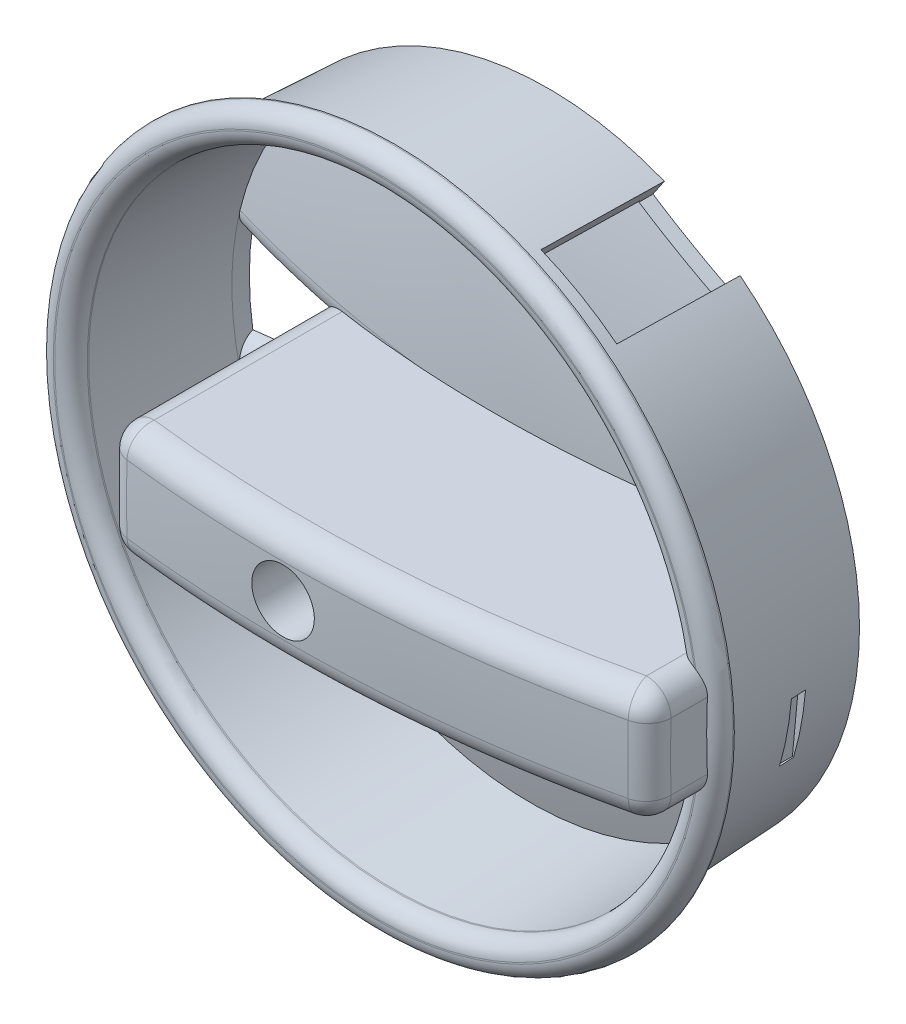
ISO-10303-21;
HEADER;
FILE_DESCRIPTION(('STEP AP214'),'2;1');
FILE_NAME('part.step','',(''),(''),'','','');
FILE_SCHEMA(('AUTOMOTIVE_DESIGN { 1 0 10303 214 1 1 1 1 }'));
ENDSEC;
DATA;
#1=APPLICATION_CONTEXT('core data for automotive mechanical design processes');
#2=APPLICATION_PROTOCOL_DEFINITION('international standard','automotive_design',2000,#1);
#3=PRODUCT_CONTEXT('',#1,'mechanical');
#4=PRODUCT('Part','Part','',(#3));
#5=PRODUCT_RELATED_PRODUCT_CATEGORY('part','',(#4));
#6=PRODUCT_DEFINITION_FORMATION('','',#4);
#7=PRODUCT_DEFINITION_CONTEXT('part definition',#1,'design');
#8=PRODUCT_DEFINITION('design','',#6,#7);
#9=PRODUCT_DEFINITION_SHAPE('','',#8);
#10=(LENGTH_UNIT() NAMED_UNIT(*) SI_UNIT(.MILLI.,.METRE.));
#11=(NAMED_UNIT(*) PLANE_ANGLE_UNIT() SI_UNIT($,.RADIAN.));
#12=(NAMED_UNIT(*) SI_UNIT($,.STERADIAN.) SOLID_ANGLE_UNIT());
#13=UNCERTAINTY_MEASURE_WITH_UNIT(LENGTH_MEASURE(1.E-05),#10,'distance_accuracy_value','');
#14=(GEOMETRIC_REPRESENTATION_CONTEXT(3) GLOBAL_UNCERTAINTY_ASSIGNED_CONTEXT((#13)) GLOBAL_UNIT_ASSIGNED_CONTEXT((#10,
#11,#12)) REPRESENTATION_CONTEXT('',''));
#15=CARTESIAN_POINT('',(0.,0.,0.));
#16=DIRECTION('',(0.,0.,1.));
#17=DIRECTION('',(1.,0.,0.));
#18=AXIS2_PLACEMENT_3D('',#15,#16,#17);
#19=CARTESIAN_POINT('',(0.,0.,0.));
#20=DIRECTION('',(0.,0.,1.));
#21=DIRECTION('',(1.,0.,0.));
#22=AXIS2_PLACEMENT_3D('',#19,#20,#21);
#23=CONICAL_SURFACE('',#22,29.845,0.05235987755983);
#24=CARTESIAN_POINT('',(0.,0.,-2.51459999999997));
#25=DIRECTION('',(0.,0.,-1.));
#26=DIRECTION('',(0.,1.,0.));
#27=AXIS2_PLACEMENT_3D('',#24,#25,#26);
#28=CIRCLE('',#27,29.7132153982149);
#29=CARTESIAN_POINT('',(18.2567542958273,23.4428260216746,-2.51459999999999));
#30=VERTEX_POINT('',#29);
#31=CARTESIAN_POINT('',(11.1737057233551,27.5322260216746,-2.51459999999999));
#32=VERTEX_POINT('',#31);
#33=EDGE_CURVE('E1286',#30,#32,#28,.F.);
#34=ORIENTED_EDGE('',*,*,#33,.T.);
#35=CARTESIAN_POINT('',(11.1737110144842,27.532235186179,-2.51439999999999));
#36=CARTESIAN_POINT('',(11.1215194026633,27.4418366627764,-4.48720114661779));
#37=CARTESIAN_POINT('',(11.0693223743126,27.3514287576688,-6.46000171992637));
#38=CARTESIAN_POINT('',(10.9649174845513,27.1705941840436,-10.4056017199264));
#39=CARTESIAN_POINT('',(10.9127096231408,27.080167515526,-12.3784011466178));
#40=CARTESIAN_POINT('',(10.8604963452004,26.9897314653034,-14.3512));
#41=B_SPLINE_CURVE_WITH_KNOTS('',3,(#35,#36,#37,#38,#39,#40),.UNSPECIFIED.,.F.,.F.,(4,2,4),(0.,
5.92668220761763,11.853364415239),.UNSPECIFIED.);
#42=CARTESIAN_POINT('',(10.8605016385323,26.9897406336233,-14.351));
#43=VERTEX_POINT('',#42);
#44=EDGE_CURVE('E547',#32,#43,#41,.T.);
#45=ORIENTED_EDGE('',*,*,#44,.T.);
#46=CARTESIAN_POINT('',(0.,0.,-14.351));
#47=DIRECTION('',(0.,0.,1.));
#48=DIRECTION('',(1.,0.,0.));
#49=AXIS2_PLACEMENT_3D('',#46,#47,#48);
#50=CIRCLE('',#49,29.0928959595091);
#51=CARTESIAN_POINT('',(-28.5822392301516,5.42698773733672,-14.351));
#52=VERTEX_POINT('',#51);
#53=EDGE_CURVE('E1420',#43,#52,#50,.T.);
#54=ORIENTED_EDGE('',*,*,#53,.T.);
#55=CARTESIAN_POINT('',(-28.5822392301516,-5.42698773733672,-14.351));
#56=VERTEX_POINT('',#55);
#57=EDGE_CURVE('E1421',#52,#56,#50,.T.);
#58=ORIENTED_EDGE('',*,*,#57,.T.);
#59=CARTESIAN_POINT('',(17.9435502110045,22.9003406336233,-14.351));
#60=VERTEX_POINT('',#59);
#61=EDGE_CURVE('E1425',#56,#60,#50,.T.);
#62=ORIENTED_EDGE('',*,*,#61,.T.);
#63=CARTESIAN_POINT('',(17.9435449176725,22.9003314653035,-14.3512));
#64=CARTESIAN_POINT('',(17.995758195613,22.9907675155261,-12.3784011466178));
#65=CARTESIAN_POINT('',(18.0479660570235,23.0811941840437,-10.4056017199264));
#66=CARTESIAN_POINT('',(18.1523709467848,23.2620287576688,-6.46000171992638));
#67=CARTESIAN_POINT('',(18.2045679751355,23.3524366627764,-4.48720114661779));
#68=CARTESIAN_POINT('',(18.2567595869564,23.442835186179,-2.5144));
#69=B_SPLINE_CURVE_WITH_KNOTS('',3,(#63,#64,#65,#66,#67,#68),.UNSPECIFIED.,.F.,.F.,(4,2,4),(0.,
5.9266822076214,11.853364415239),.UNSPECIFIED.);
#70=EDGE_CURVE('E539',#60,#30,#69,.T.);
#71=ORIENTED_EDGE('',*,*,#70,.T.);
#72=EDGE_LOOP('',(#34,#45,#54,#58,#62,#71));
#73=FACE_BOUND('',#72,.T.);
#74=CARTESIAN_POINT('',(0.,0.,0.));
#75=DIRECTION('',(0.,0.,1.));
#76=DIRECTION('',(1.,0.,0.));
#77=AXIS2_PLACEMENT_3D('',#74,#75,#76);
#78=CIRCLE('',#77,29.845);
#79=CARTESIAN_POINT('',(29.845,0.,0.));
#80=VERTEX_POINT('',#79);
#81=EDGE_CURVE('E1416',#80,#80,#78,.T.);
#82=ORIENTED_EDGE('',*,*,#81,.F.);
#83=EDGE_LOOP('',(#82));
#84=FACE_BOUND('',#83,.T.);
#85=CARTESIAN_POINT('',(0.,0.,-7.73429999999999));
#86=DIRECTION('',(0.,0.,-1.));
#87=DIRECTION('',(-1.,0.,0.));
#88=AXIS2_PLACEMENT_3D('',#85,#86,#87);
#89=CIRCLE('',#88,29.4396625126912);
#90=CARTESIAN_POINT('',(28.2292723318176,-8.35475388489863,-7.73429999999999));
#91=VERTEX_POINT('',#90);
#92=CARTESIAN_POINT('',(29.3467741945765,-2.33678694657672,-7.73429999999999));
#93=VERTEX_POINT('',#92);
#94=EDGE_CURVE('E560',#91,#93,#89,.F.);
#95=ORIENTED_EDGE('',*,*,#94,.T.);
#96=CARTESIAN_POINT('',(29.3467846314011,-2.33678792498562,-7.7341));
#97=CARTESIAN_POINT('',(29.3346309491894,-2.33564856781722,-7.96700000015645));
#98=CARTESIAN_POINT('',(29.3224772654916,-2.33450921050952,-8.19990000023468));
#99=CARTESIAN_POINT('',(29.2981698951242,-2.3322304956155,-8.66570000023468));
#100=CARTESIAN_POINT('',(29.2860162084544,-2.33109113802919,-8.89860000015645));
#101=CARTESIAN_POINT('',(29.2738625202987,-2.32995178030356,-9.1315));
#102=B_SPLINE_CURVE_WITH_KNOTS('',3,(#96,#97,#98,#99,#100,#101),.UNSPECIFIED.,.F.,.F.,(4,2,4),
(0.,0.699659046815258,1.39931809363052),.UNSPECIFIED.);
#103=CARTESIAN_POINT('',(29.2738729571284,-2.32995275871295,-9.13129999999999));
#104=VERTEX_POINT('',#103);
#105=EDGE_CURVE('E45',#93,#104,#102,.T.);
#106=ORIENTED_EDGE('',*,*,#105,.T.);
#107=CARTESIAN_POINT('',(0.,0.,-9.13129999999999));
#108=DIRECTION('',(0.,0.,1.));
#109=DIRECTION('',(0.,-1.,0.));
#110=AXIS2_PLACEMENT_3D('',#107,#108,#109);
#111=CIRCLE('',#110,29.3664488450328);
#112=CARTESIAN_POINT('',(28.1549771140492,-8.34778901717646,-9.1313));
#113=VERTEX_POINT('',#112);
#114=EDGE_CURVE('E79',#104,#113,#111,.F.);
#115=ORIENTED_EDGE('',*,*,#114,.T.);
#116=CARTESIAN_POINT('',(28.1549664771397,-8.34778802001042,-9.1315));
#117=CARTESIAN_POINT('',(28.1673531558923,-8.34894921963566,-8.89860003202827));
#118=CARTESIAN_POINT('',(28.1797395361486,-8.3501103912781,-8.66570004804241));
#119=CARTESIAN_POINT('',(28.2045116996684,-8.35243267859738,-8.19990004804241));
#120=CARTESIAN_POINT('',(28.2168974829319,-8.35359379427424,-7.96700003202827));
#121=CARTESIAN_POINT('',(28.2292829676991,-8.35475488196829,-7.7341));
#122=B_SPLINE_CURVE_WITH_KNOTS('',3,(#116,#117,#118,#119,#120,#121),.UNSPECIFIED.,.F.,.F.,(4,2,
4),(0.,0.699696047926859,1.39939209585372),.UNSPECIFIED.);
#123=EDGE_CURVE('E553',#113,#91,#122,.T.);
#124=ORIENTED_EDGE('',*,*,#123,.T.);
#125=EDGE_LOOP('',(#95,#106,#115,#124));
#126=FACE_BOUND('',#125,.T.);
#127=ADVANCED_FACE('F65',(#73,#84,#126),#23,.T.);
#128=CARTESIAN_POINT('',(0.,0.,-119.173327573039));
#129=DIRECTION('',(0.,0.,1.));
#130=DIRECTION('',(1.,0.,0.));
#131=AXIS2_PLACEMENT_3D('',#128,#129,#130);
#132=SPHERICAL_SURFACE('',#131,108.784727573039);
#133=CARTESIAN_POINT('',(-25.5602375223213,-4.34357229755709,-119.173327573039));
#134=DIRECTION('',(0.985866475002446,0.167532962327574,0.));
#135=DIRECTION('',(-0.167532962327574,0.985866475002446,0.));
#136=AXIS2_PLACEMENT_3D('',#133,#134,#135);
#137=CIRCLE('',#136,105.650009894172);
#138=CARTESIAN_POINT('',(-24.923763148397,-8.08897701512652,-13.5916462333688));
#139=VERTEX_POINT('',#138);
#140=CARTESIAN_POINT('',(-25.4053818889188,-5.2548376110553,-13.5273612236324));
#141=VERTEX_POINT('',#140);
#142=EDGE_CURVE('E471',#139,#141,#137,.F.);
#143=ORIENTED_EDGE('',*,*,#142,.F.);
#144=CARTESIAN_POINT('',(0.63647437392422,-3.74540471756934,-119.173327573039));
#145=DIRECTION('',(0.167532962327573,-0.985866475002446,0.));
#146=DIRECTION('',(0.985866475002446,0.167532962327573,0.));
#147=AXIS2_PLACEMENT_3D('',#144,#145,#146);
#148=CIRCLE('',#147,108.718369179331);
#149=CARTESIAN_POINT('',(-20.5415866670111,-7.34429299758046,-12.5983702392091));
#150=VERTEX_POINT('',#149);
#151=EDGE_CURVE('E473',#139,#150,#148,.F.);
#152=ORIENTED_EDGE('',*,*,#151,.T.);
#153=CARTESIAN_POINT('',(-21.1780610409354,-3.59888828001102,-119.173327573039));
#154=DIRECTION('',(0.985866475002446,0.167532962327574,0.));
#155=DIRECTION('',(-0.167532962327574,0.985866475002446,0.));
#156=AXIS2_PLACEMENT_3D('',#153,#154,#155);
#157=CIRCLE('',#156,106.642649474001);
#158=CARTESIAN_POINT('',(-20.9377977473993,-5.01274453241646,-12.54032156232));
#159=VERTEX_POINT('',#158);
#160=EDGE_CURVE('E459',#150,#159,#157,.F.);
#161=ORIENTED_EDGE('',*,*,#160,.T.);
#162=CARTESIAN_POINT('',(0.209537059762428,-3.8667955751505,-119.173327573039));
#163=DIRECTION('',(0.0541094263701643,-0.99853501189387,0.));
#164=DIRECTION('',(0.99853501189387,0.0541094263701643,0.));
#165=AXIS2_PLACEMENT_3D('',#162,#163,#164);
#166=CIRCLE('',#165,108.715780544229);
#167=CARTESIAN_POINT('',(-16.256,-4.75904347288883,-11.7153780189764));
#168=VERTEX_POINT('',#167);
#169=EDGE_CURVE('E1517',#168,#159,#166,.T.);
#170=ORIENTED_EDGE('',*,*,#169,.F.);
#171=CARTESIAN_POINT('',(-16.256,0.,-119.173327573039));
#172=DIRECTION('',(1.,0.,0.));
#173=DIRECTION('',(0.,0.,-1.));
#174=AXIS2_PLACEMENT_3D('',#171,#172,#173);
#175=CIRCLE('',#174,107.563280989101);
#176=CARTESIAN_POINT('',(-16.256,4.75904347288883,-11.7153780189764));
#177=VERTEX_POINT('',#176);
#178=EDGE_CURVE('E1509',#177,#168,#175,.T.);
#179=ORIENTED_EDGE('',*,*,#178,.F.);
#180=CARTESIAN_POINT('',(0.209537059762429,3.8667955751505,-119.173327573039));
#181=DIRECTION('',(0.0541094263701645,0.99853501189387,0.));
#182=DIRECTION('',(-0.99853501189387,0.0541094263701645,0.));
#183=AXIS2_PLACEMENT_3D('',#180,#181,#182);
#184=CIRCLE('',#183,108.715780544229);
#185=EDGE_CURVE('E1514',#52,#177,#184,.T.);
#186=ORIENTED_EDGE('',*,*,#185,.F.);
#187=ORIENTED_EDGE('',*,*,#53,.F.);
#188=CARTESIAN_POINT('',(-3.54152428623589,2.04469999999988,-119.173327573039));
#189=DIRECTION('',(0.866025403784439,-0.499999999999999,0.));
#190=DIRECTION('',(0.499999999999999,0.866025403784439,0.));
#191=AXIS2_PLACEMENT_3D('',#188,#189,#190);
#192=CIRCLE('',#191,108.707836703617);
#193=CARTESIAN_POINT('',(10.170827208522,25.7951894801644,-13.981695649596));
#194=VERTEX_POINT('',#193);
#195=EDGE_CURVE('E1480',#194,#43,#192,.F.);
#196=ORIENTED_EDGE('',*,*,#195,.F.);
#197=CARTESIAN_POINT('',(13.7123514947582,23.7504894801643,-119.173327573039));
#198=DIRECTION('',(-0.5,-0.866025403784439,0.));
#199=DIRECTION('',(0.866025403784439,-0.499999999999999,0.));
#200=AXIS2_PLACEMENT_3D('',#197,#198,#199);
#201=CIRCLE('',#200,105.271091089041);
#202=CARTESIAN_POINT('',(17.2538757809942,21.7057894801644,-13.981695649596));
#203=VERTEX_POINT('',#202);
#204=EDGE_CURVE('E1484',#194,#203,#201,.F.);
#205=ORIENTED_EDGE('',*,*,#204,.T.);
#206=CARTESIAN_POINT('',(3.5415242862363,-2.04470000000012,-119.173327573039));
#207=DIRECTION('',(-0.866025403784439,0.499999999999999,0.));
#208=DIRECTION('',(-0.499999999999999,-0.866025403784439,0.));
#209=AXIS2_PLACEMENT_3D('',#206,#207,#208);
#210=CIRCLE('',#209,108.707836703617);
#211=EDGE_CURVE('E1755',#60,#203,#210,.F.);
#212=ORIENTED_EDGE('',*,*,#211,.F.);
#213=ORIENTED_EDGE('',*,*,#61,.F.);
#214=EDGE_CURVE('E1491',#141,#56,#166,.T.);
#215=ORIENTED_EDGE('',*,*,#214,.F.);
#216=EDGE_LOOP('',(#143,#152,#161,#170,#179,#186,#187,#196,#205,#212,#213,#215));
#217=FACE_BOUND('',#216,.T.);
#218=CARTESIAN_POINT('',(0.,0.,-10.5545828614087));
#219=DIRECTION('',(0.,0.,-1.));
#220=DIRECTION('',(-1.,0.,0.));
#221=AXIS2_PLACEMENT_3D('',#218,#219,#220);
#222=CIRCLE('',#221,6.0071);
#223=CARTESIAN_POINT('',(-6.0071,0.,-10.5545828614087));
#224=VERTEX_POINT('',#223);
#225=EDGE_CURVE('E1360',#224,#224,#222,.T.);
#226=ORIENTED_EDGE('',*,*,#225,.F.);
#227=EDGE_LOOP('',(#226));
#228=FACE_BOUND('',#227,.T.);
#229=CARTESIAN_POINT('',(-13.1024345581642,-22.3722723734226,-119.173327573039));
#230=DIRECTION('',(0.505365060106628,0.862905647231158,0.));
#231=DIRECTION('',(-0.862905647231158,0.505365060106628,0.));
#232=AXIS2_PLACEMENT_3D('',#229,#230,#231);
#233=CIRCLE('',#232,105.650009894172);
#234=CARTESIAN_POINT('',(-9.82417024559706,-24.2922044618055,-13.5916462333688));
#235=VERTEX_POINT('',#234);
#236=CARTESIAN_POINT('',(-16.3806988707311,-20.4523402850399,-13.5916462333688));
#237=VERTEX_POINT('',#236);
#238=EDGE_CURVE('E437',#235,#237,#233,.F.);
#239=ORIENTED_EDGE('',*,*,#238,.F.);
#240=CARTESIAN_POINT('',(3.27826431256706,-1.91993208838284,-119.173327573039));
#241=DIRECTION('',(0.862905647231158,-0.505365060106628,0.));
#242=DIRECTION('',(0.505365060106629,0.862905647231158,0.));
#243=AXIS2_PLACEMENT_3D('',#240,#241,#242);
#244=CIRCLE('',#243,108.718369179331);
#245=CARTESIAN_POINT('',(-7.57782255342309,-20.456588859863,-12.5983702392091));
#246=VERTEX_POINT('',#245);
#247=EDGE_CURVE('E439',#235,#246,#244,.F.);
#248=ORIENTED_EDGE('',*,*,#247,.T.);
#249=CARTESIAN_POINT('',(-10.8560868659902,-18.5366567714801,-119.173327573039));
#250=DIRECTION('',(0.505365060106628,0.862905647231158,0.));
#251=DIRECTION('',(-0.862905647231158,0.505365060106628,0.));
#252=AXIS2_PLACEMENT_3D('',#249,#250,#251);
#253=CIRCLE('',#252,106.642649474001);
#254=CARTESIAN_POINT('',(-14.1343511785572,-16.6167246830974,-12.5983702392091));
#255=VERTEX_POINT('',#254);
#256=EDGE_CURVE('E432',#246,#255,#253,.F.);
#257=ORIENTED_EDGE('',*,*,#256,.T.);
#258=CARTESIAN_POINT('',(-3.27826431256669,1.91993208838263,-119.173327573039));
#259=DIRECTION('',(-0.862905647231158,0.505365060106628,0.));
#260=DIRECTION('',(-0.505365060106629,-0.862905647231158,0.));
#261=AXIS2_PLACEMENT_3D('',#258,#259,#260);
#262=CIRCLE('',#261,108.718369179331);
#263=EDGE_CURVE('E442',#255,#237,#262,.F.);
#264=ORIENTED_EDGE('',*,*,#263,.T.);
#265=EDGE_LOOP('',(#239,#248,#257,#264));
#266=FACE_BOUND('',#265,.T.);
#267=ADVANCED_FACE('F532',(#217,#228,#266),#132,.F.);
#268=CARTESIAN_POINT('',(0.,0.,-119.173327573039));
#269=DIRECTION('',(0.,0.,1.));
#270=DIRECTION('',(1.,0.,0.));
#271=AXIS2_PLACEMENT_3D('',#268,#269,#270);
#272=SPHERICAL_SURFACE('',#271,110.054727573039);
#273=CARTESIAN_POINT('',(0.63647437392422,-3.74540471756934,-119.173327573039));
#274=DIRECTION('',(0.167532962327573,-0.985866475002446,0.));
#275=DIRECTION('',(0.985866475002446,0.167532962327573,0.));
#276=AXIS2_PLACEMENT_3D('',#273,#274,#275);
#277=CIRCLE('',#276,109.989135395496);
#278=CARTESIAN_POINT('',(-24.923763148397,-8.08897701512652,-12.2835827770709));
#279=VERTEX_POINT('',#278);
#280=CARTESIAN_POINT('',(-20.5415866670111,-7.34429299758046,-11.3023507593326));
#281=VERTEX_POINT('',#280);
#282=EDGE_CURVE('E602',#279,#281,#277,.F.);
#283=ORIENTED_EDGE('',*,*,#282,.F.);
#284=CARTESIAN_POINT('',(-25.5602375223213,-4.34357229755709,-119.173327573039));
#285=DIRECTION('',(0.985866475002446,0.167532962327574,0.));
#286=DIRECTION('',(-0.167532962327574,0.985866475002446,0.));
#287=AXIS2_PLACEMENT_3D('',#284,#285,#286);
#288=CIRCLE('',#287,106.957237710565);
#289=CARTESIAN_POINT('',(-25.2165664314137,-6.36594331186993,-12.2357635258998));
#290=VERTEX_POINT('',#289);
#291=EDGE_CURVE('E465',#279,#290,#288,.F.);
#292=ORIENTED_EDGE('',*,*,#291,.T.);
#293=CARTESIAN_POINT('',(0.270123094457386,-4.98484987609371,-119.173327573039));
#294=DIRECTION('',(-0.0541094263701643,0.99853501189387,0.));
#295=DIRECTION('',(-0.99853501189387,-0.0541094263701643,0.));
#296=AXIS2_PLACEMENT_3D('',#293,#294,#295);
#297=CIRCLE('',#296,109.941445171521);
#298=CARTESIAN_POINT('',(-27.1463684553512,-6.47051699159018,-12.7155887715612));
#299=VERTEX_POINT('',#298);
#300=EDGE_CURVE('E1444',#290,#299,#297,.F.);
#301=ORIENTED_EDGE('',*,*,#300,.T.);
#302=CARTESIAN_POINT('',(0.,0.,-12.7155887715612));
#303=DIRECTION('',(0.,0.,-1.));
#304=DIRECTION('',(-1.,0.,0.));
#305=AXIS2_PLACEMENT_3D('',#302,#303,#304);
#306=CIRCLE('',#305,27.9068613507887);
#307=CARTESIAN_POINT('',(27.3799178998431,-5.39749999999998,-12.7155887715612));
#308=VERTEX_POINT('',#307);
#309=EDGE_CURVE('E1410',#299,#308,#306,.F.);
#310=ORIENTED_EDGE('',*,*,#309,.T.);
#311=CARTESIAN_POINT('',(0.,-5.3975,-119.173327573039));
#312=DIRECTION('',(0.,-1.,0.));
#313=DIRECTION('',(0.,0.,-1.));
#314=AXIS2_PLACEMENT_3D('',#311,#312,#313);
#315=CIRCLE('',#314,109.922290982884);
#316=CARTESIAN_POINT('',(-7.34491968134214,-5.3975,-9.49670194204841));
#317=VERTEX_POINT('',#316);
#318=EDGE_CURVE('E1390',#308,#317,#315,.T.);
#319=ORIENTED_EDGE('',*,*,#318,.T.);
#320=CARTESIAN_POINT('',(-20.7489822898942,-6.12385023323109,-11.265861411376));
#321=VERTEX_POINT('',#320);
#322=EDGE_CURVE('E1299',#317,#321,#297,.F.);
#323=ORIENTED_EDGE('',*,*,#322,.T.);
#324=CARTESIAN_POINT('',(-21.1780610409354,-3.59888828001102,-119.173327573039));
#325=DIRECTION('',(0.985866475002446,0.167532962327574,0.));
#326=DIRECTION('',(-0.167532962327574,0.985866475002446,0.));
#327=AXIS2_PLACEMENT_3D('',#324,#325,#326);
#328=CIRCLE('',#327,107.937856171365);
#329=EDGE_CURVE('E453',#281,#321,#328,.F.);
#330=ORIENTED_EDGE('',*,*,#329,.F.);
#331=EDGE_LOOP('',(#283,#292,#301,#310,#319,#323,#330));
#332=FACE_BOUND('',#331,.T.);
#333=CARTESIAN_POINT('',(3.27826431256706,-1.91993208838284,-119.173327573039));
#334=DIRECTION('',(0.862905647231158,-0.505365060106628,0.));
#335=DIRECTION('',(0.505365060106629,0.862905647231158,0.));
#336=AXIS2_PLACEMENT_3D('',#333,#334,#335);
#337=CIRCLE('',#336,109.989135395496);
#338=CARTESIAN_POINT('',(-9.82417024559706,-24.2922044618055,-12.2835827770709));
#339=VERTEX_POINT('',#338);
#340=CARTESIAN_POINT('',(-7.57782255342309,-20.456588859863,-11.3023507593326));
#341=VERTEX_POINT('',#340);
#342=EDGE_CURVE('E606',#339,#341,#337,.F.);
#343=ORIENTED_EDGE('',*,*,#342,.F.);
#344=CARTESIAN_POINT('',(-13.1024345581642,-22.3722723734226,-119.173327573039));
#345=DIRECTION('',(0.505365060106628,0.862905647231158,0.));
#346=DIRECTION('',(-0.862905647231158,0.505365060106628,0.));
#347=AXIS2_PLACEMENT_3D('',#344,#345,#346);
#348=CIRCLE('',#347,106.957237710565);
#349=CARTESIAN_POINT('',(-16.3806988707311,-20.4523402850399,-12.2835827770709));
#350=VERTEX_POINT('',#349);
#351=EDGE_CURVE('E610',#339,#350,#348,.F.);
#352=ORIENTED_EDGE('',*,*,#351,.T.);
#353=CARTESIAN_POINT('',(-3.27826431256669,1.91993208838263,-119.173327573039));
#354=DIRECTION('',(-0.862905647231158,0.505365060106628,0.));
#355=DIRECTION('',(-0.505365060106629,-0.862905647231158,0.));
#356=AXIS2_PLACEMENT_3D('',#353,#354,#355);
#357=CIRCLE('',#356,109.989135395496);
#358=CARTESIAN_POINT('',(-14.1343511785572,-16.6167246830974,-11.3023507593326));
#359=VERTEX_POINT('',#358);
#360=EDGE_CURVE('E609',#359,#350,#357,.F.);
#361=ORIENTED_EDGE('',*,*,#360,.F.);
#362=CARTESIAN_POINT('',(-10.8560868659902,-18.5366567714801,-119.173327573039));
#363=DIRECTION('',(0.505365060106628,0.862905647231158,0.));
#364=DIRECTION('',(-0.862905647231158,0.505365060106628,0.));
#365=AXIS2_PLACEMENT_3D('',#362,#363,#364);
#366=CIRCLE('',#365,107.937856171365);
#367=EDGE_CURVE('E604',#341,#359,#366,.F.);
#368=ORIENTED_EDGE('',*,*,#367,.F.);
#369=EDGE_LOOP('',(#343,#352,#361,#368));
#370=FACE_BOUND('',#369,.T.);
#371=ADVANCED_FACE('F525',(#332,#370),#272,.T.);
#372=CARTESIAN_POINT('',(0.,0.,-14.351));
#373=DIRECTION('',(0.,0.,-1.));
#374=DIRECTION('',(-1.,0.,0.));
#375=AXIS2_PLACEMENT_3D('',#372,#373,#374);
#376=PLANE('',#375);
#377=CARTESIAN_POINT('',(-27.583067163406,-4.23878712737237,-14.351));
#378=CARTESIAN_POINT('',(-27.3166479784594,-4.19939070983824,-14.351));
#379=CARTESIAN_POINT('',(-27.0496769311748,-4.16390539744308,-14.351));
#380=CARTESIAN_POINT('',(-26.5150410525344,-4.09989496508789,-14.351));
#381=CARTESIAN_POINT('',(-26.2473766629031,-4.0713661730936,-14.351));
#382=CARTESIAN_POINT('',(-25.7115053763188,-4.02036920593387,-14.351));
#383=CARTESIAN_POINT('',(-25.4432985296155,-3.99790049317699,-14.351));
#384=CARTESIAN_POINT('',(-24.9063396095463,-3.95840880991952,-14.351));
#385=CARTESIAN_POINT('',(-24.6375873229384,-3.94138872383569,-14.351));
#386=CARTESIAN_POINT('',(-24.3687146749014,-3.92679858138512,-14.351));
#387=B_SPLINE_CURVE_WITH_KNOTS('',3,(#377,#378,#379,#380,#381,#382,#383,#384,#385,#386),
.UNSPECIFIED.,.F.,.F.,(4,2,2,2,4),(0.,0.807882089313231,1.61533680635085,2.42271987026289,
3.23052964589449),.UNSPECIFIED.);
#388=CARTESIAN_POINT('',(-27.583067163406,-4.23878712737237,-14.351));
#389=VERTEX_POINT('',#388);
#390=CARTESIAN_POINT('',(-25.6163862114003,-4.01315904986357,-14.351));
#391=VERTEX_POINT('',#390);
#392=EDGE_CURVE('E1454',#389,#391,#387,.T.);
#393=ORIENTED_EDGE('',*,*,#392,.T.);
#394=DIRECTION('',(0.167532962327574,-0.985866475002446,0.));
#395=VECTOR('',#394,1.);
#396=CARTESIAN_POINT('',(-25.5602375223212,-4.34357229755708,-14.351));
#397=LINE('',#396,#395);
#398=CARTESIAN_POINT('',(-25.4053818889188,-5.2548376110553,-14.351));
#399=VERTEX_POINT('',#398);
#400=EDGE_CURVE('E462',#391,#399,#397,.T.);
#401=ORIENTED_EDGE('',*,*,#400,.T.);
#402=DIRECTION('',(-0.99853501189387,-0.0541094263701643,0.));
#403=VECTOR('',#402,1.);
#404=CARTESIAN_POINT('',(-28.6668321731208,-5.43157172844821,-14.351));
#405=LINE('',#404,#403);
#406=EDGE_CURVE('E1507',#399,#56,#405,.T.);
#407=ORIENTED_EDGE('',*,*,#406,.T.);
#408=ORIENTED_EDGE('',*,*,#57,.F.);
#409=DIRECTION('',(0.99853501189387,-0.0541094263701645,0.));
#410=VECTOR('',#409,1.);
#411=CARTESIAN_POINT('',(-16.256,4.75904347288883,-14.351));
#412=LINE('',#411,#410);
#413=CARTESIAN_POINT('',(-16.256,4.75904347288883,-14.351));
#414=VERTEX_POINT('',#413);
#415=EDGE_CURVE('E1492',#52,#414,#412,.T.);
#416=ORIENTED_EDGE('',*,*,#415,.T.);
#417=DIRECTION('',(0.,-1.,0.));
#418=VECTOR('',#417,1.);
#419=CARTESIAN_POINT('',(-16.256,-4.75904347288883,-14.351));
#420=LINE('',#419,#418);
#421=CARTESIAN_POINT('',(-16.256,-4.75904347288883,-14.351));
#422=VERTEX_POINT('',#421);
#423=EDGE_CURVE('E1488',#414,#422,#420,.T.);
#424=ORIENTED_EDGE('',*,*,#423,.T.);
#425=CARTESIAN_POINT('',(-20.9377977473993,-5.01274453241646,-14.351));
#426=VERTEX_POINT('',#425);
#427=EDGE_CURVE('E1525',#422,#426,#405,.T.);
#428=ORIENTED_EDGE('',*,*,#427,.T.);
#429=DIRECTION('',(0.167532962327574,-0.985866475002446,0.));
#430=VECTOR('',#429,1.);
#431=CARTESIAN_POINT('',(-21.1780610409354,-3.59888828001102,-14.351));
#432=LINE('',#431,#430);
#433=CARTESIAN_POINT('',(-21.1519593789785,-3.75248643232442,-14.351));
#434=VERTEX_POINT('',#433);
#435=EDGE_CURVE('E455',#434,#426,#432,.T.);
#436=ORIENTED_EDGE('',*,*,#435,.F.);
#437=DIRECTION('',(-0.99853501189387,-0.0541094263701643,0.));
#438=VECTOR('',#437,1.);
#439=CARTESIAN_POINT('',(-27.6037259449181,-4.1021,-14.351));
#440=LINE('',#439,#438);
#441=CARTESIAN_POINT('',(-17.526,-3.556,-14.351));
#442=VERTEX_POINT('',#441);
#443=EDGE_CURVE('E1493',#442,#434,#440,.T.);
#444=ORIENTED_EDGE('',*,*,#443,.F.);
#445=DIRECTION('',(0.,-1.,0.));
#446=VECTOR('',#445,1.);
#447=CARTESIAN_POINT('',(-17.526,-3.556,-14.351));
#448=LINE('',#447,#446);
#449=CARTESIAN_POINT('',(-17.526,3.556,-14.351));
#450=VERTEX_POINT('',#449);
#451=EDGE_CURVE('E1498',#450,#442,#448,.T.);
#452=ORIENTED_EDGE('',*,*,#451,.F.);
#453=DIRECTION('',(0.99853501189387,-0.0541094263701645,0.));
#454=VECTOR('',#453,1.);
#455=CARTESIAN_POINT('',(-17.526,3.556,-14.351));
#456=LINE('',#455,#454);
#457=CARTESIAN_POINT('',(-24.3687146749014,3.92679858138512,-14.351));
#458=VERTEX_POINT('',#457);
#459=EDGE_CURVE('E1502',#458,#450,#456,.T.);
#460=ORIENTED_EDGE('',*,*,#459,.F.);
#461=CARTESIAN_POINT('',(-24.3687146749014,3.92679858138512,-14.351));
#462=CARTESIAN_POINT('',(-24.6375873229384,3.94138872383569,-14.351));
#463=CARTESIAN_POINT('',(-24.9063396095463,3.95840880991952,-14.351));
#464=CARTESIAN_POINT('',(-25.4432985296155,3.99790049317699,-14.351));
#465=CARTESIAN_POINT('',(-25.7115053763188,4.02036920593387,-14.351));
#466=CARTESIAN_POINT('',(-26.2473766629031,4.0713661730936,-14.351));
#467=CARTESIAN_POINT('',(-26.5150410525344,4.09989496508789,-14.351));
#468=CARTESIAN_POINT('',(-27.0496769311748,4.16390539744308,-14.351));
#469=CARTESIAN_POINT('',(-27.3166479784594,4.19939070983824,-14.351));
#470=CARTESIAN_POINT('',(-27.583067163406,4.23878712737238,-14.351));
#471=B_SPLINE_CURVE_WITH_KNOTS('',3,(#461,#462,#463,#464,#465,#466,#467,#468,#469,#470),
.UNSPECIFIED.,.F.,.F.,(4,2,2,2,4),(0.,0.807809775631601,1.61519283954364,2.42264755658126,
3.2305296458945),.UNSPECIFIED.);
#472=CARTESIAN_POINT('',(-27.583067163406,4.23878712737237,-14.351));
#473=VERTEX_POINT('',#472);
#474=EDGE_CURVE('E1310',#458,#473,#471,.T.);
#475=ORIENTED_EDGE('',*,*,#474,.T.);
#476=CARTESIAN_POINT('',(0.,0.,-14.351));
#477=DIRECTION('',(0.,0.,-1.));
#478=DIRECTION('',(-1.,0.,0.));
#479=AXIS2_PLACEMENT_3D('',#476,#477,#478);
#480=CIRCLE('',#479,27.9068613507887);
#481=EDGE_CURVE('E1496',#389,#473,#480,.T.);
#482=ORIENTED_EDGE('',*,*,#481,.F.);
#483=EDGE_LOOP('',(#393,#401,#407,#408,#416,#424,#428,#436,#444,#452,#460,#475,#482));
#484=FACE_BOUND('',#483,.T.);
#485=ADVANCED_FACE('F694',(#484),#376,.T.);
#486=CARTESIAN_POINT('',(-28.6668321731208,-5.43157172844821,10.4074814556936));
#487=DIRECTION('',(0.0541094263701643,-0.99853501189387,0.));
#488=DIRECTION('',(0.99853501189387,0.0541094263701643,0.));
#489=AXIS2_PLACEMENT_3D('',#486,#487,#488);
#490=PLANE('',#489);
#491=ORIENTED_EDGE('',*,*,#406,.F.);
#492=DIRECTION('',(0.,0.,1.));
#493=VECTOR('',#492,1.);
#494=CARTESIAN_POINT('',(-25.4053818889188,-5.2548376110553,10.4074814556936));
#495=LINE('',#494,#493);
#496=EDGE_CURVE('E468',#399,#141,#495,.T.);
#497=ORIENTED_EDGE('',*,*,#496,.T.);
#498=ORIENTED_EDGE('',*,*,#214,.T.);
#499=EDGE_LOOP('',(#491,#497,#498));
#500=FACE_BOUND('',#499,.T.);
#501=ADVANCED_FACE('F750',(#500),#490,.T.);
#502=CARTESIAN_POINT('',(0.264512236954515,-4.88130714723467,-119.173327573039));
#503=DIRECTION('',(-0.0541094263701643,0.99853501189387,0.));
#504=DIRECTION('',(-0.99853501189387,-0.0541094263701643,0.));
#505=AXIS2_PLACEMENT_3D('',#502,#503,#504);
#506=TOROIDAL_SURFACE('',#505,107.657798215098,2.286);
#507=ORIENTED_EDGE('',*,*,#300,.F.);
#508=CARTESIAN_POINT('',(-25.1987617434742,-6.47071699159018,-12.2403239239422));
#509=CARTESIAN_POINT('',(-25.2095372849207,-6.40730711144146,-12.2360256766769));
#510=CARTESIAN_POINT('',(-25.2203429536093,-6.34371994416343,-12.2345198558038));
#511=CARTESIAN_POINT('',(-25.2419341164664,-6.21666432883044,-12.2370351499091));
#512=CARTESIAN_POINT('',(-25.252719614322,-6.15319585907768,-12.2410551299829));
#513=CARTESIAN_POINT('',(-25.2741727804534,-6.02695230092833,-12.2545487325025));
#514=CARTESIAN_POINT('',(-25.2848406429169,-5.96417606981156,-12.2640113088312));
#515=CARTESIAN_POINT('',(-25.3060024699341,-5.83964692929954,-12.2882597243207));
#516=CARTESIAN_POINT('',(-25.316496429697,-5.77789404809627,-12.3030457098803));
#517=CARTESIAN_POINT('',(-25.347602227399,-5.59484849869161,-12.3551817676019));
#518=CARTESIAN_POINT('',(-25.3678633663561,-5.47561955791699,-12.4003262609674));
#519=CARTESIAN_POINT('',(-25.4068644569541,-5.24611327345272,-12.5097870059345));
#520=CARTESIAN_POINT('',(-25.4256040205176,-5.13583821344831,-12.5741081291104));
#521=CARTESIAN_POINT('',(-25.4615255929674,-4.92445369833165,-12.7216742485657));
#522=CARTESIAN_POINT('',(-25.4786599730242,-4.82362452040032,-12.8053328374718));
#523=CARTESIAN_POINT('',(-25.5104208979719,-4.63672380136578,-12.9881864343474));
#524=CARTESIAN_POINT('',(-25.525046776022,-4.55065618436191,-13.0873855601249));
#525=CARTESIAN_POINT('',(-25.551827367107,-4.39306279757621,-13.3017445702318));
#526=CARTESIAN_POINT('',(-25.5638940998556,-4.32205475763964,-13.4172960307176));
#527=CARTESIAN_POINT('',(-25.5846599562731,-4.19985575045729,-13.6586906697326));
#528=CARTESIAN_POINT('',(-25.5933604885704,-4.14865649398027,-13.7845295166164));
#529=CARTESIAN_POINT('',(-25.6052121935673,-4.07891380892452,-14.0065636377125));
#530=CARTESIAN_POINT('',(-25.6092360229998,-4.05523513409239,-14.1011342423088));
#531=CARTESIAN_POINT('',(-25.6153614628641,-4.01918929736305,-14.2923523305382));
#532=CARTESIAN_POINT('',(-25.6174653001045,-4.00680903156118,-14.3889972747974));
#533=CARTESIAN_POINT('',(-25.6185843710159,-4.00022373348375,-14.48609552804));
#534=B_SPLINE_CURVE_WITH_KNOTS('',3,(#508,#509,#510,#511,#512,#513,#514,#515,#516,#517,#518,
#519,#520,#521,#522,#523,#524,#525,#526,#527,#528,#529,#530,#531,#532,#533),.UNSPECIFIED.,.F.,
.F.,(4,2,2,2,2,2,2,2,2,2,2,2,4),(0.,0.193316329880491,0.386592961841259,0.579478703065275,
0.772369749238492,1.15770040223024,1.54312902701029,1.93772207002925,2.33241984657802,
2.73903887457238,3.14548756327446,3.43754480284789,3.72926288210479),.UNSPECIFIED.);
#535=EDGE_CURVE('E596',#290,#391,#534,.T.);
#536=ORIENTED_EDGE('',*,*,#535,.T.);
#537=ORIENTED_EDGE('',*,*,#392,.F.);
#538=CARTESIAN_POINT('',(-27.1463684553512,-6.47051699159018,-12.7155887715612));
#539=CARTESIAN_POINT('',(-27.1618239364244,-6.40568111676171,-12.7155895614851));
#540=CARTESIAN_POINT('',(-27.177035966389,-6.340823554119,-12.7184527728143));
#541=CARTESIAN_POINT('',(-27.2068878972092,-6.21148567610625,-12.7298320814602));
#542=CARTESIAN_POINT('',(-27.2215279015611,-6.14700529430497,-12.7383471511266));
#543=CARTESIAN_POINT('',(-27.264403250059,-5.95502581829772,-12.7722107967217));
#544=CARTESIAN_POINT('',(-27.2916671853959,-5.8286804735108,-12.8058785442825));
#545=CARTESIAN_POINT('',(-27.3429890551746,-5.58297932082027,-12.8941816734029));
#546=CARTESIAN_POINT('',(-27.3670476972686,-5.46362197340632,-12.9488124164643));
#547=CARTESIAN_POINT('',(-27.4116912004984,-5.23504180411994,-13.077351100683));
#548=CARTESIAN_POINT('',(-27.4322755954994,-5.12582034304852,-13.1512616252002));
#549=CARTESIAN_POINT('',(-27.4701888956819,-4.91863280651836,-13.3177006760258));
#550=CARTESIAN_POINT('',(-27.4874520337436,-4.82090661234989,-13.4105423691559));
#551=CARTESIAN_POINT('',(-27.5182755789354,-4.64173422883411,-13.6113267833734));
#552=CARTESIAN_POINT('',(-27.5318366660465,-4.56028505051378,-13.7192667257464));
#553=CARTESIAN_POINT('',(-27.5519660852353,-4.43675585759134,-13.9142516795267));
#554=CARTESIAN_POINT('',(-27.5594232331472,-4.39009588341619,-13.9983470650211));
#555=CARTESIAN_POINT('',(-27.5725586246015,-4.30681267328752,-14.171332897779));
#556=CARTESIAN_POINT('',(-27.5782397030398,-4.27017345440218,-14.2602154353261));
#557=CARTESIAN_POINT('',(-27.583067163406,-4.23878712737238,-14.351));
#558=B_SPLINE_CURVE_WITH_KNOTS('',3,(#538,#539,#540,#541,#542,#543,#544,#545,#546,#547,#548,
#549,#550,#551,#552,#553,#554,#555,#556,#557),.UNSPECIFIED.,.F.,.F.,(4,2,2,2,2,2,2,2,2,4),(0.,
0.19982762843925,0.39961893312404,0.798264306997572,1.19682152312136,1.59543217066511,
2.0012675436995,2.40702832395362,2.69578862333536,2.98408563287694),.UNSPECIFIED.);
#559=EDGE_CURVE('E1276',#299,#389,#558,.T.);
#560=ORIENTED_EDGE('',*,*,#559,.F.);
#561=EDGE_LOOP('',(#507,#536,#537,#560));
#562=FACE_BOUND('',#561,.T.);
#563=ADVANCED_FACE('F523',(#562),#506,.T.);
#564=CARTESIAN_POINT('',(13.7123514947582,23.7504894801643,-119.173327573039));
#565=DIRECTION('',(-0.5,-0.866025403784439,0.));
#566=DIRECTION('',(0.866025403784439,-0.499999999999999,0.));
#567=AXIS2_PLACEMENT_3D('',#564,#565,#566);
#568=CIRCLE('',#567,106.582966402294);
#569=CARTESIAN_POINT('',(10.170827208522,25.7951894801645,-12.6688415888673));
#570=VERTEX_POINT('',#569);
#571=CARTESIAN_POINT('',(17.2538757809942,21.7057894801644,-12.6688415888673));
#572=VERTEX_POINT('',#571);
#573=EDGE_CURVE('E1769',#570,#572,#568,.F.);
#574=ORIENTED_EDGE('',*,*,#573,.F.);
#575=CARTESIAN_POINT('',(-3.54152428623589,2.04469999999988,-119.173327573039));
#576=DIRECTION('',(0.866025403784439,-0.499999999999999,0.));
#577=DIRECTION('',(0.499999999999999,0.866025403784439,0.));
#578=AXIS2_PLACEMENT_3D('',#575,#576,#577);
#579=CIRCLE('',#578,109.978724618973);
#580=CARTESIAN_POINT('',(10.2612808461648,25.9518597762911,-12.7155887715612));
#581=VERTEX_POINT('',#580);
#582=EDGE_CURVE('E1479',#570,#581,#579,.F.);
#583=ORIENTED_EDGE('',*,*,#582,.T.);
#584=CARTESIAN_POINT('',(-27.1463684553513,6.47051699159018,-12.7155887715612));
#585=VERTEX_POINT('',#584);
#586=EDGE_CURVE('E1417',#581,#585,#306,.F.);
#587=ORIENTED_EDGE('',*,*,#586,.T.);
#588=CARTESIAN_POINT('',(0.270123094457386,4.98484987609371,-119.173327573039));
#589=DIRECTION('',(-0.0541094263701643,-0.99853501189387,0.));
#590=DIRECTION('',(0.99853501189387,-0.0541094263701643,0.));
#591=AXIS2_PLACEMENT_3D('',#588,#589,#590);
#592=CIRCLE('',#591,109.941445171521);
#593=CARTESIAN_POINT('',(-7.34491968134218,5.3975,-9.49670194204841));
#594=VERTEX_POINT('',#593);
#595=EDGE_CURVE('E1448',#585,#594,#592,.F.);
#596=ORIENTED_EDGE('',*,*,#595,.T.);
#597=CARTESIAN_POINT('',(0.,5.3975,-119.173327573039));
#598=DIRECTION('',(0.,1.,0.));
#599=DIRECTION('',(0.,0.,1.));
#600=AXIS2_PLACEMENT_3D('',#597,#598,#599);
#601=CIRCLE('',#600,109.922290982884);
#602=CARTESIAN_POINT('',(27.3799178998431,5.39749999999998,-12.7155887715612));
#603=VERTEX_POINT('',#602);
#604=EDGE_CURVE('E1389',#594,#603,#601,.T.);
#605=ORIENTED_EDGE('',*,*,#604,.T.);
#606=CARTESIAN_POINT('',(17.344329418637,21.8624597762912,-12.7155887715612));
#607=VERTEX_POINT('',#606);
#608=EDGE_CURVE('E1413',#603,#607,#306,.F.);
#609=ORIENTED_EDGE('',*,*,#608,.T.);
#610=CARTESIAN_POINT('',(3.5415242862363,-2.04470000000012,-119.173327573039));
#611=DIRECTION('',(-0.866025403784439,0.499999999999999,0.));
#612=DIRECTION('',(-0.499999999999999,-0.866025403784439,0.));
#613=AXIS2_PLACEMENT_3D('',#610,#611,#612);
#614=CIRCLE('',#613,109.978724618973);
#615=EDGE_CURVE('E1762',#607,#572,#614,.F.);
#616=ORIENTED_EDGE('',*,*,#615,.T.);
#617=EDGE_LOOP('',(#574,#583,#587,#596,#605,#609,#616));
#618=FACE_BOUND('',#617,.T.);
#619=CARTESIAN_POINT('',(0.,16.8496406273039,-119.173327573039));
#620=DIRECTION('',(0.,-1.,0.));
#621=DIRECTION('',(1.,0.,0.));
#622=AXIS2_PLACEMENT_3D('',#619,#620,#621);
#623=CIRCLE('',#622,108.757218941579);
#624=CARTESIAN_POINT('',(-1.85462514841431,16.8496406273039,-10.4319231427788));
#625=VERTEX_POINT('',#624);
#626=CARTESIAN_POINT('',(1.8546251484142,16.8496406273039,-10.4319231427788));
#627=VERTEX_POINT('',#626);
#628=EDGE_CURVE('E512',#625,#627,#623,.F.);
#629=ORIENTED_EDGE('',*,*,#628,.F.);
#630=CARTESIAN_POINT('',(-1.85462514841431,16.8496406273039,-10.4319231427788));
#631=CARTESIAN_POINT('',(-1.83419253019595,16.9346217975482,-10.4447426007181));
#632=CARTESIAN_POINT('',(-1.81314152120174,17.0194462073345,-10.4576348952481));
#633=CARTESIAN_POINT('',(-1.76960600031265,17.1888962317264,-10.4835799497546));
#634=CARTESIAN_POINT('',(-1.74711855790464,17.2735210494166,-10.4966329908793));
#635=CARTESIAN_POINT('',(-1.7005709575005,17.442427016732,-10.522875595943));
#636=CARTESIAN_POINT('',(-1.67650897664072,17.5267076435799,-10.5360653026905));
#637=CARTESIAN_POINT('',(-1.6266352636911,17.6947688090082,-10.5625539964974));
#638=CARTESIAN_POINT('',(-1.60082288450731,17.7785491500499,-10.5758530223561));
#639=CARTESIAN_POINT('',(-1.54775769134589,17.9438009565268,-10.6022675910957));
#640=CARTESIAN_POINT('',(-1.52054384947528,18.0252851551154,-10.6153815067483));
#641=CARTESIAN_POINT('',(-1.46395855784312,18.1874557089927,-10.6416553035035));
#642=CARTESIAN_POINT('',(-1.43458806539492,18.2681424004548,-10.6548151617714));
#643=CARTESIAN_POINT('',(-1.37334665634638,18.428523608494,-10.6811433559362));
#644=CARTESIAN_POINT('',(-1.34147680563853,18.5082185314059,-10.6943116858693));
#645=CARTESIAN_POINT('',(-1.27477668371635,18.6663869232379,-10.7206118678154));
#646=CARTESIAN_POINT('',(-1.23994613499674,18.7448602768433,-10.7337437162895));
#647=CARTESIAN_POINT('',(-1.18038947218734,18.871187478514,-10.7550127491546));
#648=CARTESIAN_POINT('',(-1.15674090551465,18.9195434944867,-10.7631857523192));
#649=CARTESIAN_POINT('',(-1.10786455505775,19.01544454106,-10.7794553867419));
#650=CARTESIAN_POINT('',(-1.0826373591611,19.0629898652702,-10.7875520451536));
#651=CARTESIAN_POINT('',(-1.03038930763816,19.1570533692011,-10.8036287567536));
#652=CARTESIAN_POINT('',(-1.0033700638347,19.2035724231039,-10.8116089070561));
#653=CARTESIAN_POINT('',(-0.946981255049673,19.2957716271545,-10.8274808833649));
#654=CARTESIAN_POINT('',(-0.917592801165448,19.3414405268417,-10.8353712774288));
#655=CARTESIAN_POINT('',(-0.85628396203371,19.4311623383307,-10.8509255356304));
#656=CARTESIAN_POINT('',(-0.824361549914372,19.4752139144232,-10.8585892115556));
#657=CARTESIAN_POINT('',(-0.774192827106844,19.5396893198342,-10.8698419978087));
#658=CARTESIAN_POINT('',(-0.757053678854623,19.560953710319,-10.8735594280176));
#659=CARTESIAN_POINT('',(-0.721951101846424,19.6028210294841,-10.8808900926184));
#660=CARTESIAN_POINT('',(-0.703987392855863,19.6234237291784,-10.8845032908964));
#661=CARTESIAN_POINT('',(-0.685577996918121,19.6436406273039,-10.8880542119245));
#662=B_SPLINE_CURVE_WITH_KNOTS('',3,(#630,#631,#632,#633,#634,#635,#636,#637,#638,#639,#640,
#641,#642,#643,#644,#645,#646,#647,#648,#649,#650,#651,#652,#653,#654,#655,#656,#657,#658,#659,
#660,#661),.UNSPECIFIED.,.F.,.F.,(4,2,2,2,2,2,2,2,2,2,2,2,2,2,2,4),(0.,0.265016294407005,
0.530591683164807,0.796480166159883,1.06246748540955,1.32315244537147,1.58372238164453,
1.8441817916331,2.10466564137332,2.26797979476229,2.43123348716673,2.59434228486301,
2.75891246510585,2.92361563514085,3.00628776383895,3.08898820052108),.UNSPECIFIED.);
#663=CARTESIAN_POINT('',(-0.685577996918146,19.6436406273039,-10.8880542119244));
#664=VERTEX_POINT('',#663);
#665=EDGE_CURVE('E504',#625,#664,#662,.T.);
#666=ORIENTED_EDGE('',*,*,#665,.T.);
#667=CARTESIAN_POINT('',(0.,19.6436406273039,-119.173327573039));
#668=DIRECTION('',(0.,-1.,0.));
#669=DIRECTION('',(1.,0.,0.));
#670=AXIS2_PLACEMENT_3D('',#667,#668,#669);
#671=CIRCLE('',#670,108.287443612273);
#672=CARTESIAN_POINT('',(0.685577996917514,19.6436406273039,-10.8880542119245));
#673=VERTEX_POINT('',#672);
#674=EDGE_CURVE('E1778',#664,#673,#671,.F.);
#675=ORIENTED_EDGE('',*,*,#674,.T.);
#676=CARTESIAN_POINT('',(0.685577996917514,19.6436406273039,-10.8880542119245));
#677=CARTESIAN_POINT('',(0.70877943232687,19.6181555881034,-10.8835779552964));
#678=CARTESIAN_POINT('',(0.731274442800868,19.5920644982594,-10.8790040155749));
#679=CARTESIAN_POINT('',(0.774979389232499,19.5388779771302,-10.8696991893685));
#680=CARTESIAN_POINT('',(0.796190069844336,19.5117831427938,-10.8649683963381));
#681=CARTESIAN_POINT('',(0.857902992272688,19.4295560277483,-10.850642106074));
#682=CARTESIAN_POINT('',(0.896733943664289,19.3732012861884,-10.8408635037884));
#683=CARTESIAN_POINT('',(0.970708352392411,19.2582903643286,-10.8210142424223));
#684=CARTESIAN_POINT('',(1.00585547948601,19.1997364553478,-10.8109438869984));
#685=CARTESIAN_POINT('',(1.07281206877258,19.0815520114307,-10.7907128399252));
#686=CARTESIAN_POINT('',(1.10465094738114,19.0219377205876,-10.7805540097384));
#687=CARTESIAN_POINT('',(1.16588223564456,18.901400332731,-10.7601110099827));
#688=CARTESIAN_POINT('',(1.19527157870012,18.8404757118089,-10.7498267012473));
#689=CARTESIAN_POINT('',(1.25193312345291,18.7176291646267,-10.7291909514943));
#690=CARTESIAN_POINT('',(1.27920427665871,18.655706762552,-10.7188394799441));
#691=CARTESIAN_POINT('',(1.34485395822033,18.5004589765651,-10.693016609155));
#692=CARTESIAN_POINT('',(1.38210315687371,18.4066589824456,-10.677529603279));
#693=CARTESIAN_POINT('',(1.4532001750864,18.2178273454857,-10.6465914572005));
#694=CARTESIAN_POINT('',(1.48704929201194,18.1227961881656,-10.6311403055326));
#695=CARTESIAN_POINT('',(1.55189242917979,17.9317459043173,-10.6003217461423));
#696=CARTESIAN_POINT('',(1.58288619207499,17.8357266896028,-10.5849543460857));
#697=CARTESIAN_POINT('',(1.64288062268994,17.6414163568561,-10.5541065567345));
#698=CARTESIAN_POINT('',(1.67184285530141,17.5431131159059,-10.5386281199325));
#699=CARTESIAN_POINT('',(1.72756360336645,17.3458806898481,-10.5078328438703));
#700=CARTESIAN_POINT('',(1.75432249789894,17.2469516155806,-10.4925159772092));
#701=CARTESIAN_POINT('',(1.80587652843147,17.048632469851,-10.4620736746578));
#702=CARTESIAN_POINT('',(1.83067309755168,16.949242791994,-10.4469481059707));
#703=CARTESIAN_POINT('',(1.85462514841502,16.8496406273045,-10.4319231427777));
#704=B_SPLINE_CURVE_WITH_KNOTS('',3,(#676,#677,#678,#679,#680,#681,#682,#683,#684,#685,#686,
#687,#688,#689,#690,#691,#692,#693,#694,#695,#696,#697,#698,#699,#700,#701,#702,#703),
.UNSPECIFIED.,.F.,.F.,(4,2,2,2,2,2,2,2,2,2,2,2,2,4),(0.,0.104226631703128,0.208392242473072,
0.415596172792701,0.622591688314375,0.827552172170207,1.03276551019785,1.23807978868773,
1.54431454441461,1.85043200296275,2.15657702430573,2.46747722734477,2.77832382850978,
3.08894127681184),.UNSPECIFIED.);
#705=EDGE_CURVE('E496',#673,#627,#704,.T.);
#706=ORIENTED_EDGE('',*,*,#705,.T.);
#707=EDGE_LOOP('',(#629,#666,#675,#706));
#708=FACE_BOUND('',#707,.T.);
#709=ADVANCED_FACE('F518',(#618,#708),#272,.T.);
#710=CARTESIAN_POINT('',(0.,0.,0.0664666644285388));
#711=DIRECTION('',(0.,0.,1.));
#712=DIRECTION('',(1.,0.,0.));
#713=AXIS2_PLACEMENT_3D('',#710,#711,#712);
#714=CONICAL_SURFACE('',#713,28.5767404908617,0.05235987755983);
#715=CARTESIAN_POINT('',(10.5314530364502,26.4198117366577,-2.51439999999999));
#716=CARTESIAN_POINT('',(10.4864326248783,26.3418340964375,-4.21463243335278));
#717=CARTESIAN_POINT('',(10.4414076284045,26.2638485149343,-5.91486438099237));
#718=CARTESIAN_POINT('',(10.3513484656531,26.1078614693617,-9.31532730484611));
#719=CARTESIAN_POINT('',(10.3063142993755,26.0298600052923,-11.0155582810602));
#720=CARTESIAN_POINT('',(10.2612755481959,25.9518505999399,-12.7157887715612));
#721=B_SPLINE_CURVE_WITH_KNOTS('',3,(#715,#716,#717,#718,#719,#720),.UNSPECIFIED.,.F.,.F.,(4,2,
4),(0.,5.10784485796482,10.2156897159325),.UNSPECIFIED.);
#722=CARTESIAN_POINT('',(10.5314477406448,26.4198025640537,-2.51459999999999));
#723=VERTEX_POINT('',#722);
#724=EDGE_CURVE('E1473',#723,#581,#721,.T.);
#725=ORIENTED_EDGE('',*,*,#724,.F.);
#726=CARTESIAN_POINT('',(0.,0.,-2.51459999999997));
#727=DIRECTION('',(0.,0.,-1.));
#728=DIRECTION('',(0.,1.,0.));
#729=AXIS2_PLACEMENT_3D('',#726,#727,#728);
#730=CIRCLE('',#729,28.4414725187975);
#731=CARTESIAN_POINT('',(17.614496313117,22.3304025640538,-2.51459999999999));
#732=VERTEX_POINT('',#731);
#733=EDGE_CURVE('E1738',#732,#723,#730,.F.);
#734=ORIENTED_EDGE('',*,*,#733,.F.);
#735=CARTESIAN_POINT('',(17.3443241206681,21.8624505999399,-12.7157887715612));
#736=CARTESIAN_POINT('',(17.3893628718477,21.9404600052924,-11.0155582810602));
#737=CARTESIAN_POINT('',(17.4343970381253,22.0184614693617,-9.31532730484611));
#738=CARTESIAN_POINT('',(17.5244562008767,22.1744485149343,-5.91486438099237));
#739=CARTESIAN_POINT('',(17.5694811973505,22.2524340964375,-4.21463243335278));
#740=CARTESIAN_POINT('',(17.6145016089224,22.3304117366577,-2.51439999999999));
#741=B_SPLINE_CURVE_WITH_KNOTS('',3,(#735,#736,#737,#738,#739,#740),.UNSPECIFIED.,.F.,.F.,(4,2,
4),(0.,5.10784485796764,10.2156897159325),.UNSPECIFIED.);
#742=EDGE_CURVE('E1757',#607,#732,#741,.T.);
#743=ORIENTED_EDGE('',*,*,#742,.F.);
#744=ORIENTED_EDGE('',*,*,#608,.F.);
#745=CARTESIAN_POINT('',(24.8391836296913,5.3975,-60.1896305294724));
#746=CARTESIAN_POINT('',(25.3179925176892,5.3975,-51.2616374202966));
#747=CARTESIAN_POINT('',(25.7961924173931,5.3975,-42.333611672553));
#748=CARTESIAN_POINT('',(26.7515370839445,5.3975,-24.4775038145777));
#749=CARTESIAN_POINT('',(27.2286818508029,5.3975,-15.5494217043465));
#750=CARTESIAN_POINT('',(28.1820791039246,5.3975,2.30679012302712));
#751=CARTESIAN_POINT('',(28.6583315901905,5.3975,11.2349198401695));
#752=CARTESIAN_POINT('',(29.6100631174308,5.3975,29.0912205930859));
#753=CARTESIAN_POINT('',(30.0855421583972,5.3975,38.0193916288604));
#754=CARTESIAN_POINT('',(30.5606938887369,5.3975,46.9475800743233));
#755=B_SPLINE_CURVE_WITH_KNOTS('',3,(#745,#746,#747,#748,#749,#750,#751,#752,#753,#754),
.UNSPECIFIED.,.F.,.F.,(4,2,2,2,4),(0.,26.8224694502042,53.6449386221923,80.4674077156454,
107.289877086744),.UNSPECIFIED.);
#756=CARTESIAN_POINT('',(28.0588313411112,5.3975,0.));
#757=VERTEX_POINT('',#756);
#758=EDGE_CURVE('E1393',#603,#757,#755,.T.);
#759=ORIENTED_EDGE('',*,*,#758,.T.);
#760=CARTESIAN_POINT('',(0.,0.,0.));
#761=DIRECTION('',(0.,0.,1.));
#762=DIRECTION('',(1.,0.,0.));
#763=AXIS2_PLACEMENT_3D('',#760,#761,#762);
#764=CIRCLE('',#763,28.5732571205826);
#765=CARTESIAN_POINT('',(28.0588313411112,-5.3975,0.));
#766=VERTEX_POINT('',#765);
#767=EDGE_CURVE('E1404',#757,#766,#764,.T.);
#768=ORIENTED_EDGE('',*,*,#767,.T.);
#769=CARTESIAN_POINT('',(30.5606938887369,-5.3975,46.9475800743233));
#770=CARTESIAN_POINT('',(30.0855421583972,-5.3975,38.0193916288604));
#771=CARTESIAN_POINT('',(29.6100631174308,-5.3975,29.0912205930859));
#772=CARTESIAN_POINT('',(28.6583315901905,-5.3975,11.2349198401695));
#773=CARTESIAN_POINT('',(28.1820791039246,-5.3975,2.30679012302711));
#774=CARTESIAN_POINT('',(27.2286818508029,-5.3975,-15.5494217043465));
#775=CARTESIAN_POINT('',(26.7515370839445,-5.3975,-24.4775038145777));
#776=CARTESIAN_POINT('',(25.7961924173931,-5.3975,-42.333611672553));
#777=CARTESIAN_POINT('',(25.3179925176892,-5.3975,-51.2616374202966));
#778=CARTESIAN_POINT('',(24.8391836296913,-5.3975,-60.1896305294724));
#779=B_SPLINE_CURVE_WITH_KNOTS('',3,(#769,#770,#771,#772,#773,#774,#775,#776,#777,#778),
.UNSPECIFIED.,.F.,.F.,(4,2,2,2,4),(0.,26.8224693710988,53.6449384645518,80.4674076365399,
107.289877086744),.UNSPECIFIED.);
#780=EDGE_CURVE('E1263',#766,#308,#779,.T.);
#781=ORIENTED_EDGE('',*,*,#780,.T.);
#782=ORIENTED_EDGE('',*,*,#309,.F.);
#783=CARTESIAN_POINT('',(0.,0.,-12.7155887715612));
#784=DIRECTION('',(0.,0.,-1.));
#785=DIRECTION('',(-1.,0.,0.));
#786=AXIS2_PLACEMENT_3D('',#783,#784,#785);
#787=CIRCLE('',#786,27.9068613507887);
#788=EDGE_CURVE('E1522',#585,#299,#787,.F.);
#789=ORIENTED_EDGE('',*,*,#788,.F.);
#790=ORIENTED_EDGE('',*,*,#586,.F.);
#791=EDGE_LOOP('',(#725,#734,#743,#744,#759,#768,#781,#782,#789,#790));
#792=FACE_BOUND('',#791,.T.);
#793=ADVANCED_FACE('F522',(#792),#714,.F.);
#794=CARTESIAN_POINT('',(0.,0.,-1.9558));
#795=DIRECTION('',(0.,0.,-1.));
#796=DIRECTION('',(-1.,0.,0.));
#797=AXIS2_PLACEMENT_3D('',#794,#795,#796);
#798=CYLINDRICAL_SURFACE('',#797,5.08);
#799=CARTESIAN_POINT('',(0.,0.,-14.351));
#800=DIRECTION('',(0.,0.,-1.));
#801=DIRECTION('',(-1.,0.,0.));
#802=AXIS2_PLACEMENT_3D('',#799,#800,#801);
#803=CIRCLE('',#802,5.08);
#804=CARTESIAN_POINT('',(2.9614428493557,4.1275,-14.351));
#805=VERTEX_POINT('',#804);
#806=CARTESIAN_POINT('',(2.9614428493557,-4.1275,-14.351));
#807=VERTEX_POINT('',#806);
#808=EDGE_CURVE('E1576',#805,#807,#803,.T.);
#809=ORIENTED_EDGE('',*,*,#808,.T.);
#810=DIRECTION('',(0.,0.,-1.));
#811=VECTOR('',#810,1.);
#812=CARTESIAN_POINT('',(2.9614428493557,-4.1275,4.04318585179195));
#813=LINE('',#812,#811);
#814=CARTESIAN_POINT('',(2.9614428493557,-4.1275,-1.9558));
#815=VERTEX_POINT('',#814);
#816=EDGE_CURVE('E1555',#815,#807,#813,.T.);
#817=ORIENTED_EDGE('',*,*,#816,.F.);
#818=CARTESIAN_POINT('',(0.,0.,-1.9558));
#819=DIRECTION('',(0.,0.,-1.));
#820=DIRECTION('',(-1.,0.,0.));
#821=AXIS2_PLACEMENT_3D('',#818,#819,#820);
#822=CIRCLE('',#821,5.08);
#823=CARTESIAN_POINT('',(2.9614428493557,4.1275,-1.9558));
#824=VERTEX_POINT('',#823);
#825=EDGE_CURVE('E1572',#824,#815,#822,.T.);
#826=ORIENTED_EDGE('',*,*,#825,.F.);
#827=DIRECTION('',(0.,0.,-1.));
#828=VECTOR('',#827,1.);
#829=CARTESIAN_POINT('',(2.9614428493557,4.1275,4.04318585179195));
#830=LINE('',#829,#828);
#831=EDGE_CURVE('E1564',#824,#805,#830,.T.);
#832=ORIENTED_EDGE('',*,*,#831,.T.);
#833=EDGE_LOOP('',(#809,#817,#826,#832));
#834=FACE_BOUND('',#833,.T.);
#835=ADVANCED_FACE('F864',(#834),#798,.F.);
#836=CARTESIAN_POINT('',(0.,0.,0.));
#837=DIRECTION('',(0.,0.,1.));
#838=DIRECTION('',(1.,0.,0.));
#839=AXIS2_PLACEMENT_3D('',#836,#837,#838);
#840=CYLINDRICAL_SURFACE('',#839,28.5732571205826);
#841=DIRECTION('',(0.,0.,1.));
#842=VECTOR('',#841,1.);
#843=CARTESIAN_POINT('',(28.0588313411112,5.3975,0.));
#844=LINE('',#843,#842);
#845=CARTESIAN_POINT('',(28.0588313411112,5.3975,0.127));
#846=VERTEX_POINT('',#845);
#847=EDGE_CURVE('E1386',#846,#757,#844,.F.);
#848=ORIENTED_EDGE('',*,*,#847,.F.);
#849=CARTESIAN_POINT('',(0.,0.,0.127));
#850=DIRECTION('',(0.,0.,1.));
#851=DIRECTION('',(1.,0.,0.));
#852=AXIS2_PLACEMENT_3D('',#849,#850,#851);
#853=CIRCLE('',#852,28.5732571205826);
#854=CARTESIAN_POINT('',(28.0588313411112,-5.3975,0.127));
#855=VERTEX_POINT('',#854);
#856=EDGE_CURVE('E1361',#846,#855,#853,.T.);
#857=ORIENTED_EDGE('',*,*,#856,.T.);
#858=DIRECTION('',(0.,0.,1.));
#859=VECTOR('',#858,1.);
#860=CARTESIAN_POINT('',(28.0588313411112,-5.3975,0.));
#861=LINE('',#860,#859);
#862=EDGE_CURVE('E1376',#766,#855,#861,.T.);
#863=ORIENTED_EDGE('',*,*,#862,.F.);
#864=ORIENTED_EDGE('',*,*,#767,.F.);
#865=EDGE_LOOP('',(#848,#857,#863,#864));
#866=FACE_BOUND('',#865,.T.);
#867=ADVANCED_FACE('F1137',(#866),#840,.F.);
#868=CARTESIAN_POINT('',(0.,0.,1.651));
#869=DIRECTION('',(0.,0.,1.));
#870=DIRECTION('',(1.,0.,0.));
#871=AXIS2_PLACEMENT_3D('',#868,#869,#870);
#872=PLANE('',#871);
#873=CARTESIAN_POINT('',(0.,0.,1.651));
#874=DIRECTION('',(0.,0.,1.));
#875=DIRECTION('',(1.,0.,0.));
#876=AXIS2_PLACEMENT_3D('',#873,#874,#875);
#877=CIRCLE('',#876,30.0972571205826);
#878=CARTESIAN_POINT('',(29.6718767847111,-5.04228264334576,1.651));
#879=VERTEX_POINT('',#878);
#880=CARTESIAN_POINT('',(29.6718767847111,5.04228264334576,1.651));
#881=VERTEX_POINT('',#880);
#882=EDGE_CURVE('E1424',#879,#881,#877,.F.);
#883=ORIENTED_EDGE('',*,*,#882,.T.);
#884=CARTESIAN_POINT('',(28.448,3.1115,1.65100000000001));
#885=DIRECTION('',(0.,0.,1.));
#886=DIRECTION('',(1.,0.,0.));
#887=AXIS2_PLACEMENT_3D('',#884,#885,#886);
#888=CIRCLE('',#887,2.286);
#889=CARTESIAN_POINT('',(29.8195227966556,4.94035789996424,1.651));
#890=VERTEX_POINT('',#889);
#891=EDGE_CURVE('E1345',#881,#890,#888,.F.);
#892=ORIENTED_EDGE('',*,*,#891,.T.);
#893=CARTESIAN_POINT('',(0.,0.,1.651));
#894=DIRECTION('',(0.,0.,1.));
#895=DIRECTION('',(1.,0.,0.));
#896=AXIS2_PLACEMENT_3D('',#893,#894,#895);
#897=CIRCLE('',#896,30.226);
#898=CARTESIAN_POINT('',(29.8195227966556,-4.94035789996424,1.651));
#899=VERTEX_POINT('',#898);
#900=EDGE_CURVE('E1427',#890,#899,#897,.T.);
#901=ORIENTED_EDGE('',*,*,#900,.T.);
#902=CARTESIAN_POINT('',(28.448,-3.1115,1.651));
#903=DIRECTION('',(0.,0.,1.));
#904=DIRECTION('',(1.,0.,0.));
#905=AXIS2_PLACEMENT_3D('',#902,#903,#904);
#906=CIRCLE('',#905,2.286);
#907=EDGE_CURVE('E1683',#899,#879,#906,.F.);
#908=ORIENTED_EDGE('',*,*,#907,.T.);
#909=EDGE_LOOP('',(#883,#892,#901,#908));
#910=FACE_BOUND('',#909,.T.);
#911=ADVANCED_FACE('F1128',(#910),#872,.T.);
#912=CARTESIAN_POINT('',(0.,0.,0.127));
#913=DIRECTION('',(0.,0.,1.));
#914=DIRECTION('',(1.,0.,0.));
#915=AXIS2_PLACEMENT_3D('',#912,#913,#914);
#916=TOROIDAL_SURFACE('',#915,30.226,1.524);
#917=CARTESIAN_POINT('',(0.,0.,0.127));
#918=DIRECTION('',(0.,0.,1.));
#919=DIRECTION('',(1.,0.,0.));
#920=AXIS2_PLACEMENT_3D('',#917,#918,#919);
#921=CIRCLE('',#920,31.75);
#922=CARTESIAN_POINT('',(-31.75,0.,0.127));
#923=VERTEX_POINT('',#922);
#924=EDGE_CURVE('E1428',#923,#923,#921,.F.);
#925=ORIENTED_EDGE('',*,*,#924,.F.);
#926=EDGE_LOOP('',(#925));
#927=FACE_BOUND('',#926,.T.);
#928=ORIENTED_EDGE('',*,*,#900,.F.);
#929=CARTESIAN_POINT('',(29.8195227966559,4.94035789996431,1.651));
#930=CARTESIAN_POINT('',(29.8716405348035,4.90127814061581,1.65099075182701));
#931=CARTESIAN_POINT('',(29.9220137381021,4.86001499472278,1.64900628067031));
#932=CARTESIAN_POINT('',(30.0188974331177,4.77351281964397,1.64204528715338));
#933=CARTESIAN_POINT('',(30.0654126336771,4.72827878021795,1.63707247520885));
#934=CARTESIAN_POINT('',(30.198664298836,4.58719481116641,1.61911468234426));
#935=CARTESIAN_POINT('',(30.2792672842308,4.4858420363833,1.60308450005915));
#936=CARTESIAN_POINT('',(30.4167752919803,4.27939066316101,1.57101977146));
#937=CARTESIAN_POINT('',(30.4750053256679,4.17514483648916,1.55507594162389));
#938=CARTESIAN_POINT('',(30.5746266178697,3.95849011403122,1.5268871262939));
#939=CARTESIAN_POINT('',(30.6160477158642,3.84609610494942,1.51463559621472));
#940=CARTESIAN_POINT('',(30.6625728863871,3.68087530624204,1.50228975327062));
#941=CARTESIAN_POINT('',(30.6749800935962,3.63022909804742,1.49923653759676));
#942=CARTESIAN_POINT('',(30.6963168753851,3.52813235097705,1.49467396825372));
#943=CARTESIAN_POINT('',(30.7052468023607,3.47668189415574,1.49316445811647));
#944=CARTESIAN_POINT('',(30.7195925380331,3.37305431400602,1.49179215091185));
#945=CARTESIAN_POINT('',(30.7249934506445,3.32087504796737,1.4919362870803));
#946=CARTESIAN_POINT('',(30.7322002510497,3.21628417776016,1.49385636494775));
#947=CARTESIAN_POINT('',(30.7340051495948,3.16387251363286,1.49563275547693));
#948=CARTESIAN_POINT('',(30.734,3.11150000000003,1.49820939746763));
#949=B_SPLINE_CURVE_WITH_KNOTS('',3,(#929,#930,#931,#932,#933,#934,#935,#936,#937,#938,#939,
#940,#941,#942,#943,#944,#945,#946,#947,#948),.UNSPECIFIED.,.F.,.F.,(4,2,2,2,2,2,2,2,2,4),(0.,
0.195196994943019,0.390152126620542,0.77946843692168,1.13955058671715,1.49899068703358,
1.65557611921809,1.81214567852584,1.96937192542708,2.12664141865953),.UNSPECIFIED.);
#950=CARTESIAN_POINT('',(30.734,3.11149999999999,1.49820939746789));
#951=VERTEX_POINT('',#950);
#952=EDGE_CURVE('E1339',#890,#951,#949,.T.);
#953=ORIENTED_EDGE('',*,*,#952,.T.);
#954=CARTESIAN_POINT('',(30.734,0.,1.56384097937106));
#955=CARTESIAN_POINT('',(30.734,-0.254154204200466,1.56383917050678));
#956=CARTESIAN_POINT('',(30.734,-0.508308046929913,1.56273734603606));
#957=CARTESIAN_POINT('',(30.734,-1.01659436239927,1.55818802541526));
#958=CARTESIAN_POINT('',(30.734,-1.27072683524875,1.55474054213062));
#959=CARTESIAN_POINT('',(30.734,-1.77880039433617,1.54508350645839));
#960=CARTESIAN_POINT('',(30.734,-2.03274150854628,1.53887548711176));
#961=CARTESIAN_POINT('',(30.734,-2.54048973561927,1.52296518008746));
#962=CARTESIAN_POINT('',(30.734,-2.79429686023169,1.51326328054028));
#963=CARTESIAN_POINT('',(30.734,-3.30168342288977,1.48926248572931));
#964=CARTESIAN_POINT('',(30.734,-3.55526287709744,1.47496394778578));
#965=CARTESIAN_POINT('',(30.734,-4.06211237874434,1.44015275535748));
#966=CARTESIAN_POINT('',(30.734,-4.31538225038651,1.41963748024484));
#967=CARTESIAN_POINT('',(30.734,-4.82252157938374,1.36992663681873));
#968=CARTESIAN_POINT('',(30.734,-5.07638673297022,1.34068417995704));
#969=CARTESIAN_POINT('',(30.734,-5.45575220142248,1.28748802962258));
#970=CARTESIAN_POINT('',(30.734,-5.58190638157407,1.26821244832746));
#971=CARTESIAN_POINT('',(30.734,-5.83356158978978,1.22581656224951));
#972=CARTESIAN_POINT('',(30.734,-5.95906270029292,1.20269675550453));
#973=CARTESIAN_POINT('',(30.734,-6.21044602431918,1.15135891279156));
#974=CARTESIAN_POINT('',(30.734,-6.33631761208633,1.12308830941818));
#975=CARTESIAN_POINT('',(30.734,-6.5867665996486,1.06007963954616));
#976=CARTESIAN_POINT('',(30.734,-6.71134076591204,1.02532825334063));
#977=CARTESIAN_POINT('',(30.734,-6.89565160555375,0.966696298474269));
#978=CARTESIAN_POINT('',(30.734,-6.9564490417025,0.946153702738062));
#979=CARTESIAN_POINT('',(30.734,-7.07707719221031,0.902418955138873));
#980=CARTESIAN_POINT('',(30.734,-7.13690815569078,0.879227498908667));
#981=CARTESIAN_POINT('',(30.734,-7.25501084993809,0.829657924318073));
#982=CARTESIAN_POINT('',(30.734,-7.31328715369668,0.803290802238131));
#983=CARTESIAN_POINT('',(30.734,-7.42777867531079,0.746449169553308));
#984=CARTESIAN_POINT('',(30.734,-7.48399593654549,0.71597887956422));
#985=CARTESIAN_POINT('',(30.734,-7.56613813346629,0.666008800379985));
#986=CARTESIAN_POINT('',(30.734,-7.59328835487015,0.64854064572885));
#987=CARTESIAN_POINT('',(30.734,-7.64646140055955,0.611963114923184));
#988=CARTESIAN_POINT('',(30.734,-7.67248346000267,0.592852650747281));
#989=CARTESIAN_POINT('',(30.734,-7.74803527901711,0.532874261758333));
#990=CARTESIAN_POINT('',(30.734,-7.79549486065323,0.489104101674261));
#991=CARTESIAN_POINT('',(30.734,-7.85426400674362,0.419917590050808));
#992=CARTESIAN_POINT('',(30.734,-7.87050241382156,0.398704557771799));
#993=CARTESIAN_POINT('',(30.734,-7.90014700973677,0.354320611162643));
#994=CARTESIAN_POINT('',(30.734,-7.91355134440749,0.331148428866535));
#995=CARTESIAN_POINT('',(30.734,-7.93667016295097,0.282614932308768));
#996=CARTESIAN_POINT('',(30.734,-7.94633503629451,0.257229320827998));
#997=CARTESIAN_POINT('',(30.734,-7.96057973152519,0.205081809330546));
#998=CARTESIAN_POINT('',(30.734,-7.96517195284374,0.1783234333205));
#999=CARTESIAN_POINT('',(30.734,-7.96842373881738,0.127371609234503));
#1000=CARTESIAN_POINT('',(30.734,-7.96767412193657,0.103215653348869));
#1001=CARTESIAN_POINT('',(30.734,-7.96172004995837,0.0554533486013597));
#1002=CARTESIAN_POINT('',(30.734,-7.95651125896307,0.0318475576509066));
#1003=CARTESIAN_POINT('',(30.734,-7.94102923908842,-0.0180200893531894));
#1004=CARTESIAN_POINT('',(30.734,-7.9300500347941,-0.0440584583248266));
#1005=CARTESIAN_POINT('',(30.734,-7.90407374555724,-0.0940301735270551));
#1006=CARTESIAN_POINT('',(30.734,-7.88906942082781,-0.11795962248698));
#1007=CARTESIAN_POINT('',(30.734,-7.84548462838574,-0.178558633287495));
#1008=CARTESIAN_POINT('',(30.734,-7.8144141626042,-0.213414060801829));
#1009=CARTESIAN_POINT('',(30.734,-7.74766081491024,-0.278344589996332));
#1010=CARTESIAN_POINT('',(30.734,-7.71196404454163,-0.308404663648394));
#1011=CARTESIAN_POINT('',(30.734,-7.62419350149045,-0.375008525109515));
#1012=CARTESIAN_POINT('',(30.734,-7.57089537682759,-0.409918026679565));
#1013=CARTESIAN_POINT('',(30.734,-7.46122838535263,-0.474604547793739));
#1014=CARTESIAN_POINT('',(30.734,-7.40485337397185,-0.504370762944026));
#1015=CARTESIAN_POINT('',(30.734,-7.28995241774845,-0.560061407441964));
#1016=CARTESIAN_POINT('',(30.734,-7.23141812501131,-0.585968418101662));
#1017=CARTESIAN_POINT('',(30.734,-7.11312913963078,-0.634594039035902));
#1018=CARTESIAN_POINT('',(30.734,-7.05337575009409,-0.65731586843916));
#1019=CARTESIAN_POINT('',(30.734,-6.88429770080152,-0.717552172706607));
#1020=CARTESIAN_POINT('',(30.734,-6.77394684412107,-0.752177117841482));
#1021=CARTESIAN_POINT('',(30.734,-6.55150831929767,-0.81538868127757));
#1022=CARTESIAN_POINT('',(30.734,-6.43941958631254,-0.843971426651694));
#1023=CARTESIAN_POINT('',(30.734,-6.21390368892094,-0.896519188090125));
#1024=CARTESIAN_POINT('',(30.734,-6.10047403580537,-0.92047341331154));
#1025=CARTESIAN_POINT('',(30.734,-5.87288624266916,-0.9646399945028));
#1026=CARTESIAN_POINT('',(30.734,-5.75872802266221,-0.984851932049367));
#1027=CARTESIAN_POINT('',(30.734,-5.52918148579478,-1.02233353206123));
#1028=CARTESIAN_POINT('',(30.734,-5.4137899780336,-1.03958345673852));
#1029=CARTESIAN_POINT('',(30.734,-5.18264693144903,-1.07150486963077));
#1030=CARTESIAN_POINT('',(30.734,-5.06689536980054,-1.08617619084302));
#1031=CARTESIAN_POINT('',(30.734,-4.83537686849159,-1.11331665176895));
#1032=CARTESIAN_POINT('',(30.734,-4.71961044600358,-1.12579024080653));
#1033=CARTESIAN_POINT('',(30.734,-4.48790188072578,-1.14888987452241));
#1034=CARTESIAN_POINT('',(30.734,-4.3719597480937,-1.15951602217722));
#1035=CARTESIAN_POINT('',(30.734,-4.02405613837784,-1.189017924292));
#1036=CARTESIAN_POINT('',(30.734,-3.79189394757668,-1.20553100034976));
#1037=CARTESIAN_POINT('',(30.734,-3.32727735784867,-1.23384516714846));
#1038=CARTESIAN_POINT('',(30.734,-3.09482293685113,-1.24564587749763));
#1039=CARTESIAN_POINT('',(30.734,-2.6296658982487,-1.26564265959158));
#1040=CARTESIAN_POINT('',(30.734,-2.39696321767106,-1.27383723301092));
#1041=CARTESIAN_POINT('',(30.734,-1.93147494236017,-1.28740469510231));
#1042=CARTESIAN_POINT('',(30.734,-1.69868934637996,-1.29277753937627));
#1043=CARTESIAN_POINT('',(30.734,-1.23163710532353,-1.30126119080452));
#1044=CARTESIAN_POINT('',(30.734,-0.997370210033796,-1.30435779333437));
#1045=CARTESIAN_POINT('',(30.734,-0.528816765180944,-1.30855607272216));
#1046=CARTESIAN_POINT('',(30.734,-0.294530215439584,-1.30965772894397));
#1047=CARTESIAN_POINT('',(30.734,0.173867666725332,-1.30998235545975));
#1048=CARTESIAN_POINT('',(30.734,0.407978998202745,-1.30920674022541));
#1049=CARTESIAN_POINT('',(30.734,0.876183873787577,-1.30569786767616));
#1050=CARTESIAN_POINT('',(30.734,1.11027741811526,-1.3029646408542));
#1051=CARTESIAN_POINT('',(30.734,1.57416879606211,-1.29532579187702));
#1052=CARTESIAN_POINT('',(30.734,1.80396727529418,-1.29046061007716));
#1053=CARTESIAN_POINT('',(30.734,2.2634927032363,-1.27809447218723));
#1054=CARTESIAN_POINT('',(30.734,2.49321965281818,-1.27059354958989));
#1055=CARTESIAN_POINT('',(30.734,2.95311012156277,-1.25222594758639));
#1056=CARTESIAN_POINT('',(30.734,3.1832733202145,-1.24135101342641));
#1057=CARTESIAN_POINT('',(30.734,3.64332103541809,-1.21523936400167));
#1058=CARTESIAN_POINT('',(30.734,3.8732055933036,-1.200003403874));
#1059=CARTESIAN_POINT('',(30.734,4.33002367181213,-1.16395159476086));
#1060=CARTESIAN_POINT('',(30.734,4.55696203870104,-1.14319839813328));
#1061=CARTESIAN_POINT('',(30.734,5.0102165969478,-1.09407977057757));
#1062=CARTESIAN_POINT('',(30.734,5.23653224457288,-1.06570904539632));
#1063=CARTESIAN_POINT('',(30.734,5.5743621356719,-1.01522294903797));
#1064=CARTESIAN_POINT('',(30.734,5.68647483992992,-0.997116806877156));
#1065=CARTESIAN_POINT('',(30.734,5.91012999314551,-0.957693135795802));
#1066=CARTESIAN_POINT('',(30.734,6.02167250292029,-0.936375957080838));
#1067=CARTESIAN_POINT('',(30.734,6.24380271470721,-0.889822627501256));
#1068=CARTESIAN_POINT('',(30.734,6.35439140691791,-0.864591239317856));
#1069=CARTESIAN_POINT('',(30.734,6.57430511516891,-0.80916309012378));
#1070=CARTESIAN_POINT('',(30.734,6.68363062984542,-0.77896836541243));
#1071=CARTESIAN_POINT('',(30.734,6.83077733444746,-0.733488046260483));
#1072=CARTESIAN_POINT('',(30.734,6.86948637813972,-0.721061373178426));
#1073=CARTESIAN_POINT('',(30.734,6.94659831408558,-0.695250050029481));
#1074=CARTESIAN_POINT('',(30.734,6.98500110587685,-0.68186509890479));
#1075=CARTESIAN_POINT('',(30.734,7.06151795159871,-0.653984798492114));
#1076=CARTESIAN_POINT('',(30.734,7.09963100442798,-0.639486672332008));
#1077=CARTESIAN_POINT('',(30.734,7.17535216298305,-0.609256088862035));
#1078=CARTESIAN_POINT('',(30.734,7.21296031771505,-0.593523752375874));
#1079=CARTESIAN_POINT('',(30.734,7.33195840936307,-0.541099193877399));
#1080=CARTESIAN_POINT('',(30.734,7.41224483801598,-0.501724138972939));
#1081=CARTESIAN_POINT('',(30.734,7.52841082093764,-0.435468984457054));
#1082=CARTESIAN_POINT('',(30.734,7.56636503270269,-0.412227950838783));
#1083=CARTESIAN_POINT('',(30.734,7.64025652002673,-0.362757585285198));
#1084=CARTESIAN_POINT('',(30.734,7.67619612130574,-0.33653180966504));
#1085=CARTESIAN_POINT('',(30.734,7.73549624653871,-0.28812720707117));
#1086=CARTESIAN_POINT('',(30.734,7.75958138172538,-0.266842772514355));
#1087=CARTESIAN_POINT('',(30.734,7.80555668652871,-0.221930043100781));
#1088=CARTESIAN_POINT('',(30.734,7.82744418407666,-0.198298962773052));
#1089=CARTESIAN_POINT('',(30.734,7.86825087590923,-0.148077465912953));
#1090=CARTESIAN_POINT('',(30.734,7.88713183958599,-0.121455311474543));
#1091=CARTESIAN_POINT('',(30.734,7.92003293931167,-0.065352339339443));
#1092=CARTESIAN_POINT('',(30.734,7.93406838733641,-0.0358809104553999));
#1093=CARTESIAN_POINT('',(30.734,7.95208647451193,0.0158921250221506));
#1094=CARTESIAN_POINT('',(30.734,7.95783795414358,0.0375735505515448));
#1095=CARTESIAN_POINT('',(30.734,7.96560562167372,0.0815942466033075));
#1096=CARTESIAN_POINT('',(30.734,7.96762560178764,0.10393282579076));
#1097=CARTESIAN_POINT('',(30.734,7.96771042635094,0.148652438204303));
#1098=CARTESIAN_POINT('',(30.734,7.96576911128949,0.171033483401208));
#1099=CARTESIAN_POINT('',(30.734,7.958137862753,0.215148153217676));
#1100=CARTESIAN_POINT('',(30.734,7.95244431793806,0.236881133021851));
#1101=CARTESIAN_POINT('',(30.734,7.93564002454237,0.285610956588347));
#1102=CARTESIAN_POINT('',(30.734,7.92341343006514,0.312218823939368));
#1103=CARTESIAN_POINT('',(30.734,7.8948990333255,0.363149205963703));
#1104=CARTESIAN_POINT('',(30.734,7.87860220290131,0.387466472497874));
#1105=CARTESIAN_POINT('',(30.734,7.83085872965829,0.449934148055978));
#1106=CARTESIAN_POINT('',(30.734,7.79673300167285,0.486010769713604));
#1107=CARTESIAN_POINT('',(30.734,7.72379744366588,0.553001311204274));
#1108=CARTESIAN_POINT('',(30.734,7.6849743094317,0.583899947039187));
#1109=CARTESIAN_POINT('',(30.734,7.58773022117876,0.653708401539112));
#1110=CARTESIAN_POINT('',(30.734,7.52787800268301,0.690599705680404));
#1111=CARTESIAN_POINT('',(30.734,7.40495668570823,0.758657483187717));
#1112=CARTESIAN_POINT('',(30.734,7.34188088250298,0.789811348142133));
#1113=CARTESIAN_POINT('',(30.734,7.21343135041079,0.847909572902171));
#1114=CARTESIAN_POINT('',(30.734,7.14804707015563,0.874830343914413));
#1115=CARTESIAN_POINT('',(30.734,7.01604994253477,0.9251828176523));
#1116=CARTESIAN_POINT('',(30.734,6.94943847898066,0.948618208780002));
#1117=CARTESIAN_POINT('',(30.734,6.75639575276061,1.01209458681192));
#1118=CARTESIAN_POINT('',(30.734,6.62881829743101,1.04863820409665));
#1119=CARTESIAN_POINT('',(30.734,6.37185197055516,1.11478013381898));
#1120=CARTESIAN_POINT('',(30.734,6.24246195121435,1.14437381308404));
#1121=CARTESIAN_POINT('',(30.734,5.98230593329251,1.19830965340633));
#1122=CARTESIAN_POINT('',(30.734,5.85153752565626,1.22264006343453));
#1123=CARTESIAN_POINT('',(30.734,5.58928642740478,1.26710325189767));
#1124=CARTESIAN_POINT('',(30.734,5.45780365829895,1.28723555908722));
#1125=CARTESIAN_POINT('',(30.734,5.19426454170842,1.32411860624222));
#1126=CARTESIAN_POINT('',(30.734,5.06220782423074,1.34086667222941));
#1127=CARTESIAN_POINT('',(30.734,4.79776550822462,1.37156059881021));
#1128=CARTESIAN_POINT('',(30.734,4.66537989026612,1.38550628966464));
#1129=CARTESIAN_POINT('',(30.734,4.26824126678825,1.42382557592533));
#1130=CARTESIAN_POINT('',(30.734,4.00315421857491,1.44472787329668));
#1131=CARTESIAN_POINT('',(30.734,3.42667374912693,1.48300298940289));
#1132=CARTESIAN_POINT('',(30.734,3.11520298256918,1.49913965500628));
#1133=CARTESIAN_POINT('',(30.734,2.49189728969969,1.52511850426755));
#1134=CARTESIAN_POINT('',(30.734,2.18006227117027,1.53495835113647));
#1135=CARTESIAN_POINT('',(30.734,1.55685583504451,1.55004189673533));
#1136=CARTESIAN_POINT('',(30.734,1.24548460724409,1.5552939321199));
#1137=CARTESIAN_POINT('',(30.734,0.622742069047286,1.56219436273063));
#1138=CARTESIAN_POINT('',(30.734,0.311370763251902,1.56384319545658));
#1139=CARTESIAN_POINT('',(30.734,0.,1.56384097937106));
#1140=B_SPLINE_CURVE_WITH_KNOTS('',3,(#954,#955,#956,#957,#958,#959,#960,#961,#962,#963,#964,
#965,#966,#967,#968,#969,#970,#971,#972,#973,#974,#975,#976,#977,#978,#979,#980,#981,#982,#983,
#984,#985,#986,#987,#988,#989,#990,#991,#992,#993,#994,#995,#996,#997,#998,#999,#1000,#1001,
#1002,#1003,#1004,#1005,#1006,#1007,#1008,#1009,#1010,#1011,#1012,#1013,#1014,#1015,#1016,#1017,
#1018,#1019,#1020,#1021,#1022,#1023,#1024,#1025,#1026,#1027,#1028,#1029,#1030,#1031,#1032,#1033,
#1034,#1035,#1036,#1037,#1038,#1039,#1040,#1041,#1042,#1043,#1044,#1045,#1046,#1047,#1048,#1049,
#1050,#1051,#1052,#1053,#1054,#1055,#1056,#1057,#1058,#1059,#1060,#1061,#1062,#1063,#1064,#1065,
#1066,#1067,#1068,#1069,#1070,#1071,#1072,#1073,#1074,#1075,#1076,#1077,#1078,#1079,#1080,#1081,
#1082,#1083,#1084,#1085,#1086,#1087,#1088,#1089,#1090,#1091,#1092,#1093,#1094,#1095,#1096,#1097,
#1098,#1099,#1100,#1101,#1102,#1103,#1104,#1105,#1106,#1107,#1108,#1109,#1110,#1111,#1112,#1113,
#1114,#1115,#1116,#1117,#1118,#1119,#1120,#1121,#1122,#1123,#1124,#1125,#1126,#1127,#1128,#1129,
#1130,#1131,#1132,#1133,#1134,#1135,#1136,#1137,#1138,#1139),.UNSPECIFIED.,.T.,.F.,(4,2,2,2,2,2,
2,2,2,2,2,2,2,2,2,2,2,2,2,2,2,2,2,2,2,2,2,2,2,2,2,2,2,2,2,2,2,2,2,2,2,2,2,2,2,2,2,2,2,2,2,2,2,2,
2,2,2,2,2,2,2,2,2,2,2,2,2,2,2,2,2,2,2,2,2,2,2,2,2,2,2,2,2,2,2,2,2,2,2,2,2,2,4),(0.,
0.762459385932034,1.52491458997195,2.28694689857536,3.04889458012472,3.81078304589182,
4.57299312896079,5.33937441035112,5.72218519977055,6.10494643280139,6.49185840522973,
6.87957452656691,7.07205103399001,7.26447710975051,7.45625506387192,7.64783723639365,
7.74462567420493,7.84147873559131,8.03365527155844,8.11363668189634,8.1936702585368,
8.27473192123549,8.35559499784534,8.42766499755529,8.49980515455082,8.58411198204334,
8.6685714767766,8.80786066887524,8.94757814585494,9.13825713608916,9.32933193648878,
9.52124460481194,9.712961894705,10.0596542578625,10.4065681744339,10.7542813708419,
11.1020334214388,11.4520197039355,11.8020286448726,12.1513206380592,12.5005931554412,
13.1987654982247,13.8969941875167,14.5955127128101,15.2940422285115,15.9968946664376,
16.6997543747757,17.4020846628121,18.1044040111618,18.7939419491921,19.4834711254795,
20.1747007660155,20.8658107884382,21.5493852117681,22.2334359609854,22.5740969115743,
22.9147207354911,23.2549333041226,23.5950066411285,23.7169610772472,23.8389539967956,
23.961261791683,24.0835576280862,24.3512434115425,24.4846612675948,24.6179217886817,
24.7142295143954,24.8106529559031,24.90821853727,25.0054729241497,25.0724856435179,
25.1394302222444,25.2064789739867,25.2735923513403,25.3609443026,25.4484917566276,
25.5966293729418,25.7451968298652,25.9556016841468,26.1664635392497,26.3784616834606,
26.5902338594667,26.988037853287,27.3861062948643,27.7850545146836,28.1840474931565,
28.5833545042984,28.9826856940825,29.7802827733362,30.7158618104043,31.6517878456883,
32.586009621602,33.5201179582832),.UNSPECIFIED.);
#1141=CARTESIAN_POINT('',(30.734,-3.1115,1.4982093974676));
#1142=VERTEX_POINT('',#1141);
#1143=EDGE_CURVE('E1354',#951,#1142,#1140,.T.);
#1144=ORIENTED_EDGE('',*,*,#1143,.T.);
#1145=CARTESIAN_POINT('',(30.734,-3.1115,1.49820939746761));
#1146=CARTESIAN_POINT('',(30.7340130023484,-3.17662558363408,1.49498362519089));
#1147=CARTESIAN_POINT('',(30.7312173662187,-3.24181197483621,1.49302689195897));
#1148=CARTESIAN_POINT('',(30.7200742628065,-3.3717033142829,1.49164874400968));
#1149=CARTESIAN_POINT('',(30.7117295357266,-3.43640848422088,1.49222607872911));
#1150=CARTESIAN_POINT('',(30.6896181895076,-3.56442567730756,1.4958993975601));
#1151=CARTESIAN_POINT('',(30.6758834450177,-3.62774362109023,1.49898068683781));
#1152=CARTESIAN_POINT('',(30.6431466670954,-3.75283515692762,1.50733237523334));
#1153=CARTESIAN_POINT('',(30.6241446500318,-3.81460875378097,1.51260276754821));
#1154=CARTESIAN_POINT('',(30.5632488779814,-3.98634522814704,1.52994025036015));
#1155=CARTESIAN_POINT('',(30.5153981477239,-4.09404845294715,1.54402847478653));
#1156=CARTESIAN_POINT('',(30.4039117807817,-4.30062399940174,1.57397081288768));
#1157=CARTESIAN_POINT('',(30.3402710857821,-4.39949347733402,1.58982549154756));
#1158=CARTESIAN_POINT('',(30.2054692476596,-4.57718145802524,1.61704527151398));
#1159=CARTESIAN_POINT('',(30.1357189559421,-4.65701654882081,1.6287022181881));
#1160=CARTESIAN_POINT('',(30.0230108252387,-4.76919589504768,1.64143079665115));
#1161=CARTESIAN_POINT('',(29.9840641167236,-4.80534953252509,1.64488159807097));
#1162=CARTESIAN_POINT('',(29.9036388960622,-4.8749466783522,1.6496652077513));
#1163=CARTESIAN_POINT('',(29.8621580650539,-4.9083876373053,1.6509960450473));
#1164=CARTESIAN_POINT('',(29.8195227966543,-4.94035789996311,1.651));
#1165=B_SPLINE_CURVE_WITH_KNOTS('',3,(#1145,#1146,#1147,#1148,#1149,#1150,#1151,#1152,#1153,
#1154,#1155,#1156,#1157,#1158,#1159,#1160,#1161,#1162,#1163,#1164),.UNSPECIFIED.,.F.,.F.,(4,2,2,
2,2,2,2,2,2,4),(0.,0.195540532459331,0.390984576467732,0.585289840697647,0.779594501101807,
1.13409614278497,1.48871149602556,1.80747438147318,1.96708029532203,2.12683451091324),.UNSPECIFIED.);
#1166=EDGE_CURVE('E1344',#1142,#899,#1165,.T.);
#1167=ORIENTED_EDGE('',*,*,#1166,.T.);
#1168=EDGE_LOOP('',(#928,#953,#1144,#1167));
#1169=FACE_BOUND('',#1168,.T.);
#1170=ADVANCED_FACE('F1116',(#927,#1169),#916,.T.);
#1171=CARTESIAN_POINT('',(0.,0.,0.127));
#1172=DIRECTION('',(0.,0.,1.));
#1173=DIRECTION('',(1.,0.,0.));
#1174=AXIS2_PLACEMENT_3D('',#1171,#1172,#1173);
#1175=TOROIDAL_SURFACE('',#1174,30.0972571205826,1.524);
#1176=ORIENTED_EDGE('',*,*,#856,.F.);
#1177=CARTESIAN_POINT('',(28.1906303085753,5.3975,0.741629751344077));
#1178=CARTESIAN_POINT('',(28.2258142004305,5.3975,0.820025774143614));
#1179=CARTESIAN_POINT('',(28.2677320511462,5.3975,0.895474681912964));
#1180=CARTESIAN_POINT('',(28.3637328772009,5.3975,1.03828461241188));
#1181=CARTESIAN_POINT('',(28.4178325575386,5.3975,1.10563433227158));
#1182=CARTESIAN_POINT('',(28.536465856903,5.3975,1.23026066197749));
#1183=CARTESIAN_POINT('',(28.6009867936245,5.3975,1.28754934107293));
#1184=CARTESIAN_POINT('',(28.7386044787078,5.3975,1.39062598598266));
#1185=CARTESIAN_POINT('',(28.8116991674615,5.3975,1.4364167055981));
#1186=CARTESIAN_POINT('',(28.9653926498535,5.3975,1.51585763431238));
#1187=CARTESIAN_POINT('',(29.0460749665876,5.3975,1.54934624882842));
#1188=CARTESIAN_POINT('',(29.2118751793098,5.3975,1.6025032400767));
#1189=CARTESIAN_POINT('',(29.2969936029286,5.3975,1.62216996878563));
#1190=CARTESIAN_POINT('',(29.4704361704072,5.3975,1.64734150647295));
#1191=CARTESIAN_POINT('',(29.5587876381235,5.3975,1.65265837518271));
#1192=CARTESIAN_POINT('',(29.7351379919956,5.3975,1.64844161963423));
#1193=CARTESIAN_POINT('',(29.823136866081,5.3975,1.63890749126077));
#1194=CARTESIAN_POINT('',(29.996593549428,5.3975,1.60515996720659));
#1195=CARTESIAN_POINT('',(30.0820415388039,5.3975,1.58089601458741));
#1196=CARTESIAN_POINT('',(30.2476071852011,5.3975,1.51826776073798));
#1197=CARTESIAN_POINT('',(30.3277249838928,5.3975,1.4799038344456));
#1198=CARTESIAN_POINT('',(30.4797300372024,5.3975,1.39041161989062));
#1199=CARTESIAN_POINT('',(30.5516710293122,5.3975,1.3393746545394));
#1200=CARTESIAN_POINT('',(30.6858099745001,5.3975,1.22579028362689));
#1201=CARTESIAN_POINT('',(30.7480086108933,5.3975,1.16324368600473));
#1202=CARTESIAN_POINT('',(30.8599679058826,5.3975,1.02933501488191));
#1203=CARTESIAN_POINT('',(30.9098887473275,5.3975,0.958106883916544));
#1204=CARTESIAN_POINT('',(30.9968559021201,5.3975,0.808181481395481));
#1205=CARTESIAN_POINT('',(31.0339033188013,5.3975,0.729484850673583));
#1206=CARTESIAN_POINT('',(31.0935217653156,5.3975,0.568089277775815));
#1207=CARTESIAN_POINT('',(31.1162954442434,5.3975,0.485465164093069));
#1208=CARTESIAN_POINT('',(31.1475011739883,5.3975,0.317552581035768));
#1209=CARTESIAN_POINT('',(31.1559341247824,5.3975,0.232264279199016));
#1210=CARTESIAN_POINT('',(31.1581851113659,5.3975,0.0622979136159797));
#1211=CARTESIAN_POINT('',(31.1521393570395,5.3975,-0.022378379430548));
#1212=CARTESIAN_POINT('',(31.1259041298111,5.3975,-0.189508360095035));
#1213=CARTESIAN_POINT('',(31.1057149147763,5.3975,-0.271962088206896));
#1214=CARTESIAN_POINT('',(31.0518310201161,5.3975,-0.432260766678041));
#1215=CARTESIAN_POINT('',(31.0181461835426,5.3975,-0.510109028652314));
#1216=CARTESIAN_POINT('',(30.9382856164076,5.3975,-0.659107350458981));
#1217=CARTESIAN_POINT('',(30.8921095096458,5.3975,-0.730257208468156));
#1218=CARTESIAN_POINT('',(30.7882080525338,5.3975,-0.864474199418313));
#1219=CARTESIAN_POINT('',(30.7303926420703,5.3975,-0.927471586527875));
#1220=CARTESIAN_POINT('',(30.6051350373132,5.3975,-1.04302780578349));
#1221=CARTESIAN_POINT('',(30.5376922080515,5.3975,-1.09558594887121));
#1222=CARTESIAN_POINT('',(30.3941027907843,5.3975,-1.18955349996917));
#1223=CARTESIAN_POINT('',(30.317848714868,5.3975,-1.23079864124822));
#1224=CARTESIAN_POINT('',(30.1595702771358,5.3975,-1.30011000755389));
#1225=CARTESIAN_POINT('',(30.0775454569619,5.3975,-1.32817518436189));
#1226=CARTESIAN_POINT('',(29.9087906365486,5.3975,-1.37073357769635));
#1227=CARTESIAN_POINT('',(29.8220099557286,5.3975,-1.38502593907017));
#1228=CARTESIAN_POINT('',(29.6472787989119,5.3975,-1.3989820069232));
#1229=CARTESIAN_POINT('',(29.5593282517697,5.3975,-1.39864481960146));
#1230=CARTESIAN_POINT('',(29.383917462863,5.3975,-1.38329191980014));
#1231=CARTESIAN_POINT('',(29.2964687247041,5.3975,-1.36814436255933));
#1232=CARTESIAN_POINT('',(29.1253550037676,5.3975,-1.32337330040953));
#1233=CARTESIAN_POINT('',(29.0416900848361,5.3975,-1.29374955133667));
#1234=CARTESIAN_POINT('',(28.8806261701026,5.3975,-1.22083484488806));
#1235=CARTESIAN_POINT('',(28.8032218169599,5.3975,-1.1775557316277));
#1236=CARTESIAN_POINT('',(28.6568859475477,5.3975,-1.07847639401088));
#1237=CARTESIAN_POINT('',(28.5879540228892,5.3975,-1.02267677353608));
#1238=CARTESIAN_POINT('',(28.4613825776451,5.3975,-0.900782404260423));
#1239=CARTESIAN_POINT('',(28.4036245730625,5.3975,-0.834810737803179));
#1240=CARTESIAN_POINT('',(28.3002373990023,5.3975,-0.693965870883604));
#1241=CARTESIAN_POINT('',(28.2546065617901,5.3975,-0.619093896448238));
#1242=CARTESIAN_POINT('',(28.1775984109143,5.3975,-0.463952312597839));
#1243=CARTESIAN_POINT('',(28.1459895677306,5.3975,-0.383797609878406));
#1244=CARTESIAN_POINT('',(28.0968971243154,5.3975,-0.219249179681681));
#1245=CARTESIAN_POINT('',(28.0794158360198,5.3975,-0.13485476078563));
#1246=CARTESIAN_POINT('',(28.0592983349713,5.3975,0.0344619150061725));
#1247=CARTESIAN_POINT('',(28.0564555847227,5.3975,0.119359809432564));
#1248=CARTESIAN_POINT('',(28.0651559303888,5.3975,0.288340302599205));
#1249=CARTESIAN_POINT('',(28.0766804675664,5.3975,0.372423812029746));
#1250=CARTESIAN_POINT('',(28.1062177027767,5.3975,0.504123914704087));
#1251=CARTESIAN_POINT('',(28.1197488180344,5.3975,0.552790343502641));
#1252=CARTESIAN_POINT('',(28.1516223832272,5.3975,0.648519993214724));
#1253=CARTESIAN_POINT('',(28.1699647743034,5.3975,0.695583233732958));
#1254=CARTESIAN_POINT('',(28.1906303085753,5.3975,0.741629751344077));
#1255=B_SPLINE_CURVE_WITH_KNOTS('',3,(#1177,#1178,#1179,#1180,#1181,#1182,#1183,#1184,#1185,
#1186,#1187,#1188,#1189,#1190,#1191,#1192,#1193,#1194,#1195,#1196,#1197,#1198,#1199,#1200,#1201,
#1202,#1203,#1204,#1205,#1206,#1207,#1208,#1209,#1210,#1211,#1212,#1213,#1214,#1215,#1216,#1217,
#1218,#1219,#1220,#1221,#1222,#1223,#1224,#1225,#1226,#1227,#1228,#1229,#1230,#1231,#1232,#1233,
#1234,#1235,#1236,#1237,#1238,#1239,#1240,#1241,#1242,#1243,#1244,#1245,#1246,#1247,#1248,#1249,
#1250,#1251,#1252,#1253,#1254),.UNSPECIFIED.,.T.,.F.,(4,2,2,2,2,2,2,2,2,2,2,2,2,2,2,2,2,2,2,2,2,
2,2,2,2,2,2,2,2,2,2,2,2,2,2,2,2,2,4),(0.,0.257599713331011,0.515554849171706,0.773198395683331,
1.03078017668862,1.29163372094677,1.55251836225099,1.81680360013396,2.08109780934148,
2.34630432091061,2.61150378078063,2.8748449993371,3.13816773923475,3.39784719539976,
3.65750438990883,3.91338627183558,4.16925209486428,4.42272030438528,4.67618389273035,
4.92946295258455,5.18274964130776,5.43807718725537,5.69342158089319,5.95229793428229,
6.21119487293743,6.47381271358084,6.73644659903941,7.00143998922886,7.26643784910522,
7.53120648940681,7.79596236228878,8.05773514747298,8.31947191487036,8.5767095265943,
8.83398922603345,9.08762877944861,9.34094103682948,9.49224609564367,9.64354930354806),.UNSPECIFIED.);
#1256=CARTESIAN_POINT('',(28.448,5.3975,1.1364530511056));
#1257=VERTEX_POINT('',#1256);
#1258=EDGE_CURVE('E1381',#846,#1257,#1255,.T.);
#1259=ORIENTED_EDGE('',*,*,#1258,.T.);
#1260=CARTESIAN_POINT('',(28.448,5.3975,1.13645305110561));
#1261=CARTESIAN_POINT('',(28.4739158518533,5.39750157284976,1.16526286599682));
#1262=CARTESIAN_POINT('',(28.500982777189,5.39705930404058,1.19304101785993));
#1263=CARTESIAN_POINT('',(28.557194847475,5.39506341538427,1.24637316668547));
#1264=CARTESIAN_POINT('',(28.5863403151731,5.39350962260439,1.27192681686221));
#1265=CARTESIAN_POINT('',(28.6462928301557,5.38908050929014,1.32049060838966));
#1266=CARTESIAN_POINT('',(28.6770885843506,5.3862133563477,1.34351539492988));
#1267=CARTESIAN_POINT('',(28.7402117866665,5.37897003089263,1.3870699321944));
#1268=CARTESIAN_POINT('',(28.7725390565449,5.37459403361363,1.40759997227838));
#1269=CARTESIAN_POINT('',(28.8715494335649,5.35891024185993,1.46540547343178));
#1270=CARTESIAN_POINT('',(28.9401553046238,5.34505303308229,1.49881147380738));
#1271=CARTESIAN_POINT('',(29.0797811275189,5.30964538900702,1.55514681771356));
#1272=CARTESIAN_POINT('',(29.1508058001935,5.28807902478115,1.57805424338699));
#1273=CARTESIAN_POINT('',(29.2602486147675,5.24872900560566,1.60587052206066));
#1274=CARTESIAN_POINT('',(29.2988297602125,5.23367368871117,1.61422904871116));
#1275=CARTESIAN_POINT('',(29.3755473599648,5.20128058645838,1.62824126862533));
#1276=CARTESIAN_POINT('',(29.4136836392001,5.18394193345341,1.63389392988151));
#1277=CARTESIAN_POINT('',(29.4891393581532,5.14708015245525,1.64271968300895));
#1278=CARTESIAN_POINT('',(29.5264592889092,5.12755838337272,1.64589430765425));
#1279=CARTESIAN_POINT('',(29.6000251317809,5.08644690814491,1.65003419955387));
#1280=CARTESIAN_POINT('',(29.6362720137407,5.06485914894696,1.65100152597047));
#1281=CARTESIAN_POINT('',(29.6718767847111,5.04228264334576,1.651));
#1282=B_SPLINE_CURVE_WITH_KNOTS('',3,(#1260,#1261,#1262,#1263,#1264,#1265,#1266,#1267,#1268,
#1269,#1270,#1271,#1272,#1273,#1274,#1275,#1276,#1277,#1278,#1279,#1280,#1281),.UNSPECIFIED.,
.F.,.F.,(4,2,2,2,2,2,2,2,2,2,4),(0.,0.116223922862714,0.232465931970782,0.347994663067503,
0.463509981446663,0.69494250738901,0.926856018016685,1.05347323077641,1.1801386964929,
1.30672575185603,1.43319466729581),.UNSPECIFIED.);
#1283=EDGE_CURVE('E1332',#1257,#881,#1282,.T.);
#1284=ORIENTED_EDGE('',*,*,#1283,.T.);
#1285=ORIENTED_EDGE('',*,*,#882,.F.);
#1286=CARTESIAN_POINT('',(29.6718767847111,-5.04228264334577,1.651));
#1287=CARTESIAN_POINT('',(29.6360442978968,-5.06500351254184,1.65100138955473));
#1288=CARTESIAN_POINT('',(29.5995616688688,-5.086722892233,1.65002172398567));
#1289=CARTESIAN_POINT('',(29.525514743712,-5.12806897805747,1.64582728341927));
#1290=CARTESIAN_POINT('',(29.4879495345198,-5.14769384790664,1.64261056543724));
#1291=CARTESIAN_POINT('',(29.4119605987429,-5.18474993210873,1.63366116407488));
#1292=CARTESIAN_POINT('',(29.373535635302,-5.20217771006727,1.62792460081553));
#1293=CARTESIAN_POINT('',(29.2962413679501,-5.23471587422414,1.61370230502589));
#1294=CARTESIAN_POINT('',(29.2573722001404,-5.2498269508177,1.60521739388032));
#1295=CARTESIAN_POINT('',(29.1400946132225,-5.2917948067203,1.57516591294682));
#1296=CARTESIAN_POINT('',(29.061468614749,-5.31506784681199,1.5490492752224));
#1297=CARTESIAN_POINT('',(28.9076594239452,-5.35220714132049,1.48390734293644));
#1298=CARTESIAN_POINT('',(28.8324678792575,-5.36609748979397,1.44491549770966));
#1299=CARTESIAN_POINT('',(28.7032896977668,-5.38394310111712,1.36342932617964));
#1300=CARTESIAN_POINT('',(28.6480675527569,-5.38932868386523,1.32319045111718));
#1301=CARTESIAN_POINT('',(28.5695980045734,-5.39441563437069,1.25726914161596));
#1302=CARTESIAN_POINT('',(28.5441137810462,-5.39561197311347,1.23430734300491));
#1303=CARTESIAN_POINT('',(28.4947896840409,-5.39715416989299,1.18665222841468));
#1304=CARTESIAN_POINT('',(28.470949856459,-5.39750000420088,1.16195886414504));
#1305=CARTESIAN_POINT('',(28.448,-5.3975,1.13645305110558));
#1306=B_SPLINE_CURVE_WITH_KNOTS('',3,(#1286,#1287,#1288,#1289,#1290,#1291,#1292,#1293,#1294,
#1295,#1296,#1297,#1298,#1299,#1300,#1301,#1302,#1303,#1304,#1305),.UNSPECIFIED.,.F.,.F.,(4,2,2,
2,2,2,2,2,2,4),(0.,0.127276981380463,0.254664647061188,0.382249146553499,0.50979555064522,
0.766381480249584,1.02230598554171,1.22710885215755,1.32999744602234,1.43288891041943),.UNSPECIFIED.);
#1307=CARTESIAN_POINT('',(28.448,-5.3975,1.13645305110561));
#1308=VERTEX_POINT('',#1307);
#1309=EDGE_CURVE('E1461',#879,#1308,#1306,.T.);
#1310=ORIENTED_EDGE('',*,*,#1309,.T.);
#1311=CARTESIAN_POINT('',(28.1906303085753,-5.3975,0.741629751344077));
#1312=CARTESIAN_POINT('',(28.1561242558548,-5.3975,0.664725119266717));
#1313=CARTESIAN_POINT('',(28.1280469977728,-5.3975,0.584873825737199));
#1314=CARTESIAN_POINT('',(28.0856680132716,-5.3975,0.421531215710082));
#1315=CARTESIAN_POINT('',(28.0713806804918,-5.3975,0.338036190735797));
#1316=CARTESIAN_POINT('',(28.0570679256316,-5.3975,0.169844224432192));
#1317=CARTESIAN_POINT('',(28.0570391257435,-5.3975,0.0851475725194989));
#1318=CARTESIAN_POINT('',(28.0712392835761,-5.3975,-0.0830204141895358));
#1319=CARTESIAN_POINT('',(28.0854651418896,-5.3975,-0.166492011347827));
#1320=CARTESIAN_POINT('',(28.1276753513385,-5.3975,-0.329694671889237));
#1321=CARTESIAN_POINT('',(28.1556315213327,-5.3975,-0.40943303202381));
#1322=CARTESIAN_POINT('',(28.2244264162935,-5.3975,-0.563142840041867));
#1323=CARTESIAN_POINT('',(28.2652659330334,-5.3975,-0.637113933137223));
#1324=CARTESIAN_POINT('',(28.3589929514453,-5.3975,-0.777878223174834));
#1325=CARTESIAN_POINT('',(28.4119786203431,-5.3975,-0.844606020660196));
#1326=CARTESIAN_POINT('',(28.5282382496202,-5.3975,-0.968395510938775));
#1327=CARTESIAN_POINT('',(28.5915129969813,-5.3975,-1.0254564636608));
#1328=CARTESIAN_POINT('',(28.7276365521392,-5.3975,-1.12927597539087));
#1329=CARTESIAN_POINT('',(28.8006229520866,-5.3975,-1.17585411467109));
#1330=CARTESIAN_POINT('',(28.9532827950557,-5.3975,-1.25632250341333));
#1331=CARTESIAN_POINT('',(29.032956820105,-5.3975,-1.29021164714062));
#1332=CARTESIAN_POINT('',(29.1981067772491,-5.3975,-1.34488458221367));
#1333=CARTESIAN_POINT('',(29.2836553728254,-5.3975,-1.36544900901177));
#1334=CARTESIAN_POINT('',(29.456982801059,-5.3975,-1.3920660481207));
#1335=CARTESIAN_POINT('',(29.5447617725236,-5.3975,-1.39811775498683));
#1336=CARTESIAN_POINT('',(29.7208901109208,-5.3975,-1.39553144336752));
#1337=CARTESIAN_POINT('',(29.8092375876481,-5.3975,-1.38676200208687));
#1338=CARTESIAN_POINT('',(29.9832032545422,-5.3975,-1.35449241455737));
#1339=CARTESIAN_POINT('',(30.0688214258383,-5.3975,-1.33099216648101));
#1340=CARTESIAN_POINT('',(30.2347196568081,-5.3975,-1.26991440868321));
#1341=CARTESIAN_POINT('',(30.3150085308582,-5.3975,-1.23236086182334));
#1342=CARTESIAN_POINT('',(30.4680464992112,-5.3975,-1.14416435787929));
#1343=CARTESIAN_POINT('',(30.5407959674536,-5.3975,-1.0935220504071));
#1344=CARTESIAN_POINT('',(30.6758198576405,-5.3975,-0.981153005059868));
#1345=CARTESIAN_POINT('',(30.7381999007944,-5.3975,-0.919553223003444));
#1346=CARTESIAN_POINT('',(30.8515406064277,-5.3975,-0.786615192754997));
#1347=CARTESIAN_POINT('',(30.9025022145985,-5.3975,-0.715277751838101));
#1348=CARTESIAN_POINT('',(30.9907499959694,-5.3975,-0.566036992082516));
#1349=CARTESIAN_POINT('',(31.0282295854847,-5.3975,-0.488248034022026));
#1350=CARTESIAN_POINT('',(31.08940433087,-5.3975,-0.327426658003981));
#1351=CARTESIAN_POINT('',(31.1131005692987,-5.3975,-0.244394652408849));
#1352=CARTESIAN_POINT('',(31.1457541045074,-5.3975,-0.0765798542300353));
#1353=CARTESIAN_POINT('',(31.1548949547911,-5.3975,0.00816725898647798));
#1354=CARTESIAN_POINT('',(31.1587316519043,-5.3975,0.177986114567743));
#1355=CARTESIAN_POINT('',(31.1534281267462,-5.3975,0.263057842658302));
#1356=CARTESIAN_POINT('',(31.1286112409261,-5.3975,0.430619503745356));
#1357=CARTESIAN_POINT('',(31.1091763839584,-5.3975,0.513121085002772));
#1358=CARTESIAN_POINT('',(31.0567799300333,-5.3975,0.673707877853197));
#1359=CARTESIAN_POINT('',(31.0238182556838,-5.3975,0.751793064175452));
#1360=CARTESIAN_POINT('',(30.9452171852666,-5.3975,0.90165583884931));
#1361=CARTESIAN_POINT('',(30.8995322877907,-5.3975,0.973409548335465));
#1362=CARTESIAN_POINT('',(30.796891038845,-5.3975,1.10833910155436));
#1363=CARTESIAN_POINT('',(30.7399341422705,-5.3975,1.17151453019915));
#1364=CARTESIAN_POINT('',(30.6156926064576,-5.3975,1.28827609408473));
#1365=CARTESIAN_POINT('',(30.5482982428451,-5.3975,1.34174544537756));
#1366=CARTESIAN_POINT('',(30.405598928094,-5.3975,1.43680636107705));
#1367=CARTESIAN_POINT('',(30.3302933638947,-5.3975,1.47839700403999));
#1368=CARTESIAN_POINT('',(30.1727152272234,-5.3975,1.54916914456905));
#1369=CARTESIAN_POINT('',(30.0903559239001,-5.3975,1.57815754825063));
#1370=CARTESIAN_POINT('',(29.9219724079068,-5.3975,1.62208846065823));
#1371=CARTESIAN_POINT('',(29.8359479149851,-5.3975,1.63702989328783));
#1372=CARTESIAN_POINT('',(29.6615224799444,-5.3975,1.65259997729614));
#1373=CARTESIAN_POINT('',(29.5731052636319,-5.3975,1.65304672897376));
#1374=CARTESIAN_POINT('',(29.3974388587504,-5.3975,1.63916644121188));
#1375=CARTESIAN_POINT('',(29.3101896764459,-5.3975,1.62483932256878));
#1376=CARTESIAN_POINT('',(29.1389230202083,-5.3975,1.58168788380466));
#1377=CARTESIAN_POINT('',(29.0549222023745,-5.3975,1.55279737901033));
#1378=CARTESIAN_POINT('',(28.8929816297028,-5.3975,1.48123204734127));
#1379=CARTESIAN_POINT('',(28.8150432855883,-5.3975,1.43855402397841));
#1380=CARTESIAN_POINT('',(28.6679727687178,-5.3975,1.34084055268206));
#1381=CARTESIAN_POINT('',(28.598794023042,-5.3975,1.28587516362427));
#1382=CARTESIAN_POINT('',(28.4708890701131,-5.3975,1.1649877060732));
#1383=CARTESIAN_POINT('',(28.4121495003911,-5.3975,1.09907985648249));
#1384=CARTESIAN_POINT('',(28.326243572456,-5.3975,0.98409691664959));
#1385=CARTESIAN_POINT('',(28.295401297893,-5.3975,0.937720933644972));
#1386=CARTESIAN_POINT('',(28.238982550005,-5.3975,0.841867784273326));
#1387=CARTESIAN_POINT('',(28.2134060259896,-5.3975,0.792390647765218));
#1388=CARTESIAN_POINT('',(28.1906303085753,-5.3975,0.741629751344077));
#1389=B_SPLINE_CURVE_WITH_KNOTS('',3,(#1311,#1312,#1313,#1314,#1315,#1316,#1317,#1318,#1319,
#1320,#1321,#1322,#1323,#1324,#1325,#1326,#1327,#1328,#1329,#1330,#1331,#1332,#1333,#1334,#1335,
#1336,#1337,#1338,#1339,#1340,#1341,#1342,#1343,#1344,#1345,#1346,#1347,#1348,#1349,#1350,#1351,
#1352,#1353,#1354,#1355,#1356,#1357,#1358,#1359,#1360,#1361,#1362,#1363,#1364,#1365,#1366,#1367,
#1368,#1369,#1370,#1371,#1372,#1373,#1374,#1375,#1376,#1377,#1378,#1379,#1380,#1381,#1382,#1383,
#1384,#1385,#1386,#1387,#1388),.UNSPECIFIED.,.T.,.F.,(4,2,2,2,2,2,2,2,2,2,2,2,2,2,2,2,2,2,2,2,2,
2,2,2,2,2,2,2,2,2,2,2,2,2,2,2,2,2,4),(0.,0.252672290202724,0.50560803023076,0.758483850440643,
1.01130469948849,1.26360879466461,1.51592839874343,1.7703640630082,2.02481919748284,
2.2833660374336,2.54193540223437,2.8046601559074,3.06740130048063,3.33248447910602,
3.5975694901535,3.86220453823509,4.12682645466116,4.38856141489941,4.65027468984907,
4.90806762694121,5.16584031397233,5.42033580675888,5.67482023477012,5.92790162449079,
6.18098446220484,6.43498427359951,6.68899637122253,6.9458870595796,7.20279766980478,
7.46351674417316,7.72425578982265,7.98826570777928,8.25227704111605,8.51749916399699,
8.78278281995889,9.04659083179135,9.3100586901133,9.47683662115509,9.64361294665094),.UNSPECIFIED.);
#1390=EDGE_CURVE('E1371',#1308,#855,#1389,.T.);
#1391=ORIENTED_EDGE('',*,*,#1390,.T.);
#1392=EDGE_LOOP('',(#1176,#1259,#1284,#1285,#1310,#1391));
#1393=FACE_BOUND('',#1392,.T.);
#1394=ADVANCED_FACE('F1110',(#1393),#1175,.T.);
#1395=CARTESIAN_POINT('',(0.,0.,1.651));
#1396=DIRECTION('',(0.,0.,-1.));
#1397=DIRECTION('',(-1.,0.,0.));
#1398=AXIS2_PLACEMENT_3D('',#1395,#1396,#1397);
#1399=CYLINDRICAL_SURFACE('',#1398,31.75);
#1400=CARTESIAN_POINT('',(0.,0.,0.));
#1401=DIRECTION('',(0.,0.,1.));
#1402=DIRECTION('',(1.,0.,0.));
#1403=AXIS2_PLACEMENT_3D('',#1400,#1401,#1402);
#1404=CIRCLE('',#1403,31.75);
#1405=CARTESIAN_POINT('',(-31.75,0.,0.));
#1406=VERTEX_POINT('',#1405);
#1407=EDGE_CURVE('E1408',#1406,#1406,#1404,.T.);
#1408=CARTESIAN_POINT('',(-31.75,0.,0.127));
#1409=CARTESIAN_POINT('',(-31.75,0.,0.125677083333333));
#1410=CARTESIAN_POINT('',(-31.75,0.,0.124354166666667));
#1411=CARTESIAN_POINT('',(-31.75,0.,0.121708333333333));
#1412=CARTESIAN_POINT('',(-31.75,0.,0.120385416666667));
#1413=CARTESIAN_POINT('',(-31.75,0.,0.117739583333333));
#1414=CARTESIAN_POINT('',(-31.75,0.,0.116416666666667));
#1415=CARTESIAN_POINT('',(-31.75,0.,0.113770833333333));
#1416=CARTESIAN_POINT('',(-31.75,0.,0.112447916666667));
#1417=CARTESIAN_POINT('',(-31.75,0.,0.109802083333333));
#1418=CARTESIAN_POINT('',(-31.75,0.,0.108479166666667));
#1419=CARTESIAN_POINT('',(-31.75,0.,0.105833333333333));
#1420=CARTESIAN_POINT('',(-31.75,0.,0.104510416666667));
#1421=CARTESIAN_POINT('',(-31.75,0.,0.101864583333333));
#1422=CARTESIAN_POINT('',(-31.75,0.,0.100541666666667));
#1423=CARTESIAN_POINT('',(-31.75,0.,0.0978958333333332));
#1424=CARTESIAN_POINT('',(-31.75,0.,0.0965729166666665));
#1425=CARTESIAN_POINT('',(-31.75,0.,0.0939270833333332));
#1426=CARTESIAN_POINT('',(-31.75,0.,0.0926041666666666));
#1427=CARTESIAN_POINT('',(-31.75,0.,0.0899583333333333));
#1428=CARTESIAN_POINT('',(-31.75,0.,0.0886354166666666));
#1429=CARTESIAN_POINT('',(-31.75,0.,0.0859895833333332));
#1430=CARTESIAN_POINT('',(-31.75,0.,0.0846666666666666));
#1431=CARTESIAN_POINT('',(-31.75,0.,0.0820208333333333));
#1432=CARTESIAN_POINT('',(-31.75,0.,0.0806979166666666));
#1433=CARTESIAN_POINT('',(-31.75,0.,0.0780520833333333));
#1434=CARTESIAN_POINT('',(-31.75,0.,0.0767291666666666));
#1435=CARTESIAN_POINT('',(-31.75,0.,0.0740833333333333));
#1436=CARTESIAN_POINT('',(-31.75,0.,0.0727604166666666));
#1437=CARTESIAN_POINT('',(-31.75,0.,0.0701145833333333));
#1438=CARTESIAN_POINT('',(-31.75,0.,0.0687916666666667));
#1439=CARTESIAN_POINT('',(-31.75,0.,0.0661458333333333));
#1440=CARTESIAN_POINT('',(-31.75,0.,0.0648229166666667));
#1441=CARTESIAN_POINT('',(-31.75,0.,0.0621770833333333));
#1442=CARTESIAN_POINT('',(-31.75,0.,0.0608541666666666));
#1443=CARTESIAN_POINT('',(-31.75,0.,0.0582083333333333));
#1444=CARTESIAN_POINT('',(-31.75,0.,0.0568854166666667));
#1445=CARTESIAN_POINT('',(-31.75,0.,0.0542395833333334));
#1446=CARTESIAN_POINT('',(-31.75,0.,0.0529166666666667));
#1447=CARTESIAN_POINT('',(-31.75,0.,0.0502708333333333));
#1448=CARTESIAN_POINT('',(-31.75,0.,0.0489479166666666));
#1449=CARTESIAN_POINT('',(-31.75,0.,0.0463020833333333));
#1450=CARTESIAN_POINT('',(-31.75,0.,0.0449791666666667));
#1451=CARTESIAN_POINT('',(-31.75,0.,0.0423333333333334));
#1452=CARTESIAN_POINT('',(-31.75,0.,0.0410104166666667));
#1453=CARTESIAN_POINT('',(-31.75,0.,0.0383645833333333));
#1454=CARTESIAN_POINT('',(-31.75,0.,0.0370416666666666));
#1455=CARTESIAN_POINT('',(-31.75,0.,0.0343958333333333));
#1456=CARTESIAN_POINT('',(-31.75,0.,0.0330729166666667));
#1457=CARTESIAN_POINT('',(-31.75,0.,0.0304270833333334));
#1458=CARTESIAN_POINT('',(-31.75,0.,0.0291041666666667));
#1459=CARTESIAN_POINT('',(-31.75,0.,0.0264583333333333));
#1460=CARTESIAN_POINT('',(-31.75,0.,0.0251354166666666));
#1461=CARTESIAN_POINT('',(-31.75,0.,0.0224895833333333));
#1462=CARTESIAN_POINT('',(-31.75,0.,0.0211666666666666));
#1463=CARTESIAN_POINT('',(-31.75,0.,0.0185208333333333));
#1464=CARTESIAN_POINT('',(-31.75,0.,0.0171979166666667));
#1465=CARTESIAN_POINT('',(-31.75,0.,0.0145520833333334));
#1466=CARTESIAN_POINT('',(-31.75,0.,0.0132291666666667));
#1467=CARTESIAN_POINT('',(-31.75,0.,0.0105833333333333));
#1468=CARTESIAN_POINT('',(-31.75,0.,0.0092604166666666));
#1469=CARTESIAN_POINT('',(-31.75,0.,0.0066145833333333));
#1470=CARTESIAN_POINT('',(-31.75,0.,0.00529166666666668));
#1471=CARTESIAN_POINT('',(-31.75,0.,0.00264583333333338));
#1472=CARTESIAN_POINT('',(-31.75,0.,0.00132291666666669));
#1473=CARTESIAN_POINT('',(-31.75,0.,0.));
#1474=B_SPLINE_CURVE_WITH_KNOTS('',3,(#1408,#1409,#1410,#1411,#1412,#1413,#1414,#1415,#1416,
#1417,#1418,#1419,#1420,#1421,#1422,#1423,#1424,#1425,#1426,#1427,#1428,#1429,#1430,#1431,#1432,
#1433,#1434,#1435,#1436,#1437,#1438,#1439,#1440,#1441,#1442,#1443,#1444,#1445,#1446,#1447,#1448,
#1449,#1450,#1451,#1452,#1453,#1454,#1455,#1456,#1457,#1458,#1459,#1460,#1461,#1462,#1463,#1464,
#1465,#1466,#1467,#1468,#1469,#1470,#1471,#1472,#1473),.UNSPECIFIED.,.F.,.F.,(4,2,2,2,2,2,2,2,2,
2,2,2,2,2,2,2,2,2,2,2,2,2,2,2,2,2,2,2,2,2,2,2,4),(0.,0.00396875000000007,0.00793749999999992,
0.01190625,0.015875,0.0198437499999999,0.0238125,0.02778125,0.0317500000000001,
0.0357187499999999,0.0396875,0.0436562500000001,0.0476249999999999,0.05159375,
0.0555625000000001,0.0595312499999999,0.0635,0.06746875,0.0714374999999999,0.07540625,0.079375,
0.0833437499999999,0.0873124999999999,0.09128125,0.0952499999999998,0.0992187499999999,
0.1031875,0.10715625,0.111125,0.11509375,0.1190625,0.12303125,0.127),.UNSPECIFIED.);
#1475=EDGE_CURVE('BSEAM1115',#923,#1406,#1474,.T.);
#1476=ORIENTED_EDGE('',*,*,#924,.T.);
#1477=ORIENTED_EDGE('',*,*,#1407,.T.);
#1478=ORIENTED_EDGE('',*,*,#1475,.T.);
#1479=ORIENTED_EDGE('',*,*,#1475,.F.);
#1480=EDGE_LOOP('',(#1476,#1478,#1477,#1479));
#1481=FACE_BOUND('',#1480,.T.);
#1482=ADVANCED_FACE('F1115',(#1481),#1399,.T.);
#1483=CARTESIAN_POINT('',(0.,0.,0.));
#1484=DIRECTION('',(0.,0.,1.));
#1485=DIRECTION('',(1.,0.,0.));
#1486=AXIS2_PLACEMENT_3D('',#1483,#1484,#1485);
#1487=PLANE('',#1486);
#1488=ORIENTED_EDGE('',*,*,#1407,.F.);
#1489=EDGE_LOOP('',(#1488));
#1490=FACE_BOUND('',#1489,.T.);
#1491=ORIENTED_EDGE('',*,*,#81,.T.);
#1492=EDGE_LOOP('',(#1491));
#1493=FACE_BOUND('',#1492,.T.);
#1494=ADVANCED_FACE('F969',(#1490,#1493),#1487,.F.);
#1495=CARTESIAN_POINT('',(-17.526,-5.3975,-229.229055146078));
#1496=DIRECTION('',(0.,-1.,0.));
#1497=DIRECTION('',(0.,0.,-1.));
#1498=AXIS2_PLACEMENT_3D('',#1495,#1496,#1497);
#1499=PLANE('',#1498);
#1500=CARTESIAN_POINT('',(0.,-5.3975,-119.173327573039));
#1501=DIRECTION('',(0.,-1.,0.));
#1502=DIRECTION('',(0.,0.,-1.));
#1503=AXIS2_PLACEMENT_3D('',#1500,#1501,#1502);
#1504=CIRCLE('',#1503,127.288703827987);
#1505=CARTESIAN_POINT('',(28.448,-5.3975,4.89570731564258));
#1506=VERTEX_POINT('',#1505);
#1507=CARTESIAN_POINT('',(-15.24,-5.3975,7.19975707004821));
#1508=VERTEX_POINT('',#1507);
#1509=EDGE_CURVE('E1610',#1506,#1508,#1504,.T.);
#1510=ORIENTED_EDGE('',*,*,#1509,.T.);
#1511=DIRECTION('',(0.,0.,1.));
#1512=VECTOR('',#1511,1.);
#1513=CARTESIAN_POINT('',(-15.24,-5.3975,-229.229055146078));
#1514=LINE('',#1513,#1512);
#1515=CARTESIAN_POINT('',(-15.24,-5.3975,-10.3522411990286));
#1516=VERTEX_POINT('',#1515);
#1517=EDGE_CURVE('E1612',#1508,#1516,#1514,.F.);
#1518=ORIENTED_EDGE('',*,*,#1517,.T.);
#1519=CARTESIAN_POINT('',(-15.24,-5.3975,-10.3522411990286));
#1520=CARTESIAN_POINT('',(-13.7313080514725,-5.3975,-10.1257913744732));
#1521=CARTESIAN_POINT('',(-12.2188448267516,-5.3975,-9.93518463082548));
#1522=CARTESIAN_POINT('',(-9.58542751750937,-5.3975,-9.6663889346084));
#1523=CARTESIAN_POINT('',(-8.46619730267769,-5.3975,-9.57181592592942));
#1524=CARTESIAN_POINT('',(-7.34491968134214,-5.3975,-9.4967019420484));
#1525=B_SPLINE_CURVE_WITH_KNOTS('',3,(#1519,#1520,#1521,#1522,#1523,#1524),.UNSPECIFIED.,.F.,
.F.,(4,2,4),(0.,4.5732792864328,7.94293549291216),.UNSPECIFIED.);
#1526=EDGE_CURVE('E1270',#1516,#317,#1525,.T.);
#1527=ORIENTED_EDGE('',*,*,#1526,.T.);
#1528=ORIENTED_EDGE('',*,*,#318,.F.);
#1529=ORIENTED_EDGE('',*,*,#780,.F.);
#1530=ORIENTED_EDGE('',*,*,#862,.T.);
#1531=ORIENTED_EDGE('',*,*,#1390,.F.);
#1532=DIRECTION('',(0.,0.,-1.));
#1533=VECTOR('',#1532,1.);
#1534=CARTESIAN_POINT('',(28.448,-5.3975,6.62709924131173));
#1535=LINE('',#1534,#1533);
#1536=EDGE_CURVE('E1608',#1308,#1506,#1535,.F.);
#1537=ORIENTED_EDGE('',*,*,#1536,.T.);
#1538=EDGE_LOOP('',(#1510,#1518,#1527,#1528,#1529,#1530,#1531,#1537));
#1539=FACE_BOUND('',#1538,.T.);
#1540=ADVANCED_FACE('F957',(#1539),#1499,.T.);
#1541=CARTESIAN_POINT('',(-17.526,5.3975,-229.229055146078));
#1542=DIRECTION('',(0.,1.,0.));
#1543=DIRECTION('',(0.,0.,1.));
#1544=AXIS2_PLACEMENT_3D('',#1541,#1542,#1543);
#1545=PLANE('',#1544);
#1546=ORIENTED_EDGE('',*,*,#604,.F.);
#1547=CARTESIAN_POINT('',(-7.34491968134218,5.3975,-9.49670194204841));
#1548=CARTESIAN_POINT('',(-8.86709893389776,5.3975,-9.59868801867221));
#1549=CARTESIAN_POINT('',(-10.3852838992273,5.3975,-9.73649311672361));
#1550=CARTESIAN_POINT('',(-13.0151515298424,5.3975,-10.0380459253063));
#1551=CARTESIAN_POINT('',(-14.1286600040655,5.3975,-10.1854205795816));
#1552=CARTESIAN_POINT('',(-15.24,5.3975,-10.3522411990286));
#1553=B_SPLINE_CURVE_WITH_KNOTS('',3,(#1547,#1548,#1549,#1550,#1551,#1552),.UNSPECIFIED.,.F.,
.F.,(4,2,4),(0.,4.5732791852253,7.94293550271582),.UNSPECIFIED.);
#1554=CARTESIAN_POINT('',(-15.24,5.3975,-10.3522411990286));
#1555=VERTEX_POINT('',#1554);
#1556=EDGE_CURVE('E1298',#594,#1555,#1553,.T.);
#1557=ORIENTED_EDGE('',*,*,#1556,.T.);
#1558=DIRECTION('',(0.,0.,1.));
#1559=VECTOR('',#1558,1.);
#1560=CARTESIAN_POINT('',(-15.24,5.3975,-229.229055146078));
#1561=LINE('',#1560,#1559);
#1562=CARTESIAN_POINT('',(-15.24,5.3975,7.19975707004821));
#1563=VERTEX_POINT('',#1562);
#1564=EDGE_CURVE('E1598',#1555,#1563,#1561,.T.);
#1565=ORIENTED_EDGE('',*,*,#1564,.T.);
#1566=CARTESIAN_POINT('',(0.,5.3975,-119.173327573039));
#1567=DIRECTION('',(0.,1.,0.));
#1568=DIRECTION('',(0.,0.,1.));
#1569=AXIS2_PLACEMENT_3D('',#1566,#1567,#1568);
#1570=CIRCLE('',#1569,127.288703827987);
#1571=CARTESIAN_POINT('',(28.448,5.3975,4.89570731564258));
#1572=VERTEX_POINT('',#1571);
#1573=EDGE_CURVE('E1592',#1563,#1572,#1570,.T.);
#1574=ORIENTED_EDGE('',*,*,#1573,.T.);
#1575=DIRECTION('',(0.,0.,-1.));
#1576=VECTOR('',#1575,1.);
#1577=CARTESIAN_POINT('',(28.448,5.3975,1.2955023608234));
#1578=LINE('',#1577,#1576);
#1579=EDGE_CURVE('E1591',#1572,#1257,#1578,.T.);
#1580=ORIENTED_EDGE('',*,*,#1579,.T.);
#1581=ORIENTED_EDGE('',*,*,#1258,.F.);
#1582=ORIENTED_EDGE('',*,*,#847,.T.);
#1583=ORIENTED_EDGE('',*,*,#758,.F.);
#1584=EDGE_LOOP('',(#1546,#1557,#1565,#1574,#1580,#1581,#1582,#1583));
#1585=FACE_BOUND('',#1584,.T.);
#1586=ADVANCED_FACE('F946',(#1585),#1545,.T.);
#1587=CARTESIAN_POINT('',(-17.526,5.3975,-229.229055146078));
#1588=DIRECTION('',(-1.,0.,0.));
#1589=DIRECTION('',(0.,0.,1.));
#1590=AXIS2_PLACEMENT_3D('',#1587,#1588,#1589);
#1591=PLANE('',#1590);
#1592=CARTESIAN_POINT('',(-17.526,0.,-119.173327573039));
#1593=DIRECTION('',(-1.,0.,0.));
#1594=DIRECTION('',(0.,0.,1.));
#1595=AXIS2_PLACEMENT_3D('',#1592,#1593,#1594);
#1596=CIRCLE('',#1595,126.411383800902);
#1597=CARTESIAN_POINT('',(-17.526,-3.1115,7.19975707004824));
#1598=VERTEX_POINT('',#1597);
#1599=CARTESIAN_POINT('',(-17.526,3.1115,7.19975707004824));
#1600=VERTEX_POINT('',#1599);
#1601=EDGE_CURVE('E1601',#1598,#1600,#1596,.T.);
#1602=ORIENTED_EDGE('',*,*,#1601,.T.);
#1603=DIRECTION('',(0.,0.,1.));
#1604=VECTOR('',#1603,1.);
#1605=CARTESIAN_POINT('',(-17.526,3.1115,-229.229055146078));
#1606=LINE('',#1605,#1604);
#1607=CARTESIAN_POINT('',(-17.526,3.1115,-11.8547604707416));
#1608=VERTEX_POINT('',#1607);
#1609=EDGE_CURVE('E1605',#1600,#1608,#1606,.F.);
#1610=ORIENTED_EDGE('',*,*,#1609,.T.);
#1611=CARTESIAN_POINT('',(-17.526,0.,-119.173327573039));
#1612=DIRECTION('',(1.,0.,0.));
#1613=DIRECTION('',(0.,1.,0.));
#1614=AXIS2_PLACEMENT_3D('',#1611,#1612,#1613);
#1615=CIRCLE('',#1614,107.363663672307);
#1616=CARTESIAN_POINT('',(-17.526,3.83237472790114,-11.8780845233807));
#1617=VERTEX_POINT('',#1616);
#1618=EDGE_CURVE('E1505',#1617,#1608,#1615,.T.);
#1619=ORIENTED_EDGE('',*,*,#1618,.F.);
#1620=CARTESIAN_POINT('',(-17.526,3.83237472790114,-11.8780845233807));
#1621=CARTESIAN_POINT('',(-17.526,3.80110114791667,-11.9362166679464));
#1622=CARTESIAN_POINT('',(-17.526,3.77234440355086,-11.995699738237));
#1623=CARTESIAN_POINT('',(-17.526,3.72001828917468,-12.1169259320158));
#1624=CARTESIAN_POINT('',(-17.526,3.69645039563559,-12.1786696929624));
#1625=CARTESIAN_POINT('',(-17.526,3.65509636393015,-12.3026743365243));
#1626=CARTESIAN_POINT('',(-17.526,3.63720287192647,-12.3648994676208));
#1627=CARTESIAN_POINT('',(-17.526,3.60666995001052,-12.4905966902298));
#1628=CARTESIAN_POINT('',(-17.526,3.59402813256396,-12.5540682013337));
#1629=CARTESIAN_POINT('',(-17.526,3.57475107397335,-12.677411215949));
#1630=CARTESIAN_POINT('',(-17.526,3.56776039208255,-12.7372275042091));
#1631=CARTESIAN_POINT('',(-17.526,3.55836030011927,-12.857797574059));
#1632=CARTESIAN_POINT('',(-17.526,3.55599555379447,-12.9185548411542));
#1633=CARTESIAN_POINT('',(-17.526,3.55599999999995,-12.9793138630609));
#1634=B_SPLINE_CURVE_WITH_KNOTS('',3,(#1620,#1621,#1622,#1623,#1624,#1625,#1626,#1627,#1628,
#1629,#1630,#1631,#1632,#1633),.UNSPECIFIED.,.F.,.F.,(4,2,2,2,2,2,4),(0.,0.197966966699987,
0.395990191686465,0.590006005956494,0.783933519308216,0.964426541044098,1.14665379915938),.UNSPECIFIED.);
#1635=CARTESIAN_POINT('',(-17.526,3.556,-12.9793138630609));
#1636=VERTEX_POINT('',#1635);
#1637=EDGE_CURVE('E1702',#1617,#1636,#1634,.T.);
#1638=ORIENTED_EDGE('',*,*,#1637,.T.);
#1639=DIRECTION('',(0.,0.,-1.));
#1640=VECTOR('',#1639,1.);
#1641=CARTESIAN_POINT('',(-17.526,3.556,10.4074814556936));
#1642=LINE('',#1641,#1640);
#1643=EDGE_CURVE('E1501',#1636,#450,#1642,.T.);
#1644=ORIENTED_EDGE('',*,*,#1643,.T.);
#1645=ORIENTED_EDGE('',*,*,#451,.T.);
#1646=DIRECTION('',(0.,0.,-1.));
#1647=VECTOR('',#1646,1.);
#1648=CARTESIAN_POINT('',(-17.526,-3.556,10.4074814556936));
#1649=LINE('',#1648,#1647);
#1650=CARTESIAN_POINT('',(-17.526,-3.556,-12.9793138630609));
#1651=VERTEX_POINT('',#1650);
#1652=EDGE_CURVE('E1497',#1651,#442,#1649,.T.);
#1653=ORIENTED_EDGE('',*,*,#1652,.F.);
#1654=CARTESIAN_POINT('',(-17.526,-3.556,-12.9793138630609));
#1655=CARTESIAN_POINT('',(-17.526,-3.55599310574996,-12.9133051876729));
#1656=CARTESIAN_POINT('',(-17.526,-3.55878560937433,-12.8472952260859));
#1657=CARTESIAN_POINT('',(-17.526,-3.56993680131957,-12.7157184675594));
#1658=CARTESIAN_POINT('',(-17.526,-3.5782978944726,-12.6501518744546));
#1659=CARTESIAN_POINT('',(-17.526,-3.60032700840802,-12.5212909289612));
#1660=CARTESIAN_POINT('',(-17.526,-3.61388349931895,-12.457977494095));
#1661=CARTESIAN_POINT('',(-17.526,-3.64622084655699,-12.3327310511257));
#1662=CARTESIAN_POINT('',(-17.526,-3.66499908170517,-12.2707973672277));
#1663=CARTESIAN_POINT('',(-17.526,-3.70619015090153,-12.1529566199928));
#1664=CARTESIAN_POINT('',(-17.526,-3.72826042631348,-12.0969295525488));
#1665=CARTESIAN_POINT('',(-17.526,-3.77694058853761,-11.986237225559));
#1666=CARTESIAN_POINT('',(-17.526,-3.80359224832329,-11.9315903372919));
#1667=CARTESIAN_POINT('',(-17.526,-3.83237472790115,-11.8780845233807));
#1668=B_SPLINE_CURVE_WITH_KNOTS('',3,(#1654,#1655,#1656,#1657,#1658,#1659,#1660,#1661,#1662,
#1663,#1664,#1665,#1666,#1667),.UNSPECIFIED.,.F.,.F.,(4,2,2,2,2,2,4),(0.,0.19796939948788,
0.396024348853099,0.590046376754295,0.783971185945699,0.964441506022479,1.14665428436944),.UNSPECIFIED.);
#1669=CARTESIAN_POINT('',(-17.526,-3.83237472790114,-11.8780845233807));
#1670=VERTEX_POINT('',#1669);
#1671=EDGE_CURVE('E1701',#1651,#1670,#1668,.T.);
#1672=ORIENTED_EDGE('',*,*,#1671,.T.);
#1673=CARTESIAN_POINT('',(-17.526,-3.1115,-11.8547604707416));
#1674=VERTEX_POINT('',#1673);
#1675=EDGE_CURVE('E1487',#1674,#1670,#1615,.T.);
#1676=ORIENTED_EDGE('',*,*,#1675,.F.);
#1677=DIRECTION('',(0.,0.,1.));
#1678=VECTOR('',#1677,1.);
#1679=CARTESIAN_POINT('',(-17.526,-3.1115,-229.229055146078));
#1680=LINE('',#1679,#1678);
#1681=EDGE_CURVE('E1603',#1674,#1598,#1680,.T.);
#1682=ORIENTED_EDGE('',*,*,#1681,.T.);
#1683=EDGE_LOOP('',(#1602,#1610,#1619,#1638,#1644,#1645,#1653,#1672,#1676,#1682));
#1684=FACE_BOUND('',#1683,.T.);
#1685=ADVANCED_FACE('F941',(#1684),#1591,.T.);
#1686=CARTESIAN_POINT('',(30.734,5.3975,10.4404));
#1687=DIRECTION('',(-1.,0.,0.));
#1688=DIRECTION('',(0.,0.,1.));
#1689=AXIS2_PLACEMENT_3D('',#1686,#1687,#1688);
#1690=PLANE('',#1689);
#1691=ORIENTED_EDGE('',*,*,#1143,.F.);
#1692=DIRECTION('',(0.,0.,-1.));
#1693=VECTOR('',#1692,1.);
#1694=CARTESIAN_POINT('',(30.734,3.1115,6.62709924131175));
#1695=LINE('',#1694,#1693);
#1696=CARTESIAN_POINT('',(30.734,3.1115,4.89570731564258));
#1697=VERTEX_POINT('',#1696);
#1698=EDGE_CURVE('E1626',#951,#1697,#1695,.F.);
#1699=ORIENTED_EDGE('',*,*,#1698,.T.);
#1700=CARTESIAN_POINT('',(30.734,0.,-119.173327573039));
#1701=DIRECTION('',(-1.,0.,0.));
#1702=DIRECTION('',(0.,0.,1.));
#1703=AXIS2_PLACEMENT_3D('',#1700,#1701,#1702);
#1704=CIRCLE('',#1703,124.108045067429);
#1705=CARTESIAN_POINT('',(30.734,-3.1115,4.89570731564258));
#1706=VERTEX_POINT('',#1705);
#1707=EDGE_CURVE('E1625',#1697,#1706,#1704,.F.);
#1708=ORIENTED_EDGE('',*,*,#1707,.T.);
#1709=DIRECTION('',(0.,0.,-1.));
#1710=VECTOR('',#1709,1.);
#1711=CARTESIAN_POINT('',(30.734,-3.1115,1.2955023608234));
#1712=LINE('',#1711,#1710);
#1713=EDGE_CURVE('E1623',#1706,#1142,#1712,.T.);
#1714=ORIENTED_EDGE('',*,*,#1713,.T.);
#1715=EDGE_LOOP('',(#1691,#1699,#1708,#1714));
#1716=FACE_BOUND('',#1715,.T.);
#1717=ADVANCED_FACE('F945',(#1716),#1690,.F.);
#1718=CARTESIAN_POINT('',(0.,0.,-119.173327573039));
#1719=DIRECTION('',(0.,0.,1.));
#1720=DIRECTION('',(1.,0.,0.));
#1721=AXIS2_PLACEMENT_3D('',#1718,#1719,#1720);
#1722=SPHERICAL_SURFACE('',#1721,129.612727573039);
#1723=CARTESIAN_POINT('',(0.,3.16736328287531,-119.173327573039));
#1724=DIRECTION('',(0.,-1.,0.));
#1725=DIRECTION('',(0.,0.,-1.));
#1726=AXIS2_PLACEMENT_3D('',#1723,#1724,#1725);
#1727=CIRCLE('',#1726,129.574021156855);
#1728=CARTESIAN_POINT('',(28.95875001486,3.16736328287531,7.12321931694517));
#1729=VERTEX_POINT('',#1728);
#1730=CARTESIAN_POINT('',(-15.5136160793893,3.16736328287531,9.46863554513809));
#1731=VERTEX_POINT('',#1730);
#1732=EDGE_CURVE('E1618',#1729,#1731,#1727,.T.);
#1733=ORIENTED_EDGE('',*,*,#1732,.T.);
#1734=CARTESIAN_POINT('',(-15.5136160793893,0.,-119.173327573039));
#1735=DIRECTION('',(1.,0.,0.));
#1736=DIRECTION('',(0.,0.,-1.));
#1737=AXIS2_PLACEMENT_3D('',#1734,#1735,#1736);
#1738=CIRCLE('',#1737,128.680949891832);
#1739=CARTESIAN_POINT('',(-15.5136160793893,-3.16736328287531,9.46863554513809));
#1740=VERTEX_POINT('',#1739);
#1741=EDGE_CURVE('E1620',#1731,#1740,#1738,.T.);
#1742=ORIENTED_EDGE('',*,*,#1741,.T.);
#1743=CARTESIAN_POINT('',(0.,-3.16736328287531,-119.173327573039));
#1744=DIRECTION('',(0.,1.,0.));
#1745=DIRECTION('',(0.,0.,1.));
#1746=AXIS2_PLACEMENT_3D('',#1743,#1744,#1745);
#1747=CIRCLE('',#1746,129.574021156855);
#1748=CARTESIAN_POINT('',(28.95875001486,-3.16736328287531,7.12321931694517));
#1749=VERTEX_POINT('',#1748);
#1750=EDGE_CURVE('E1616',#1740,#1749,#1747,.T.);
#1751=ORIENTED_EDGE('',*,*,#1750,.T.);
#1752=CARTESIAN_POINT('',(28.9587500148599,0.,-119.173327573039));
#1753=DIRECTION('',(-1.,0.,0.));
#1754=DIRECTION('',(0.,0.,1.));
#1755=AXIS2_PLACEMENT_3D('',#1752,#1753,#1754);
#1756=CIRCLE('',#1755,126.336257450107);
#1757=EDGE_CURVE('E1614',#1749,#1729,#1756,.T.);
#1758=ORIENTED_EDGE('',*,*,#1757,.T.);
#1759=EDGE_LOOP('',(#1733,#1742,#1751,#1758));
#1760=FACE_BOUND('',#1759,.T.);
#1761=CARTESIAN_POINT('',(0.,0.,10.4064814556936));
#1762=DIRECTION('',(0.,0.,-1.));
#1763=DIRECTION('',(-1.,0.,0.));
#1764=AXIS2_PLACEMENT_3D('',#1761,#1762,#1763);
#1765=CIRCLE('',#1764,2.921);
#1766=CARTESIAN_POINT('',(-2.921,0.,10.4064814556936));
#1767=VERTEX_POINT('',#1766);
#1768=EDGE_CURVE('E1363',#1767,#1767,#1765,.F.);
#1769=ORIENTED_EDGE('',*,*,#1768,.F.);
#1770=EDGE_LOOP('',(#1769));
#1771=FACE_BOUND('',#1770,.T.);
#1772=ADVANCED_FACE('F1089',(#1760,#1771),#1722,.T.);
#1773=CARTESIAN_POINT('',(0.,0.,1.27));
#1774=DIRECTION('',(0.,0.,1.));
#1775=DIRECTION('',(1.,0.,0.));
#1776=AXIS2_PLACEMENT_3D('',#1773,#1774,#1775);
#1777=CYLINDRICAL_SURFACE('',#1776,2.921);
#1778=ORIENTED_EDGE('',*,*,#1768,.T.);
#1779=EDGE_LOOP('',(#1778));
#1780=FACE_BOUND('',#1779,.T.);
#1781=CARTESIAN_POINT('',(0.,0.,1.27));
#1782=DIRECTION('',(0.,0.,1.));
#1783=DIRECTION('',(1.,0.,0.));
#1784=AXIS2_PLACEMENT_3D('',#1781,#1782,#1783);
#1785=CIRCLE('',#1784,2.921);
#1786=CARTESIAN_POINT('',(2.921,0.,1.27));
#1787=VERTEX_POINT('',#1786);
#1788=EDGE_CURVE('E1377',#1787,#1787,#1785,.T.);
#1789=ORIENTED_EDGE('',*,*,#1788,.F.);
#1790=EDGE_LOOP('',(#1789));
#1791=FACE_BOUND('',#1790,.T.);
#1792=ADVANCED_FACE('F1094',(#1780,#1791),#1777,.F.);
#1793=CARTESIAN_POINT('',(0.,0.,1.27));
#1794=DIRECTION('',(0.,0.,1.));
#1795=DIRECTION('',(1.,0.,0.));
#1796=AXIS2_PLACEMENT_3D('',#1793,#1794,#1795);
#1797=PLANE('',#1796);
#1798=CARTESIAN_POINT('',(0.,0.,1.27));
#1799=DIRECTION('',(0.,0.,1.));
#1800=DIRECTION('',(1.,0.,0.));
#1801=AXIS2_PLACEMENT_3D('',#1798,#1799,#1800);
#1802=CIRCLE('',#1801,1.143);
#1803=CARTESIAN_POINT('',(1.143,0.,1.27));
#1804=VERTEX_POINT('',#1803);
#1805=EDGE_CURVE('E1546',#1804,#1804,#1802,.T.);
#1806=ORIENTED_EDGE('',*,*,#1805,.F.);
#1807=EDGE_LOOP('',(#1806));
#1808=FACE_BOUND('',#1807,.T.);
#1809=ORIENTED_EDGE('',*,*,#1788,.T.);
#1810=EDGE_LOOP('',(#1809));
#1811=FACE_BOUND('',#1810,.T.);
#1812=ADVANCED_FACE('F1169',(#1808,#1811),#1797,.T.);
#1813=CARTESIAN_POINT('',(0.,0.,10.4074814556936));
#1814=DIRECTION('',(0.,0.,-1.));
#1815=DIRECTION('',(-1.,0.,0.));
#1816=AXIS2_PLACEMENT_3D('',#1813,#1814,#1815);
#1817=CYLINDRICAL_SURFACE('',#1816,6.0071);
#1818=CARTESIAN_POINT('',(0.,0.,-14.351));
#1819=DIRECTION('',(0.,0.,1.));
#1820=DIRECTION('',(1.,0.,0.));
#1821=AXIS2_PLACEMENT_3D('',#1818,#1819,#1820);
#1822=CIRCLE('',#1821,6.0071);
#1823=CARTESIAN_POINT('',(6.0071,0.,-14.351));
#1824=VERTEX_POINT('',#1823);
#1825=EDGE_CURVE('E1574',#1824,#1824,#1822,.T.);
#1826=ORIENTED_EDGE('',*,*,#1825,.T.);
#1827=EDGE_LOOP('',(#1826));
#1828=FACE_BOUND('',#1827,.T.);
#1829=ORIENTED_EDGE('',*,*,#225,.T.);
#1830=EDGE_LOOP('',(#1829));
#1831=FACE_BOUND('',#1830,.T.);
#1832=ADVANCED_FACE('F1174',(#1828,#1831),#1817,.T.);
#1833=CARTESIAN_POINT('',(0.,0.,-14.351));
#1834=DIRECTION('',(0.,0.,1.));
#1835=DIRECTION('',(1.,0.,0.));
#1836=AXIS2_PLACEMENT_3D('',#1833,#1834,#1835);
#1837=PLANE('',#1836);
#1838=ORIENTED_EDGE('',*,*,#808,.F.);
#1839=DIRECTION('',(-1.,0.,0.));
#1840=VECTOR('',#1839,1.);
#1841=CARTESIAN_POINT('',(2.9614428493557,4.1275,-14.351));
#1842=LINE('',#1841,#1840);
#1843=CARTESIAN_POINT('',(-2.9614428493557,4.1275,-14.351));
#1844=VERTEX_POINT('',#1843);
#1845=EDGE_CURVE('E1561',#805,#1844,#1842,.T.);
#1846=ORIENTED_EDGE('',*,*,#1845,.T.);
#1847=CARTESIAN_POINT('',(-2.9614428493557,-4.1275,-14.351));
#1848=VERTEX_POINT('',#1847);
#1849=EDGE_CURVE('E1571',#1848,#1844,#803,.T.);
#1850=ORIENTED_EDGE('',*,*,#1849,.F.);
#1851=DIRECTION('',(1.,0.,0.));
#1852=VECTOR('',#1851,1.);
#1853=CARTESIAN_POINT('',(2.9614428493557,-4.1275,-14.351));
#1854=LINE('',#1853,#1852);
#1855=EDGE_CURVE('E1551',#1848,#807,#1854,.T.);
#1856=ORIENTED_EDGE('',*,*,#1855,.T.);
#1857=EDGE_LOOP('',(#1838,#1846,#1850,#1856));
#1858=FACE_BOUND('',#1857,.T.);
#1859=ORIENTED_EDGE('',*,*,#1825,.F.);
#1860=EDGE_LOOP('',(#1859));
#1861=FACE_BOUND('',#1860,.T.);
#1862=ADVANCED_FACE('F1202',(#1858,#1861),#1837,.F.);
#1863=CARTESIAN_POINT('',(-2.9614428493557,-4.1275,-1.9558));
#1864=VERTEX_POINT('',#1863);
#1865=CARTESIAN_POINT('',(-2.9614428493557,4.1275,-1.9558));
#1866=VERTEX_POINT('',#1865);
#1867=EDGE_CURVE('E1575',#1864,#1866,#822,.T.);
#1868=ORIENTED_EDGE('',*,*,#1867,.F.);
#1869=DIRECTION('',(0.,0.,-1.));
#1870=VECTOR('',#1869,1.);
#1871=CARTESIAN_POINT('',(-2.9614428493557,-4.1275,4.04318585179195));
#1872=LINE('',#1871,#1870);
#1873=EDGE_CURVE('E1554',#1864,#1848,#1872,.T.);
#1874=ORIENTED_EDGE('',*,*,#1873,.T.);
#1875=ORIENTED_EDGE('',*,*,#1849,.T.);
#1876=DIRECTION('',(0.,0.,-1.));
#1877=VECTOR('',#1876,1.);
#1878=CARTESIAN_POINT('',(-2.9614428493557,4.1275,4.04318585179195));
#1879=LINE('',#1878,#1877);
#1880=EDGE_CURVE('E1565',#1866,#1844,#1879,.T.);
#1881=ORIENTED_EDGE('',*,*,#1880,.F.);
#1882=EDGE_LOOP('',(#1868,#1874,#1875,#1881));
#1883=FACE_BOUND('',#1882,.T.);
#1884=ADVANCED_FACE('F1159',(#1883),#798,.F.);
#1885=CARTESIAN_POINT('',(0.,0.,-1.9558));
#1886=DIRECTION('',(0.,0.,-1.));
#1887=DIRECTION('',(-1.,0.,0.));
#1888=AXIS2_PLACEMENT_3D('',#1885,#1886,#1887);
#1889=PLANE('',#1888);
#1890=CARTESIAN_POINT('',(0.,0.,-1.9558));
#1891=DIRECTION('',(0.,0.,-1.));
#1892=DIRECTION('',(-1.,0.,0.));
#1893=AXIS2_PLACEMENT_3D('',#1890,#1891,#1892);
#1894=CIRCLE('',#1893,1.143);
#1895=CARTESIAN_POINT('',(-1.143,0.,-1.9558));
#1896=VERTEX_POINT('',#1895);
#1897=EDGE_CURVE('E1549',#1896,#1896,#1894,.T.);
#1898=ORIENTED_EDGE('',*,*,#1897,.F.);
#1899=EDGE_LOOP('',(#1898));
#1900=FACE_BOUND('',#1899,.T.);
#1901=DIRECTION('',(-1.,0.,0.));
#1902=VECTOR('',#1901,1.);
#1903=CARTESIAN_POINT('',(2.9614428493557,-4.1275,-1.9558));
#1904=LINE('',#1903,#1902);
#1905=EDGE_CURVE('E1558',#815,#1864,#1904,.T.);
#1906=ORIENTED_EDGE('',*,*,#1905,.T.);
#1907=ORIENTED_EDGE('',*,*,#1867,.T.);
#1908=DIRECTION('',(1.,0.,0.));
#1909=VECTOR('',#1908,1.);
#1910=CARTESIAN_POINT('',(2.9614428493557,4.1275,-1.9558));
#1911=LINE('',#1910,#1909);
#1912=EDGE_CURVE('E1568',#1866,#824,#1911,.T.);
#1913=ORIENTED_EDGE('',*,*,#1912,.T.);
#1914=ORIENTED_EDGE('',*,*,#825,.T.);
#1915=EDGE_LOOP('',(#1906,#1907,#1913,#1914));
#1916=FACE_BOUND('',#1915,.T.);
#1917=ADVANCED_FACE('F1153',(#1900,#1916),#1889,.T.);
#1918=CARTESIAN_POINT('',(2.9614428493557,4.1275,4.04318585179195));
#1919=DIRECTION('',(0.,-1.,0.));
#1920=DIRECTION('',(0.,0.,-1.));
#1921=AXIS2_PLACEMENT_3D('',#1918,#1919,#1920);
#1922=PLANE('',#1921);
#1923=ORIENTED_EDGE('',*,*,#1912,.F.);
#1924=ORIENTED_EDGE('',*,*,#1880,.T.);
#1925=ORIENTED_EDGE('',*,*,#1845,.F.);
#1926=ORIENTED_EDGE('',*,*,#831,.F.);
#1927=EDGE_LOOP('',(#1923,#1924,#1925,#1926));
#1928=FACE_BOUND('',#1927,.T.);
#1929=ADVANCED_FACE('F1158',(#1928),#1922,.T.);
#1930=CARTESIAN_POINT('',(2.9614428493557,-4.1275,4.04318585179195));
#1931=DIRECTION('',(0.,1.,0.));
#1932=DIRECTION('',(0.,0.,1.));
#1933=AXIS2_PLACEMENT_3D('',#1930,#1931,#1932);
#1934=PLANE('',#1933);
#1935=ORIENTED_EDGE('',*,*,#1905,.F.);
#1936=ORIENTED_EDGE('',*,*,#816,.T.);
#1937=ORIENTED_EDGE('',*,*,#1855,.F.);
#1938=ORIENTED_EDGE('',*,*,#1873,.F.);
#1939=EDGE_LOOP('',(#1935,#1936,#1937,#1938));
#1940=FACE_BOUND('',#1939,.T.);
#1941=ADVANCED_FACE('F1146',(#1940),#1934,.T.);
#1942=CARTESIAN_POINT('',(0.,0.,-14.351));
#1943=DIRECTION('',(0.,0.,1.));
#1944=DIRECTION('',(1.,0.,0.));
#1945=AXIS2_PLACEMENT_3D('',#1942,#1943,#1944);
#1946=CYLINDRICAL_SURFACE('',#1945,1.143);
#1947=ORIENTED_EDGE('',*,*,#1897,.T.);
#1948=EDGE_LOOP('',(#1947));
#1949=FACE_BOUND('',#1948,.T.);
#1950=ORIENTED_EDGE('',*,*,#1805,.T.);
#1951=EDGE_LOOP('',(#1950));
#1952=FACE_BOUND('',#1951,.T.);
#1953=ADVANCED_FACE('F1081',(#1949,#1952),#1946,.F.);
#1954=CARTESIAN_POINT('',(28.448,-3.1115,10.4404));
#1955=DIRECTION('',(0.,0.,1.));
#1956=DIRECTION('',(1.,0.,0.));
#1957=AXIS2_PLACEMENT_3D('',#1954,#1955,#1956);
#1958=CYLINDRICAL_SURFACE('',#1957,2.286);
#1959=CARTESIAN_POINT('',(28.448,-3.1115,4.89570731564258));
#1960=DIRECTION('',(0.,0.,1.));
#1961=DIRECTION('',(1.,0.,0.));
#1962=AXIS2_PLACEMENT_3D('',#1959,#1960,#1961);
#1963=CIRCLE('',#1962,2.286);
#1964=EDGE_CURVE('E1550',#1506,#1706,#1963,.T.);
#1965=ORIENTED_EDGE('',*,*,#1964,.F.);
#1966=ORIENTED_EDGE('',*,*,#1536,.F.);
#1967=ORIENTED_EDGE('',*,*,#1309,.F.);
#1968=ORIENTED_EDGE('',*,*,#907,.F.);
#1969=ORIENTED_EDGE('',*,*,#1166,.F.);
#1970=ORIENTED_EDGE('',*,*,#1713,.F.);
#1971=EDGE_LOOP('',(#1965,#1966,#1967,#1968,#1969,#1970));
#1972=FACE_BOUND('',#1971,.T.);
#1973=ADVANCED_FACE('F1071',(#1972),#1958,.T.);
#1974=CARTESIAN_POINT('',(28.448,-3.1115,4.89570731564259));
#1975=DIRECTION('',(0.,0.,1.));
#1976=DIRECTION('',(1.,0.,0.));
#1977=AXIS2_PLACEMENT_3D('',#1974,#1975,#1976);
#1978=SPHERICAL_SURFACE('',#1977,2.286);
#1979=CARTESIAN_POINT('',(28.448,-3.1115,4.89570731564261));
#1980=DIRECTION('',(0.974705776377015,0.,-0.223491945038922));
#1981=DIRECTION('',(-0.223491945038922,0.,-0.974705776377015));
#1982=AXIS2_PLACEMENT_3D('',#1979,#1980,#1981);
#1983=CIRCLE('',#1982,2.286);
#1984=EDGE_CURVE('E1650',#1506,#1749,#1983,.F.);
#1985=ORIENTED_EDGE('',*,*,#1984,.F.);
#1986=ORIENTED_EDGE('',*,*,#1964,.T.);
#1987=CARTESIAN_POINT('',(28.448,-3.1115,4.89570731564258));
#1988=DIRECTION('',(0.,-0.999685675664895,-0.0250708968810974));
#1989=DIRECTION('',(0.,0.0250708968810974,-0.999685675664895));
#1990=AXIS2_PLACEMENT_3D('',#1987,#1988,#1989);
#1991=CIRCLE('',#1990,2.286);
#1992=EDGE_CURVE('E1647',#1749,#1706,#1991,.F.);
#1993=ORIENTED_EDGE('',*,*,#1992,.F.);
#1994=EDGE_LOOP('',(#1985,#1986,#1993));
#1995=FACE_BOUND('',#1994,.T.);
#1996=ADVANCED_FACE('F1061',(#1995),#1978,.T.);
#1997=CARTESIAN_POINT('',(28.448,3.1115,-229.229055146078));
#1998=DIRECTION('',(0.,0.,1.));
#1999=DIRECTION('',(1.,0.,0.));
#2000=AXIS2_PLACEMENT_3D('',#1997,#1998,#1999);
#2001=CYLINDRICAL_SURFACE('',#2000,2.286);
#2002=ORIENTED_EDGE('',*,*,#1283,.F.);
#2003=ORIENTED_EDGE('',*,*,#1579,.F.);
#2004=CARTESIAN_POINT('',(28.448,3.1115,4.89570731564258));
#2005=DIRECTION('',(0.,0.,1.));
#2006=DIRECTION('',(0.,-1.,0.));
#2007=AXIS2_PLACEMENT_3D('',#2004,#2005,#2006);
#2008=CIRCLE('',#2007,2.286);
#2009=EDGE_CURVE('E1654',#1697,#1572,#2008,.T.);
#2010=ORIENTED_EDGE('',*,*,#2009,.F.);
#2011=ORIENTED_EDGE('',*,*,#1698,.F.);
#2012=ORIENTED_EDGE('',*,*,#952,.F.);
#2013=ORIENTED_EDGE('',*,*,#891,.F.);
#2014=EDGE_LOOP('',(#2002,#2003,#2010,#2011,#2012,#2013));
#2015=FACE_BOUND('',#2014,.T.);
#2016=ADVANCED_FACE('F1051',(#2015),#2001,.T.);
#2017=CARTESIAN_POINT('',(28.448,0.,-119.173327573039));
#2018=DIRECTION('',(-1.,0.,0.));
#2019=DIRECTION('',(0.,0.,1.));
#2020=AXIS2_PLACEMENT_3D('',#2017,#2018,#2019);
#2021=TOROIDAL_SURFACE('',#2020,124.108045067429,2.286);
#2022=ORIENTED_EDGE('',*,*,#1992,.T.);
#2023=ORIENTED_EDGE('',*,*,#1707,.F.);
#2024=CARTESIAN_POINT('',(28.448,3.1115,4.89570731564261));
#2025=DIRECTION('',(0.,0.999685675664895,-0.0250708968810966));
#2026=DIRECTION('',(0.,0.0250708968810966,0.999685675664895));
#2027=AXIS2_PLACEMENT_3D('',#2024,#2025,#2026);
#2028=CIRCLE('',#2027,2.286);
#2029=EDGE_CURVE('E1659',#1729,#1697,#2028,.T.);
#2030=ORIENTED_EDGE('',*,*,#2029,.F.);
#2031=ORIENTED_EDGE('',*,*,#1757,.F.);
#2032=EDGE_LOOP('',(#2022,#2023,#2030,#2031));
#2033=FACE_BOUND('',#2032,.T.);
#2034=ADVANCED_FACE('F1041',(#2033),#2021,.T.);
#2035=CARTESIAN_POINT('',(0.,-3.1115,-119.173327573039));
#2036=DIRECTION('',(0.,-1.,0.));
#2037=DIRECTION('',(0.,0.,-1.));
#2038=AXIS2_PLACEMENT_3D('',#2035,#2036,#2037);
#2039=TOROIDAL_SURFACE('',#2038,127.288703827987,2.286);
#2040=ORIENTED_EDGE('',*,*,#1984,.T.);
#2041=ORIENTED_EDGE('',*,*,#1750,.F.);
#2042=CARTESIAN_POINT('',(-15.24,-3.1115,7.19975707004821));
#2043=DIRECTION('',(-0.992806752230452,0.,-0.119727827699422));
#2044=DIRECTION('',(-0.119727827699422,0.,0.992806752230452));
#2045=AXIS2_PLACEMENT_3D('',#2042,#2043,#2044);
#2046=CIRCLE('',#2045,2.286);
#2047=EDGE_CURVE('E1662',#1508,#1740,#2046,.T.);
#2048=ORIENTED_EDGE('',*,*,#2047,.F.);
#2049=ORIENTED_EDGE('',*,*,#1509,.F.);
#2050=EDGE_LOOP('',(#2040,#2041,#2048,#2049));
#2051=FACE_BOUND('',#2050,.T.);
#2052=ADVANCED_FACE('F931',(#2051),#2039,.T.);
#2053=CARTESIAN_POINT('',(-15.24,-3.1115,-229.229055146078));
#2054=DIRECTION('',(0.,0.,1.));
#2055=DIRECTION('',(1.,0.,0.));
#2056=AXIS2_PLACEMENT_3D('',#2053,#2054,#2055);
#2057=CYLINDRICAL_SURFACE('',#2056,2.286);
#2058=CARTESIAN_POINT('',(-17.5259999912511,-3.1113,-11.8547546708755));
#2059=CARTESIAN_POINT('',(-17.5260251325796,-3.18580719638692,-11.8569184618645));
#2060=CARTESIAN_POINT('',(-17.5223741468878,-3.26031874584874,-11.858560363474));
#2061=CARTESIAN_POINT('',(-17.507880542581,-3.40806543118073,-11.8607858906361));
#2062=CARTESIAN_POINT('',(-17.4970945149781,-3.48130599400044,-11.861377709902));
#2063=CARTESIAN_POINT('',(-17.464633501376,-3.64596872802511,-11.8615421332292));
#2064=CARTESIAN_POINT('',(-17.4408073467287,-3.73697142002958,-11.8607970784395));
#2065=CARTESIAN_POINT('',(-17.411416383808,-3.82616557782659,-11.8592092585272));
#2066=B_SPLINE_CURVE_WITH_KNOTS('',3,(#2058,#2059,#2060,#2061,#2062,#2063,#2064,#2065),
.UNSPECIFIED.,.F.,.F.,(4,2,2,4),(0.,0.223503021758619,0.445254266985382,0.726766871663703),.UNSPECIFIED.);
#2067=CARTESIAN_POINT('',(-17.411416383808,-3.82616557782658,-11.8592092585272));
#2068=VERTEX_POINT('',#2067);
#2069=EDGE_CURVE('E1537',#1674,#2068,#2066,.T.);
#2070=ORIENTED_EDGE('',*,*,#2069,.T.);
#2071=CARTESIAN_POINT('',(-17.411416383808,-3.82616557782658,-11.8592092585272));
#2072=CARTESIAN_POINT('',(-17.4023070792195,-3.85383054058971,-11.8053323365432));
#2073=CARTESIAN_POINT('',(-17.3920058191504,-3.88336131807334,-11.7526084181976));
#2074=CARTESIAN_POINT('',(-17.3686212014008,-3.94569481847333,-11.6497566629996));
#2075=CARTESIAN_POINT('',(-17.3555370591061,-3.97849846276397,-11.599629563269));
#2076=CARTESIAN_POINT('',(-17.3261956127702,-4.04689620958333,-11.5023003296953));
#2077=CARTESIAN_POINT('',(-17.3099388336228,-4.08248984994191,-11.4550977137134));
#2078=CARTESIAN_POINT('',(-17.2738931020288,-4.15588789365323,-11.3638757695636));
#2079=CARTESIAN_POINT('',(-17.2541046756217,-4.19369196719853,-11.3198559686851));
#2080=CARTESIAN_POINT('',(-17.2106200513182,-4.27099330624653,-11.2350550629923));
#2081=CARTESIAN_POINT('',(-17.1869106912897,-4.31049593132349,-11.1942855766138));
#2082=CARTESIAN_POINT('',(-17.1354113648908,-4.39035499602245,-11.1162777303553));
#2083=CARTESIAN_POINT('',(-17.1076199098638,-4.43071174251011,-11.0790406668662));
#2084=CARTESIAN_POINT('',(-17.047915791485,-4.51140968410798,-11.0082358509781));
#2085=CARTESIAN_POINT('',(-17.016011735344,-4.55175074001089,-10.9746606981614));
#2086=CARTESIAN_POINT('',(-16.9480597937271,-4.63172719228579,-10.9110365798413));
#2087=CARTESIAN_POINT('',(-16.9120104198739,-4.67136232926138,-10.8809888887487));
#2088=CARTESIAN_POINT('',(-16.801397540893,-4.78438108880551,-10.7986285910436));
#2089=CARTESIAN_POINT('',(-16.7214821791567,-4.85587605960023,-10.7507497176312));
#2090=CARTESIAN_POINT('',(-16.5487767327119,-4.98895210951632,-10.6655079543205));
#2091=CARTESIAN_POINT('',(-16.4559721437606,-5.05052184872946,-10.6281570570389));
#2092=CARTESIAN_POINT('',(-16.2572515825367,-5.16195267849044,-10.5605294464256));
#2093=CARTESIAN_POINT('',(-16.1510279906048,-5.21141156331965,-10.5304958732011));
#2094=CARTESIAN_POINT('',(-15.930973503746,-5.29373453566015,-10.4763461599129));
#2095=CARTESIAN_POINT('',(-15.8171463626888,-5.3266067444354,-10.4522271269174));
#2096=CARTESIAN_POINT('',(-15.6255444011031,-5.36607923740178,-10.4156122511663));
#2097=CARTESIAN_POINT('',(-15.5490049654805,-5.37784093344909,-10.4019920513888));
#2098=CARTESIAN_POINT('',(-15.3950137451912,-5.39355115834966,-10.3761482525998));
#2099=CARTESIAN_POINT('',(-15.3175634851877,-5.39751127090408,-10.3639226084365));
#2100=CARTESIAN_POINT('',(-15.24,-5.3975,-10.3522411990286));
#2101=B_SPLINE_CURVE_WITH_KNOTS('',3,(#2071,#2072,#2073,#2074,#2075,#2076,#2077,#2078,#2079,
#2080,#2081,#2082,#2083,#2084,#2085,#2086,#2087,#2088,#2089,#2090,#2091,#2092,#2093,#2094,#2095,
#2096,#2097,#2098,#2099,#2100),.UNSPECIFIED.,.F.,.F.,(4,2,2,2,2,2,2,2,2,2,2,2,2,2,4),(0.,
0.183697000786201,0.36744586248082,0.551164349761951,0.734855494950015,0.919176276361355,
1.10356444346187,1.28757278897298,1.47164741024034,1.82215857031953,2.1730674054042,
2.53440163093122,2.89555876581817,3.13106107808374,3.3662134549),.UNSPECIFIED.);
#2102=EDGE_CURVE('E1277',#2068,#1516,#2101,.T.);
#2103=ORIENTED_EDGE('',*,*,#2102,.T.);
#2104=ORIENTED_EDGE('',*,*,#1517,.F.);
#2105=CARTESIAN_POINT('',(-15.24,-3.1115,7.19975707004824));
#2106=DIRECTION('',(0.,0.,1.));
#2107=DIRECTION('',(0.,-1.,0.));
#2108=AXIS2_PLACEMENT_3D('',#2105,#2106,#2107);
#2109=CIRCLE('',#2108,2.286);
#2110=EDGE_CURVE('E1665',#1598,#1508,#2109,.T.);
#2111=ORIENTED_EDGE('',*,*,#2110,.F.);
#2112=ORIENTED_EDGE('',*,*,#1681,.F.);
#2113=EDGE_LOOP('',(#2070,#2103,#2104,#2111,#2112));
#2114=FACE_BOUND('',#2113,.T.);
#2115=ADVANCED_FACE('F926',(#2114),#2057,.T.);
#2116=CARTESIAN_POINT('',(28.448,3.1115,4.89570731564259));
#2117=DIRECTION('',(0.,0.,1.));
#2118=DIRECTION('',(1.,0.,0.));
#2119=AXIS2_PLACEMENT_3D('',#2116,#2117,#2118);
#2120=SPHERICAL_SURFACE('',#2119,2.286);
#2121=ORIENTED_EDGE('',*,*,#2029,.T.);
#2122=ORIENTED_EDGE('',*,*,#2009,.T.);
#2123=CARTESIAN_POINT('',(28.448,3.1115,4.89570731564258));
#2124=DIRECTION('',(0.974705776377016,0.,-0.223491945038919));
#2125=DIRECTION('',(-0.223491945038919,0.,-0.974705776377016));
#2126=AXIS2_PLACEMENT_3D('',#2123,#2124,#2125);
#2127=CIRCLE('',#2126,2.286);
#2128=EDGE_CURVE('E1668',#1729,#1572,#2127,.F.);
#2129=ORIENTED_EDGE('',*,*,#2128,.F.);
#2130=EDGE_LOOP('',(#2121,#2122,#2129));
#2131=FACE_BOUND('',#2130,.T.);
#2132=ADVANCED_FACE('F930',(#2131),#2120,.T.);
#2133=CARTESIAN_POINT('',(-15.24,-3.1115,7.19975707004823));
#2134=DIRECTION('',(0.,0.,1.));
#2135=DIRECTION('',(1.,0.,0.));
#2136=AXIS2_PLACEMENT_3D('',#2133,#2134,#2135);
#2137=SPHERICAL_SURFACE('',#2136,2.286);
#2138=ORIENTED_EDGE('',*,*,#2110,.T.);
#2139=ORIENTED_EDGE('',*,*,#2047,.T.);
#2140=CARTESIAN_POINT('',(-15.24,-3.1115,7.19975707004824));
#2141=DIRECTION('',(0.,-0.999697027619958,-0.0246140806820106));
#2142=DIRECTION('',(0.,0.0246140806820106,-0.999697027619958));
#2143=AXIS2_PLACEMENT_3D('',#2140,#2141,#2142);
#2144=CIRCLE('',#2143,2.286);
#2145=EDGE_CURVE('E1671',#1598,#1740,#2144,.F.);
#2146=ORIENTED_EDGE('',*,*,#2145,.F.);
#2147=EDGE_LOOP('',(#2138,#2139,#2146));
#2148=FACE_BOUND('',#2147,.T.);
#2149=ADVANCED_FACE('F1015',(#2148),#2137,.T.);
#2150=CARTESIAN_POINT('',(0.,3.1115,-119.173327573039));
#2151=DIRECTION('',(0.,1.,0.));
#2152=DIRECTION('',(0.,0.,1.));
#2153=AXIS2_PLACEMENT_3D('',#2150,#2151,#2152);
#2154=TOROIDAL_SURFACE('',#2153,127.288703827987,2.286);
#2155=ORIENTED_EDGE('',*,*,#2128,.T.);
#2156=ORIENTED_EDGE('',*,*,#1573,.F.);
#2157=CARTESIAN_POINT('',(-15.24,3.1115,7.19975707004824));
#2158=DIRECTION('',(-0.992806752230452,0.,-0.119727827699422));
#2159=DIRECTION('',(-0.119727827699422,0.,0.992806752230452));
#2160=AXIS2_PLACEMENT_3D('',#2157,#2158,#2159);
#2161=CIRCLE('',#2160,2.286);
#2162=EDGE_CURVE('E1673',#1731,#1563,#2161,.T.);
#2163=ORIENTED_EDGE('',*,*,#2162,.F.);
#2164=ORIENTED_EDGE('',*,*,#1732,.F.);
#2165=EDGE_LOOP('',(#2155,#2156,#2163,#2164));
#2166=FACE_BOUND('',#2165,.T.);
#2167=ADVANCED_FACE('F1005',(#2166),#2154,.T.);
#2168=CARTESIAN_POINT('',(-15.24,0.,-119.173327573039));
#2169=DIRECTION('',(-1.,0.,0.));
#2170=DIRECTION('',(0.,0.,1.));
#2171=AXIS2_PLACEMENT_3D('',#2168,#2169,#2170);
#2172=TOROIDAL_SURFACE('',#2171,126.411383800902,2.286);
#2173=ORIENTED_EDGE('',*,*,#2145,.T.);
#2174=ORIENTED_EDGE('',*,*,#1741,.F.);
#2175=CARTESIAN_POINT('',(-15.24,3.1115,7.19975707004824));
#2176=DIRECTION('',(0.,0.999697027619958,-0.0246140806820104));
#2177=DIRECTION('',(0.,0.0246140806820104,0.999697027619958));
#2178=AXIS2_PLACEMENT_3D('',#2175,#2176,#2177);
#2179=CIRCLE('',#2178,2.286);
#2180=EDGE_CURVE('E1676',#1600,#1731,#2179,.T.);
#2181=ORIENTED_EDGE('',*,*,#2180,.F.);
#2182=ORIENTED_EDGE('',*,*,#1601,.F.);
#2183=EDGE_LOOP('',(#2173,#2174,#2181,#2182));
#2184=FACE_BOUND('',#2183,.T.);
#2185=ADVANCED_FACE('F995',(#2184),#2172,.T.);
#2186=CARTESIAN_POINT('',(-15.24,3.1115,7.19975707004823));
#2187=DIRECTION('',(0.,0.,1.));
#2188=DIRECTION('',(1.,0.,0.));
#2189=AXIS2_PLACEMENT_3D('',#2186,#2187,#2188);
#2190=SPHERICAL_SURFACE('',#2189,2.286);
#2191=ORIENTED_EDGE('',*,*,#2180,.T.);
#2192=ORIENTED_EDGE('',*,*,#2162,.T.);
#2193=CARTESIAN_POINT('',(-15.24,3.1115,7.19975707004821));
#2194=DIRECTION('',(0.,0.,1.));
#2195=DIRECTION('',(1.,0.,0.));
#2196=AXIS2_PLACEMENT_3D('',#2193,#2194,#2195);
#2197=CIRCLE('',#2196,2.286);
#2198=EDGE_CURVE('E1545',#1600,#1563,#2197,.F.);
#2199=ORIENTED_EDGE('',*,*,#2198,.F.);
#2200=EDGE_LOOP('',(#2191,#2192,#2199));
#2201=FACE_BOUND('',#2200,.T.);
#2202=ADVANCED_FACE('F917',(#2201),#2190,.T.);
#2203=CARTESIAN_POINT('',(-15.24,3.1115,-229.229055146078));
#2204=DIRECTION('',(0.,0.,1.));
#2205=DIRECTION('',(1.,0.,0.));
#2206=AXIS2_PLACEMENT_3D('',#2203,#2204,#2205);
#2207=CYLINDRICAL_SURFACE('',#2206,2.286);
#2208=ORIENTED_EDGE('',*,*,#1564,.F.);
#2209=CARTESIAN_POINT('',(-15.24,5.3975,-10.3522411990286));
#2210=CARTESIAN_POINT('',(-15.3039900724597,5.39750775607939,-10.3618662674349));
#2211=CARTESIAN_POINT('',(-15.3679183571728,5.39481318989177,-10.3718783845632));
#2212=CARTESIAN_POINT('',(-15.4951780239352,5.38410835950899,-10.3928095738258));
#2213=CARTESIAN_POINT('',(-15.5585094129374,5.37609815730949,-10.403728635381));
#2214=CARTESIAN_POINT('',(-15.6841503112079,5.35484307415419,-10.4266153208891));
#2215=CARTESIAN_POINT('',(-15.7464590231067,5.34159429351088,-10.43858372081));
#2216=CARTESIAN_POINT('',(-15.8694950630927,5.31003893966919,-10.4638091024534));
#2217=CARTESIAN_POINT('',(-15.9302224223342,5.29173246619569,-10.4770660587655));
#2218=CARTESIAN_POINT('',(-16.1094573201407,5.22946884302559,-10.5192779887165));
#2219=CARTESIAN_POINT('',(-16.2249625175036,5.17817699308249,-10.5506646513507));
#2220=CARTESIAN_POINT('',(-16.4435492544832,5.05899791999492,-10.6230305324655));
#2221=CARTESIAN_POINT('',(-16.5466455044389,4.99113064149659,-10.6639982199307));
#2222=CARTESIAN_POINT('',(-16.7342154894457,4.84550675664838,-10.757509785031));
#2223=CARTESIAN_POINT('',(-16.8191524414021,4.76810491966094,-10.8096725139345));
#2224=CARTESIAN_POINT('',(-16.9718929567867,4.60769738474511,-10.9284612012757));
#2225=CARTESIAN_POINT('',(-17.039701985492,4.52469348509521,-10.9950825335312));
#2226=CARTESIAN_POINT('',(-17.1540176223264,4.36504755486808,-11.1386674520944));
#2227=CARTESIAN_POINT('',(-17.2016069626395,4.28833738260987,-11.2147005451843));
#2228=CARTESIAN_POINT('',(-17.2827450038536,4.14109623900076,-11.3792372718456));
#2229=CARTESIAN_POINT('',(-17.3162946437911,4.07056485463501,-11.4677400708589));
#2230=CARTESIAN_POINT('',(-17.3579576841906,3.97250564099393,-11.6086801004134));
#2231=CARTESIAN_POINT('',(-17.3704272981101,3.94102190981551,-11.6571905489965));
#2232=CARTESIAN_POINT('',(-17.3927638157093,3.88118349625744,-11.7565124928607));
#2233=CARTESIAN_POINT('',(-17.4026369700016,3.85282139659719,-11.8073181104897));
#2234=CARTESIAN_POINT('',(-17.411416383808,3.82616557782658,-11.8592092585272));
#2235=B_SPLINE_CURVE_WITH_KNOTS('',3,(#2209,#2210,#2211,#2212,#2213,#2214,#2215,#2216,#2217,
#2218,#2219,#2220,#2221,#2222,#2223,#2224,#2225,#2226,#2227,#2228,#2229,#2230,#2231,#2232,#2233,
#2234),.UNSPECIFIED.,.F.,.F.,(4,2,2,2,2,2,2,2,2,2,2,2,4),(0.,0.194066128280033,
0.388129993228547,0.582338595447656,0.776543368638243,1.16512101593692,1.553233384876,
1.9297856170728,2.30621754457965,2.65864351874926,3.01104591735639,3.1883696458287,
3.36526250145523),.UNSPECIFIED.);
#2236=CARTESIAN_POINT('',(-17.411416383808,3.82616557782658,-11.8592092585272));
#2237=VERTEX_POINT('',#2236);
#2238=EDGE_CURVE('E1319',#1555,#2237,#2235,.T.);
#2239=ORIENTED_EDGE('',*,*,#2238,.T.);
#2240=CARTESIAN_POINT('',(-17.411416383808,3.82616557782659,-11.8592092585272));
#2241=CARTESIAN_POINT('',(-17.4408073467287,3.73697142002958,-11.8607970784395));
#2242=CARTESIAN_POINT('',(-17.464633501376,3.64596872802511,-11.8615421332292));
#2243=CARTESIAN_POINT('',(-17.4970945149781,3.48130599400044,-11.861377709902));
#2244=CARTESIAN_POINT('',(-17.507880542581,3.40806543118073,-11.8607858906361));
#2245=CARTESIAN_POINT('',(-17.5223741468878,3.26031874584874,-11.858560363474));
#2246=CARTESIAN_POINT('',(-17.5260251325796,3.18580719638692,-11.8569184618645));
#2247=CARTESIAN_POINT('',(-17.5259999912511,3.1113,-11.8547546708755));
#2248=B_SPLINE_CURVE_WITH_KNOTS('',3,(#2240,#2241,#2242,#2243,#2244,#2245,#2246,#2247),
.UNSPECIFIED.,.F.,.F.,(4,2,2,4),(0.,0.281512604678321,0.503263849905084,0.726766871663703),.UNSPECIFIED.);
#2249=EDGE_CURVE('E1531',#2237,#1608,#2248,.T.);
#2250=ORIENTED_EDGE('',*,*,#2249,.T.);
#2251=ORIENTED_EDGE('',*,*,#1609,.F.);
#2252=ORIENTED_EDGE('',*,*,#2198,.T.);
#2253=EDGE_LOOP('',(#2208,#2239,#2250,#2251,#2252));
#2254=FACE_BOUND('',#2253,.T.);
#2255=ADVANCED_FACE('F905',(#2254),#2207,.T.);
#2256=CARTESIAN_POINT('',(0.,0.,10.4074814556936));
#2257=DIRECTION('',(0.,0.,-1.));
#2258=DIRECTION('',(-1.,0.,0.));
#2259=AXIS2_PLACEMENT_3D('',#2256,#2257,#2258);
#2260=CYLINDRICAL_SURFACE('',#2259,27.9068613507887);
#2261=ORIENTED_EDGE('',*,*,#788,.T.);
#2262=ORIENTED_EDGE('',*,*,#559,.T.);
#2263=ORIENTED_EDGE('',*,*,#481,.T.);
#2264=CARTESIAN_POINT('',(-27.583067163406,4.23878712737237,-14.351));
#2265=CARTESIAN_POINT('',(-27.5795936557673,4.26138273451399,-14.2856793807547));
#2266=CARTESIAN_POINT('',(-27.5756792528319,4.28667786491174,-14.221350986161));
#2267=CARTESIAN_POINT('',(-27.5669447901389,4.34249680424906,-14.0950692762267));
#2268=CARTESIAN_POINT('',(-27.5621247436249,4.37302053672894,-14.0331159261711));
#2269=CARTESIAN_POINT('',(-27.5462819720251,4.47210638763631,-13.8515368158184));
#2270=CARTESIAN_POINT('',(-27.5338689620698,4.54823439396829,-13.7360443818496));
#2271=CARTESIAN_POINT('',(-27.5052133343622,4.71842960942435,-13.5196589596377));
#2272=CARTESIAN_POINT('',(-27.4889685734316,4.81250685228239,-13.418774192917));
#2273=CARTESIAN_POINT('',(-27.452581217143,5.0159085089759,-13.2346020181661));
#2274=CARTESIAN_POINT('',(-27.4324393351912,5.1252301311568,-13.1513113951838));
#2275=CARTESIAN_POINT('',(-27.3885079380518,5.3550076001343,-13.0054877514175));
#2276=CARTESIAN_POINT('',(-27.3647489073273,5.47536733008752,-12.9427939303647));
#2277=CARTESIAN_POINT('',(-27.3137283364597,5.72444374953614,-12.8393067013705));
#2278=CARTESIAN_POINT('',(-27.2864693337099,5.85315435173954,-12.7984975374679));
#2279=CARTESIAN_POINT('',(-27.240156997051,6.06411613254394,-12.7515400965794));
#2280=CARTESIAN_POINT('',(-27.2220250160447,6.14501088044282,-12.738086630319));
#2281=CARTESIAN_POINT('',(-27.1848466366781,6.30745709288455,-12.720114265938));
#2282=CARTESIAN_POINT('',(-27.1658015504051,6.38900748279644,-12.7155829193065));
#2283=CARTESIAN_POINT('',(-27.1463684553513,6.47051699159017,-12.7155887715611));
#2284=B_SPLINE_CURVE_WITH_KNOTS('',3,(#2264,#2265,#2266,#2267,#2268,#2269,#2270,#2271,#2272,
#2273,#2274,#2275,#2276,#2277,#2278,#2279,#2280,#2281,#2282,#2283),.UNSPECIFIED.,.F.,.F.,(4,2,2,
2,2,2,2,2,2,4),(0.,0.20748975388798,0.414976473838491,0.829486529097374,1.24422898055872,
1.65889558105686,2.07024335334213,2.48129457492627,2.73281116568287,2.98397658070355),.UNSPECIFIED.);
#2285=EDGE_CURVE('E1291',#473,#585,#2284,.T.);
#2286=ORIENTED_EDGE('',*,*,#2285,.T.);
#2287=EDGE_LOOP('',(#2261,#2262,#2263,#2286));
#2288=FACE_BOUND('',#2287,.T.);
#2289=ADVANCED_FACE('F764',(#2288),#2260,.F.);
#2290=CARTESIAN_POINT('',(-17.4828307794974,-3.55366071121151,10.4074814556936));
#2291=DIRECTION('',(-0.0541094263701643,0.99853501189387,0.));
#2292=DIRECTION('',(-0.99853501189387,-0.0541094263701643,0.));
#2293=AXIS2_PLACEMENT_3D('',#2290,#2291,#2292);
#2294=PLANE('',#2293);
#2295=DIRECTION('',(0.,0.,-1.));
#2296=VECTOR('',#2295,1.);
#2297=CARTESIAN_POINT('',(-21.1519593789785,-3.75248643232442,10.4074814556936));
#2298=LINE('',#2297,#2296);
#2299=CARTESIAN_POINT('',(-21.1519593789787,-3.75248643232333,-13.6485067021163));
#2300=VERTEX_POINT('',#2299);
#2301=EDGE_CURVE('E449',#2300,#434,#2298,.T.);
#2302=ORIENTED_EDGE('',*,*,#2301,.F.);
#2303=CARTESIAN_POINT('',(0.14081808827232,-2.59865611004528,-119.173327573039));
#2304=DIRECTION('',(-0.0541094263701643,0.99853501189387,0.));
#2305=DIRECTION('',(-0.99853501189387,-0.0541094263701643,0.));
#2306=AXIS2_PLACEMENT_3D('',#2303,#2304,#2305);
#2307=CIRCLE('',#2306,107.657798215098);
#2308=EDGE_CURVE('E1445',#2300,#1651,#2307,.T.);
#2309=ORIENTED_EDGE('',*,*,#2308,.T.);
#2310=ORIENTED_EDGE('',*,*,#1652,.T.);
#2311=ORIENTED_EDGE('',*,*,#443,.T.);
#2312=EDGE_LOOP('',(#2302,#2309,#2310,#2311));
#2313=FACE_BOUND('',#2312,.T.);
#2314=ADVANCED_FACE('F758',(#2313),#2294,.T.);
#2315=CARTESIAN_POINT('',(-17.4828307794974,3.55366071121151,10.4074814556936));
#2316=DIRECTION('',(-0.0541094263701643,-0.99853501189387,0.));
#2317=DIRECTION('',(0.99853501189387,-0.0541094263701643,0.));
#2318=AXIS2_PLACEMENT_3D('',#2315,#2316,#2317);
#2319=PLANE('',#2318);
#2320=ORIENTED_EDGE('',*,*,#1643,.F.);
#2321=CARTESIAN_POINT('',(0.14081808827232,2.59865611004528,-119.173327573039));
#2322=DIRECTION('',(-0.0541094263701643,-0.99853501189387,0.));
#2323=DIRECTION('',(0.99853501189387,-0.0541094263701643,0.));
#2324=AXIS2_PLACEMENT_3D('',#2321,#2322,#2323);
#2325=CIRCLE('',#2324,107.657798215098);
#2326=EDGE_CURVE('E1458',#1636,#458,#2325,.T.);
#2327=ORIENTED_EDGE('',*,*,#2326,.T.);
#2328=ORIENTED_EDGE('',*,*,#459,.T.);
#2329=EDGE_LOOP('',(#2320,#2327,#2328));
#2330=FACE_BOUND('',#2329,.T.);
#2331=ADVANCED_FACE('F763',(#2330),#2319,.T.);
#2332=CARTESIAN_POINT('',(0.,0.,-119.173327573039));
#2333=DIRECTION('',(0.,0.,1.));
#2334=DIRECTION('',(1.,0.,0.));
#2335=AXIS2_PLACEMENT_3D('',#2332,#2333,#2334);
#2336=SPHERICAL_SURFACE('',#2335,108.784727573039);
#2337=ORIENTED_EDGE('',*,*,#1675,.T.);
#2338=CARTESIAN_POINT('',(0.155750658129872,-2.87422165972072,-119.173327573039));
#2339=DIRECTION('',(-0.0541094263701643,0.99853501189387,0.));
#2340=DIRECTION('',(-0.99853501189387,-0.0541094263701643,0.));
#2341=AXIS2_PLACEMENT_3D('',#2338,#2339,#2340);
#2342=CIRCLE('',#2341,108.746639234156);
#2343=EDGE_CURVE('E1700',#1670,#2068,#2342,.T.);
#2344=ORIENTED_EDGE('',*,*,#2343,.T.);
#2345=ORIENTED_EDGE('',*,*,#2069,.F.);
#2346=EDGE_LOOP('',(#2337,#2344,#2345));
#2347=FACE_BOUND('',#2346,.T.);
#2348=ADVANCED_FACE('F881',(#2347),#2336,.T.);
#2349=ORIENTED_EDGE('',*,*,#1618,.T.);
#2350=ORIENTED_EDGE('',*,*,#2249,.F.);
#2351=CARTESIAN_POINT('',(0.155750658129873,2.87422165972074,-119.173327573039));
#2352=DIRECTION('',(-0.0541094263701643,-0.99853501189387,0.));
#2353=DIRECTION('',(0.99853501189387,-0.0541094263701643,0.));
#2354=AXIS2_PLACEMENT_3D('',#2351,#2352,#2353);
#2355=CIRCLE('',#2354,108.746639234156);
#2356=EDGE_CURVE('E1325',#2237,#1617,#2355,.T.);
#2357=ORIENTED_EDGE('',*,*,#2356,.T.);
#2358=EDGE_LOOP('',(#2349,#2350,#2357));
#2359=FACE_BOUND('',#2358,.T.);
#2360=ADVANCED_FACE('F747',(#2359),#2336,.T.);
#2361=DIRECTION('',(0.,0.,1.));
#2362=VECTOR('',#2361,1.);
#2363=CARTESIAN_POINT('',(-20.9377977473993,-5.01274453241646,10.4074814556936));
#2364=LINE('',#2363,#2362);
#2365=EDGE_CURVE('E457',#426,#159,#2364,.T.);
#2366=ORIENTED_EDGE('',*,*,#2365,.F.);
#2367=ORIENTED_EDGE('',*,*,#427,.F.);
#2368=DIRECTION('',(0.,0.,-1.));
#2369=VECTOR('',#2368,1.);
#2370=CARTESIAN_POINT('',(-16.256,-4.75904347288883,10.4074814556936));
#2371=LINE('',#2370,#2369);
#2372=EDGE_CURVE('E1512',#168,#422,#2371,.T.);
#2373=ORIENTED_EDGE('',*,*,#2372,.F.);
#2374=ORIENTED_EDGE('',*,*,#169,.T.);
#2375=EDGE_LOOP('',(#2366,#2367,#2373,#2374));
#2376=FACE_BOUND('',#2375,.T.);
#2377=ADVANCED_FACE('F741',(#2376),#490,.T.);
#2378=CARTESIAN_POINT('',(-16.256,4.75904347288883,10.4074814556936));
#2379=DIRECTION('',(0.0541094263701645,0.99853501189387,0.));
#2380=DIRECTION('',(-0.99853501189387,0.0541094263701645,0.));
#2381=AXIS2_PLACEMENT_3D('',#2378,#2379,#2380);
#2382=PLANE('',#2381);
#2383=ORIENTED_EDGE('',*,*,#415,.F.);
#2384=ORIENTED_EDGE('',*,*,#185,.T.);
#2385=DIRECTION('',(0.,0.,-1.));
#2386=VECTOR('',#2385,1.);
#2387=CARTESIAN_POINT('',(-16.256,4.75904347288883,10.4074814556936));
#2388=LINE('',#2387,#2386);
#2389=EDGE_CURVE('E1513',#177,#414,#2388,.T.);
#2390=ORIENTED_EDGE('',*,*,#2389,.T.);
#2391=EDGE_LOOP('',(#2383,#2384,#2390));
#2392=FACE_BOUND('',#2391,.T.);
#2393=ADVANCED_FACE('F746',(#2392),#2382,.T.);
#2394=CARTESIAN_POINT('',(-16.256,-4.75904347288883,10.4074814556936));
#2395=DIRECTION('',(1.,0.,0.));
#2396=DIRECTION('',(0.,0.,-1.));
#2397=AXIS2_PLACEMENT_3D('',#2394,#2395,#2396);
#2398=PLANE('',#2397);
#2399=ORIENTED_EDGE('',*,*,#2389,.F.);
#2400=ORIENTED_EDGE('',*,*,#178,.T.);
#2401=ORIENTED_EDGE('',*,*,#2372,.T.);
#2402=ORIENTED_EDGE('',*,*,#423,.F.);
#2403=EDGE_LOOP('',(#2399,#2400,#2401,#2402));
#2404=FACE_BOUND('',#2403,.T.);
#2405=ADVANCED_FACE('F872',(#2404),#2398,.T.);
#2406=CARTESIAN_POINT('',(0.264512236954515,4.88130714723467,-119.173327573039));
#2407=DIRECTION('',(-0.0541094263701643,-0.99853501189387,0.));
#2408=DIRECTION('',(0.99853501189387,-0.0541094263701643,0.));
#2409=AXIS2_PLACEMENT_3D('',#2406,#2407,#2408);
#2410=TOROIDAL_SURFACE('',#2409,107.657798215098,2.286);
#2411=ORIENTED_EDGE('',*,*,#1556,.F.);
#2412=ORIENTED_EDGE('',*,*,#595,.F.);
#2413=ORIENTED_EDGE('',*,*,#2285,.F.);
#2414=ORIENTED_EDGE('',*,*,#474,.F.);
#2415=ORIENTED_EDGE('',*,*,#2326,.F.);
#2416=ORIENTED_EDGE('',*,*,#1637,.F.);
#2417=ORIENTED_EDGE('',*,*,#2356,.F.);
#2418=ORIENTED_EDGE('',*,*,#2238,.F.);
#2419=EDGE_LOOP('',(#2411,#2412,#2413,#2414,#2415,#2416,#2417,#2418));
#2420=FACE_BOUND('',#2419,.T.);
#2421=ADVANCED_FACE('F732',(#2420),#2410,.T.);
#2422=CARTESIAN_POINT('',(-20.6900375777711,-6.47071699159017,-11.3018863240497));
#2423=CARTESIAN_POINT('',(-20.7006339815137,-6.40836126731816,-11.2903329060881));
#2424=CARTESIAN_POINT('',(-20.7113129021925,-6.34551996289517,-11.2815074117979));
#2425=CARTESIAN_POINT('',(-20.7327562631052,-6.2193341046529,-11.269320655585));
#2426=CARTESIAN_POINT('',(-20.7435206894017,-6.15598963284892,-11.2659585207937));
#2427=CARTESIAN_POINT('',(-20.7650411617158,-6.02935000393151,-11.2647042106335));
#2428=CARTESIAN_POINT('',(-20.7757971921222,-5.96605493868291,-11.2668029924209));
#2429=CARTESIAN_POINT('',(-20.7972387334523,-5.83987978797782,-11.2763960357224));
#2430=CARTESIAN_POINT('',(-20.8079242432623,-5.77699970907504,-11.2838903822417));
#2431=CARTESIAN_POINT('',(-20.8397610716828,-5.58965232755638,-11.3143632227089));
#2432=CARTESIAN_POINT('',(-20.8607136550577,-5.46635450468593,-11.3453305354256));
#2433=CARTESIAN_POINT('',(-20.9014651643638,-5.22654768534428,-11.4274450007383));
#2434=CARTESIAN_POINT('',(-20.9212639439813,-5.11003954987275,-11.4785947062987));
#2435=CARTESIAN_POINT('',(-20.959529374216,-4.88486234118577,-11.6005070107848));
#2436=CARTESIAN_POINT('',(-20.977967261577,-4.7763625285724,-11.6715917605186));
#2437=CARTESIAN_POINT('',(-21.0126413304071,-4.57231908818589,-11.830850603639));
#2438=CARTESIAN_POINT('',(-21.0288770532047,-4.47677815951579,-11.9190282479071));
#2439=CARTESIAN_POINT('',(-21.0590644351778,-4.29913713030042,-12.1121363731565));
#2440=CARTESIAN_POINT('',(-21.0729564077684,-4.21738826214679,-12.2173994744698));
#2441=CARTESIAN_POINT('',(-21.0976252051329,-4.07222196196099,-12.4402022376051));
#2442=CARTESIAN_POINT('',(-21.1084020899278,-4.00880417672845,-12.5577416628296));
#2443=CARTESIAN_POINT('',(-21.1266547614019,-3.90139428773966,-12.8033414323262));
#2444=CARTESIAN_POINT('',(-21.1340889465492,-3.85764699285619,-12.9315120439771));
#2445=CARTESIAN_POINT('',(-21.1452367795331,-3.79204632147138,-13.1935621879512));
#2446=CARTESIAN_POINT('',(-21.14894894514,-3.77020166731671,-13.3274439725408));
#2447=CARTESIAN_POINT('',(-21.1525056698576,-3.7492717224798,-13.5966160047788));
#2448=CARTESIAN_POINT('',(-21.1523615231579,-3.75011996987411,-13.7319009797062));
#2449=CARTESIAN_POINT('',(-21.1481890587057,-3.77467330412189,-14.0001909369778));
#2450=CARTESIAN_POINT('',(-21.1441679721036,-3.79833583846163,-14.1331996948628));
#2451=CARTESIAN_POINT('',(-21.1365353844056,-3.84325065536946,-14.300760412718));
#2452=CARTESIAN_POINT('',(-21.1346522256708,-3.85433231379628,-14.3383012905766));
#2453=CARTESIAN_POINT('',(-21.1305713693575,-3.87834656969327,-14.4127066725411));
#2454=CARTESIAN_POINT('',(-21.1283741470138,-3.89127637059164,-14.4495721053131));
#2455=CARTESIAN_POINT('',(-21.1260202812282,-3.90512795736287,-14.48609552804));
#2456=B_SPLINE_CURVE_WITH_KNOTS('',3,(#2422,#2423,#2424,#2425,#2426,#2427,#2428,#2429,#2430,
#2431,#2432,#2433,#2434,#2435,#2436,#2437,#2438,#2439,#2440,#2441,#2442,#2443,#2444,#2445,#2446,
#2447,#2448,#2449,#2450,#2451,#2452,#2453,#2454,#2455),.UNSPECIFIED.,.F.,.F.,(4,2,2,2,2,2,2,2,2,
2,2,2,2,2,2,2,4),(0.,0.192820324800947,0.385609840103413,0.578080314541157,0.770553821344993,
1.15513009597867,1.5397550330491,1.93099425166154,2.32231483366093,2.72244996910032,
3.12257739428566,3.52755539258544,3.93269460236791,4.33664738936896,4.73984819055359,
4.85737666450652,4.97472914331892),.UNSPECIFIED.);
#2457=EDGE_CURVE('E511',#321,#2300,#2456,.T.);
#2458=ORIENTED_EDGE('',*,*,#2457,.F.);
#2459=ORIENTED_EDGE('',*,*,#322,.F.);
#2460=ORIENTED_EDGE('',*,*,#1526,.F.);
#2461=ORIENTED_EDGE('',*,*,#2102,.F.);
#2462=ORIENTED_EDGE('',*,*,#2343,.F.);
#2463=ORIENTED_EDGE('',*,*,#1671,.F.);
#2464=ORIENTED_EDGE('',*,*,#2308,.F.);
#2465=EDGE_LOOP('',(#2458,#2459,#2460,#2461,#2462,#2463,#2464));
#2466=FACE_BOUND('',#2465,.T.);
#2467=ADVANCED_FACE('F67',(#2466),#506,.T.);
#2468=CARTESIAN_POINT('',(10.170827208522,25.7951894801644,-16.0288615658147));
#2469=DIRECTION('',(-0.5,-0.866025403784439,0.));
#2470=DIRECTION('',(0.866025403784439,-0.499999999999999,0.));
#2471=AXIS2_PLACEMENT_3D('',#2468,#2469,#2470);
#2472=PLANE('',#2471);
#2473=DIRECTION('',(0.,0.,-1.));
#2474=VECTOR('',#2473,1.);
#2475=CARTESIAN_POINT('',(10.170827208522,25.7951894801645,-2.51459999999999));
#2476=LINE('',#2475,#2474);
#2477=EDGE_CURVE('E480',#570,#194,#2476,.T.);
#2478=ORIENTED_EDGE('',*,*,#2477,.F.);
#2479=ORIENTED_EDGE('',*,*,#573,.T.);
#2480=DIRECTION('',(0.,0.,1.));
#2481=VECTOR('',#2480,1.);
#2482=CARTESIAN_POINT('',(17.2538757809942,21.7057894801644,-16.0288615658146));
#2483=LINE('',#2482,#2481);
#2484=EDGE_CURVE('E1747',#203,#572,#2483,.T.);
#2485=ORIENTED_EDGE('',*,*,#2484,.F.);
#2486=ORIENTED_EDGE('',*,*,#204,.F.);
#2487=EDGE_LOOP('',(#2478,#2479,#2485,#2486));
#2488=FACE_BOUND('',#2487,.T.);
#2489=ADVANCED_FACE('F492',(#2488),#2472,.F.);
#2490=CARTESIAN_POINT('',(10.170827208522,25.7951894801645,-2.51459999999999));
#2491=DIRECTION('',(0.866025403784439,-0.499999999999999,0.));
#2492=DIRECTION('',(0.499999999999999,0.866025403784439,0.));
#2493=AXIS2_PLACEMENT_3D('',#2490,#2491,#2492);
#2494=PLANE('',#2493);
#2495=ORIENTED_EDGE('',*,*,#2477,.T.);
#2496=ORIENTED_EDGE('',*,*,#195,.T.);
#2497=ORIENTED_EDGE('',*,*,#44,.F.);
#2498=DIRECTION('',(0.499999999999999,0.866025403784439,0.));
#2499=VECTOR('',#2498,1.);
#2500=CARTESIAN_POINT('',(10.170827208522,25.7951894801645,-2.51459999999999));
#2501=LINE('',#2500,#2499);
#2502=EDGE_CURVE('E1743',#723,#32,#2501,.T.);
#2503=ORIENTED_EDGE('',*,*,#2502,.F.);
#2504=ORIENTED_EDGE('',*,*,#724,.T.);
#2505=ORIENTED_EDGE('',*,*,#582,.F.);
#2506=EDGE_LOOP('',(#2495,#2496,#2497,#2503,#2504,#2505));
#2507=FACE_BOUND('',#2506,.T.);
#2508=ADVANCED_FACE('F842',(#2507),#2494,.T.);
#2509=CARTESIAN_POINT('',(17.2538757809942,21.7057894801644,-16.0288615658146));
#2510=DIRECTION('',(-0.866025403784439,0.499999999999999,0.));
#2511=DIRECTION('',(-0.499999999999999,-0.866025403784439,0.));
#2512=AXIS2_PLACEMENT_3D('',#2509,#2510,#2511);
#2513=PLANE('',#2512);
#2514=ORIENTED_EDGE('',*,*,#742,.T.);
#2515=DIRECTION('',(0.499999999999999,0.866025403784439,0.));
#2516=VECTOR('',#2515,1.);
#2517=CARTESIAN_POINT('',(17.2538757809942,21.7057894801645,-2.51459999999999));
#2518=LINE('',#2517,#2516);
#2519=EDGE_CURVE('E1746',#732,#30,#2518,.T.);
#2520=ORIENTED_EDGE('',*,*,#2519,.T.);
#2521=ORIENTED_EDGE('',*,*,#70,.F.);
#2522=ORIENTED_EDGE('',*,*,#211,.T.);
#2523=ORIENTED_EDGE('',*,*,#2484,.T.);
#2524=ORIENTED_EDGE('',*,*,#615,.F.);
#2525=EDGE_LOOP('',(#2514,#2520,#2521,#2522,#2523,#2524));
#2526=FACE_BOUND('',#2525,.T.);
#2527=ADVANCED_FACE('F833',(#2526),#2513,.T.);
#2528=CARTESIAN_POINT('',(10.170827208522,25.7951894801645,-2.51459999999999));
#2529=DIRECTION('',(0.,0.,-1.));
#2530=DIRECTION('',(0.,1.,0.));
#2531=AXIS2_PLACEMENT_3D('',#2528,#2529,#2530);
#2532=PLANE('',#2531);
#2533=ORIENTED_EDGE('',*,*,#733,.T.);
#2534=ORIENTED_EDGE('',*,*,#2502,.T.);
#2535=ORIENTED_EDGE('',*,*,#33,.F.);
#2536=ORIENTED_EDGE('',*,*,#2519,.F.);
#2537=EDGE_LOOP('',(#2533,#2534,#2535,#2536));
#2538=FACE_BOUND('',#2537,.T.);
#2539=ADVANCED_FACE('F817',(#2538),#2532,.T.);
#2540=CARTESIAN_POINT('',(0.,16.8496406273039,-8.18476872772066));
#2541=DIRECTION('',(0.,-1.,0.));
#2542=DIRECTION('',(1.,0.,0.));
#2543=AXIS2_PLACEMENT_3D('',#2540,#2541,#2542);
#2544=PLANE('',#2543);
#2545=ORIENTED_EDGE('',*,*,#628,.T.);
#2546=CARTESIAN_POINT('',(0.,16.8496406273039,-8.18476872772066));
#2547=DIRECTION('',(0.,-1.,0.));
#2548=DIRECTION('',(1.,0.,0.));
#2549=AXIS2_PLACEMENT_3D('',#2546,#2547,#2548);
#2550=ELLIPSE('',#2549,3.175,2.7686);
#2551=EDGE_CURVE('E477',#625,#627,#2550,.T.);
#2552=ORIENTED_EDGE('',*,*,#2551,.F.);
#2553=EDGE_LOOP('',(#2545,#2552));
#2554=FACE_BOUND('',#2553,.T.);
#2555=ADVANCED_FACE('F808',(#2554),#2544,.F.);
#2556=CARTESIAN_POINT('',(0.,19.6436406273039,-8.18476872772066));
#2557=DIRECTION('',(0.,-1.,0.));
#2558=DIRECTION('',(1.,0.,0.));
#2559=AXIS2_PLACEMENT_3D('',#2556,#2557,#2558);
#2560=PLANE('',#2559);
#2561=CARTESIAN_POINT('',(0.,19.6436406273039,-8.18476872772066));
#2562=DIRECTION('',(0.,-1.,0.));
#2563=DIRECTION('',(1.,0.,0.));
#2564=AXIS2_PLACEMENT_3D('',#2561,#2562,#2563);
#2565=ELLIPSE('',#2564,3.175,2.7686);
#2566=EDGE_CURVE('E476',#664,#673,#2565,.T.);
#2567=ORIENTED_EDGE('',*,*,#2566,.T.);
#2568=ORIENTED_EDGE('',*,*,#674,.F.);
#2569=EDGE_LOOP('',(#2567,#2568));
#2570=FACE_BOUND('',#2569,.T.);
#2571=ADVANCED_FACE('F489',(#2570),#2560,.T.);
#2572=DIRECTION('',(0.,1.,0.));
#2573=VECTOR('',#2572,1.);
#2574=SURFACE_OF_LINEAR_EXTRUSION('',#2550,#2573);
#2575=ORIENTED_EDGE('',*,*,#2551,.T.);
#2576=ORIENTED_EDGE('',*,*,#705,.F.);
#2577=ORIENTED_EDGE('',*,*,#2566,.F.);
#2578=ORIENTED_EDGE('',*,*,#665,.F.);
#2579=EDGE_LOOP('',(#2575,#2576,#2577,#2578));
#2580=FACE_BOUND('',#2579,.T.);
#2581=ADVANCED_FACE('F483',(#2580),#2574,.T.);
#2582=CARTESIAN_POINT('',(-24.923763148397,-8.08897701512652,-16.6110496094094));
#2583=DIRECTION('',(0.167532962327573,-0.985866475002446,0.));
#2584=DIRECTION('',(0.985866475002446,0.167532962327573,0.));
#2585=AXIS2_PLACEMENT_3D('',#2582,#2583,#2584);
#2586=PLANE('',#2585);
#2587=DIRECTION('',(0.,0.,-1.));
#2588=VECTOR('',#2587,1.);
#2589=CARTESIAN_POINT('',(-24.923763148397,-8.08897701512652,-16.6110496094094));
#2590=LINE('',#2589,#2588);
#2591=EDGE_CURVE('E446',#279,#139,#2590,.T.);
#2592=ORIENTED_EDGE('',*,*,#2591,.F.);
#2593=ORIENTED_EDGE('',*,*,#282,.T.);
#2594=DIRECTION('',(0.,0.,-1.));
#2595=VECTOR('',#2594,1.);
#2596=CARTESIAN_POINT('',(-20.5415866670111,-7.34429299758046,-16.6110496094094));
#2597=LINE('',#2596,#2595);
#2598=EDGE_CURVE('E445',#281,#150,#2597,.T.);
#2599=ORIENTED_EDGE('',*,*,#2598,.T.);
#2600=ORIENTED_EDGE('',*,*,#151,.F.);
#2601=EDGE_LOOP('',(#2592,#2593,#2599,#2600));
#2602=FACE_BOUND('',#2601,.T.);
#2603=ADVANCED_FACE('F488',(#2602),#2586,.F.);
#2604=CARTESIAN_POINT('',(-24.923763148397,-8.08897701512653,-2.5146));
#2605=DIRECTION('',(0.985866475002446,0.167532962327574,0.));
#2606=DIRECTION('',(-0.167532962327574,0.985866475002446,0.));
#2607=AXIS2_PLACEMENT_3D('',#2604,#2605,#2606);
#2608=PLANE('',#2607);
#2609=ORIENTED_EDGE('',*,*,#142,.T.);
#2610=ORIENTED_EDGE('',*,*,#496,.F.);
#2611=ORIENTED_EDGE('',*,*,#400,.F.);
#2612=ORIENTED_EDGE('',*,*,#535,.F.);
#2613=ORIENTED_EDGE('',*,*,#291,.F.);
#2614=ORIENTED_EDGE('',*,*,#2591,.T.);
#2615=EDGE_LOOP('',(#2609,#2610,#2611,#2612,#2613,#2614));
#2616=FACE_BOUND('',#2615,.T.);
#2617=ADVANCED_FACE('F590',(#2616),#2608,.T.);
#2618=CARTESIAN_POINT('',(-20.5415866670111,-7.34429299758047,-2.5146));
#2619=DIRECTION('',(0.985866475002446,0.167532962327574,0.));
#2620=DIRECTION('',(-0.167532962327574,0.985866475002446,0.));
#2621=AXIS2_PLACEMENT_3D('',#2618,#2619,#2620);
#2622=PLANE('',#2621);
#2623=ORIENTED_EDGE('',*,*,#2598,.F.);
#2624=ORIENTED_EDGE('',*,*,#329,.T.);
#2625=ORIENTED_EDGE('',*,*,#2457,.T.);
#2626=ORIENTED_EDGE('',*,*,#2301,.T.);
#2627=ORIENTED_EDGE('',*,*,#435,.T.);
#2628=ORIENTED_EDGE('',*,*,#2365,.T.);
#2629=ORIENTED_EDGE('',*,*,#160,.F.);
#2630=EDGE_LOOP('',(#2623,#2624,#2625,#2626,#2627,#2628,#2629));
#2631=FACE_BOUND('',#2630,.T.);
#2632=ADVANCED_FACE('F585',(#2631),#2622,.F.);
#2633=CARTESIAN_POINT('',(-16.3806988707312,-20.4523402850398,-2.5146));
#2634=DIRECTION('',(-0.862905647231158,0.505365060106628,0.));
#2635=DIRECTION('',(-0.505365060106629,-0.862905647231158,0.));
#2636=AXIS2_PLACEMENT_3D('',#2633,#2634,#2635);
#2637=PLANE('',#2636);
#2638=DIRECTION('',(0.,0.,1.));
#2639=VECTOR('',#2638,1.);
#2640=CARTESIAN_POINT('',(-14.1343511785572,-16.6167246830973,-2.5146));
#2641=LINE('',#2640,#2639);
#2642=EDGE_CURVE('E94',#255,#359,#2641,.T.);
#2643=ORIENTED_EDGE('',*,*,#2642,.T.);
#2644=ORIENTED_EDGE('',*,*,#360,.T.);
#2645=DIRECTION('',(0.,0.,1.));
#2646=VECTOR('',#2645,1.);
#2647=CARTESIAN_POINT('',(-16.3806988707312,-20.4523402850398,-2.5146));
#2648=LINE('',#2647,#2646);
#2649=EDGE_CURVE('E430',#237,#350,#2648,.T.);
#2650=ORIENTED_EDGE('',*,*,#2649,.F.);
#2651=ORIENTED_EDGE('',*,*,#263,.F.);
#2652=EDGE_LOOP('',(#2643,#2644,#2650,#2651));
#2653=FACE_BOUND('',#2652,.T.);
#2654=ADVANCED_FACE('F582',(#2653),#2637,.F.);
#2655=CARTESIAN_POINT('',(-9.82417024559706,-24.2922044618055,-16.6110496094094));
#2656=DIRECTION('',(0.862905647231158,-0.505365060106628,0.));
#2657=DIRECTION('',(0.505365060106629,0.862905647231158,0.));
#2658=AXIS2_PLACEMENT_3D('',#2655,#2656,#2657);
#2659=PLANE('',#2658);
#2660=DIRECTION('',(0.,0.,-1.));
#2661=VECTOR('',#2660,1.);
#2662=CARTESIAN_POINT('',(-9.82417024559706,-24.2922044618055,-16.6110496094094));
#2663=LINE('',#2662,#2661);
#2664=EDGE_CURVE('E427',#339,#235,#2663,.T.);
#2665=ORIENTED_EDGE('',*,*,#2664,.F.);
#2666=ORIENTED_EDGE('',*,*,#342,.T.);
#2667=DIRECTION('',(0.,0.,-1.));
#2668=VECTOR('',#2667,1.);
#2669=CARTESIAN_POINT('',(-7.5778225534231,-20.456588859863,-16.6110496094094));
#2670=LINE('',#2669,#2668);
#2671=EDGE_CURVE('E418',#341,#246,#2670,.T.);
#2672=ORIENTED_EDGE('',*,*,#2671,.T.);
#2673=ORIENTED_EDGE('',*,*,#247,.F.);
#2674=EDGE_LOOP('',(#2665,#2666,#2672,#2673));
#2675=FACE_BOUND('',#2674,.T.);
#2676=ADVANCED_FACE('F578',(#2675),#2659,.F.);
#2677=CARTESIAN_POINT('',(-9.82417024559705,-24.2922044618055,-2.5146));
#2678=DIRECTION('',(0.505365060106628,0.862905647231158,0.));
#2679=DIRECTION('',(-0.862905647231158,0.505365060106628,0.));
#2680=AXIS2_PLACEMENT_3D('',#2677,#2678,#2679);
#2681=PLANE('',#2680);
#2682=ORIENTED_EDGE('',*,*,#238,.T.);
#2683=ORIENTED_EDGE('',*,*,#2649,.T.);
#2684=ORIENTED_EDGE('',*,*,#351,.F.);
#2685=ORIENTED_EDGE('',*,*,#2664,.T.);
#2686=EDGE_LOOP('',(#2682,#2683,#2684,#2685));
#2687=FACE_BOUND('',#2686,.T.);
#2688=ADVANCED_FACE('F575',(#2687),#2681,.T.);
#2689=CARTESIAN_POINT('',(-7.57782255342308,-20.456588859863,-2.5146));
#2690=DIRECTION('',(0.505365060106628,0.862905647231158,0.));
#2691=DIRECTION('',(-0.862905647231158,0.505365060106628,0.));
#2692=AXIS2_PLACEMENT_3D('',#2689,#2690,#2691);
#2693=PLANE('',#2692);
#2694=ORIENTED_EDGE('',*,*,#2671,.F.);
#2695=ORIENTED_EDGE('',*,*,#367,.T.);
#2696=ORIENTED_EDGE('',*,*,#2642,.F.);
#2697=ORIENTED_EDGE('',*,*,#256,.F.);
#2698=EDGE_LOOP('',(#2694,#2695,#2696,#2697));
#2699=FACE_BOUND('',#2698,.T.);
#2700=ADVANCED_FACE('F574',(#2699),#2693,.F.);
#2701=CARTESIAN_POINT('',(28.6152098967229,-2.26820583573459,-7.7343));
#2702=DIRECTION('',(-0.0933366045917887,-0.995634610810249,0.));
#2703=DIRECTION('',(0.995634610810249,-0.0933366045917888,0.));
#2704=AXIS2_PLACEMENT_3D('',#2701,#2702,#2703);
#2705=PLANE('',#2704);
#2706=DIRECTION('',(0.995634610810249,-0.0933366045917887,0.));
#2707=VECTOR('',#2706,1.);
#2708=CARTESIAN_POINT('',(28.6152098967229,-2.26820583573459,-7.7343));
#2709=LINE('',#2708,#2707);
#2710=CARTESIAN_POINT('',(28.6152098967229,-2.26820583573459,-7.7343));
#2711=VERTEX_POINT('',#2710);
#2712=EDGE_CURVE('E86',#2711,#93,#2709,.T.);
#2713=ORIENTED_EDGE('',*,*,#2712,.F.);
#2714=DIRECTION('',(0.,0.,-1.));
#2715=VECTOR('',#2714,1.);
#2716=CARTESIAN_POINT('',(28.6152098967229,-2.26820583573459,-7.7343));
#2717=LINE('',#2716,#2715);
#2718=CARTESIAN_POINT('',(28.6152098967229,-2.26820583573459,-9.1313));
#2719=VERTEX_POINT('',#2718);
#2720=EDGE_CURVE('E404',#2711,#2719,#2717,.T.);
#2721=ORIENTED_EDGE('',*,*,#2720,.T.);
#2722=DIRECTION('',(0.995634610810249,-0.0933366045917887,0.));
#2723=VECTOR('',#2722,1.);
#2724=CARTESIAN_POINT('',(28.6152098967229,-2.26820583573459,-9.1313));
#2725=LINE('',#2724,#2723);
#2726=EDGE_CURVE('E414',#2719,#104,#2725,.T.);
#2727=ORIENTED_EDGE('',*,*,#2726,.T.);
#2728=ORIENTED_EDGE('',*,*,#105,.F.);
#2729=EDGE_LOOP('',(#2713,#2721,#2727,#2728));
#2730=FACE_BOUND('',#2729,.T.);
#2731=ADVANCED_FACE('F413',(#2730),#2705,.T.);
#2732=CARTESIAN_POINT('',(28.6152098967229,-2.26820583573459,-9.1313));
#2733=DIRECTION('',(0.,0.,1.));
#2734=DIRECTION('',(0.,-1.,0.));
#2735=AXIS2_PLACEMENT_3D('',#2732,#2733,#2734);
#2736=PLANE('',#2735);
#2737=ORIENTED_EDGE('',*,*,#2726,.F.);
#2738=DIRECTION('',(-0.0933366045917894,-0.995634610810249,0.));
#2739=VECTOR('',#2738,1.);
#2740=CARTESIAN_POINT('',(28.6152098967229,-2.26820583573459,-9.1313));
#2741=LINE('',#2740,#2739);
#2742=CARTESIAN_POINT('',(28.0462299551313,-8.33759442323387,-9.1313));
#2743=VERTEX_POINT('',#2742);
#2744=EDGE_CURVE('E400',#2719,#2743,#2741,.T.);
#2745=ORIENTED_EDGE('',*,*,#2744,.T.);
#2746=DIRECTION('',(0.995634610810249,-0.0933366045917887,0.));
#2747=VECTOR('',#2746,1.);
#2748=CARTESIAN_POINT('',(28.0462299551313,-8.33759442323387,-9.1313));
#2749=LINE('',#2748,#2747);
#2750=EDGE_CURVE('E419',#2743,#113,#2749,.T.);
#2751=ORIENTED_EDGE('',*,*,#2750,.T.);
#2752=ORIENTED_EDGE('',*,*,#114,.F.);
#2753=EDGE_LOOP('',(#2737,#2745,#2751,#2752));
#2754=FACE_BOUND('',#2753,.T.);
#2755=ADVANCED_FACE('F416',(#2754),#2736,.T.);
#2756=CARTESIAN_POINT('',(28.0462299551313,-8.33759442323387,-7.7343));
#2757=DIRECTION('',(0.0933366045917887,0.995634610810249,0.));
#2758=DIRECTION('',(-0.995634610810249,0.0933366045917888,0.));
#2759=AXIS2_PLACEMENT_3D('',#2756,#2757,#2758);
#2760=PLANE('',#2759);
#2761=ORIENTED_EDGE('',*,*,#2750,.F.);
#2762=DIRECTION('',(0.,0.,1.));
#2763=VECTOR('',#2762,1.);
#2764=CARTESIAN_POINT('',(28.0462299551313,-8.33759442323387,-7.7343));
#2765=LINE('',#2764,#2763);
#2766=CARTESIAN_POINT('',(28.0462299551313,-8.33759442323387,-7.7343));
#2767=VERTEX_POINT('',#2766);
#2768=EDGE_CURVE('E405',#2743,#2767,#2765,.T.);
#2769=ORIENTED_EDGE('',*,*,#2768,.T.);
#2770=DIRECTION('',(0.995634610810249,-0.0933366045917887,0.));
#2771=VECTOR('',#2770,1.);
#2772=CARTESIAN_POINT('',(28.0462299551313,-8.33759442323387,-7.7343));
#2773=LINE('',#2772,#2771);
#2774=EDGE_CURVE('E423',#2767,#91,#2773,.T.);
#2775=ORIENTED_EDGE('',*,*,#2774,.T.);
#2776=ORIENTED_EDGE('',*,*,#123,.F.);
#2777=EDGE_LOOP('',(#2761,#2769,#2775,#2776));
#2778=FACE_BOUND('',#2777,.T.);
#2779=ADVANCED_FACE('F562',(#2778),#2760,.T.);
#2780=CARTESIAN_POINT('',(28.6152098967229,-2.26820583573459,-7.7343));
#2781=DIRECTION('',(0.,0.,-1.));
#2782=DIRECTION('',(-1.,0.,0.));
#2783=AXIS2_PLACEMENT_3D('',#2780,#2781,#2782);
#2784=PLANE('',#2783);
#2785=ORIENTED_EDGE('',*,*,#2774,.F.);
#2786=DIRECTION('',(0.0933366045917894,0.995634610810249,0.));
#2787=VECTOR('',#2786,1.);
#2788=CARTESIAN_POINT('',(28.6152098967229,-2.26820583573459,-7.7343));
#2789=LINE('',#2788,#2787);
#2790=EDGE_CURVE('E619',#2767,#2711,#2789,.T.);
#2791=ORIENTED_EDGE('',*,*,#2790,.T.);
#2792=ORIENTED_EDGE('',*,*,#2712,.T.);
#2793=ORIENTED_EDGE('',*,*,#94,.F.);
#2794=EDGE_LOOP('',(#2785,#2791,#2792,#2793));
#2795=FACE_BOUND('',#2794,.T.);
#2796=ADVANCED_FACE('F567',(#2795),#2784,.T.);
#2797=CARTESIAN_POINT('',(28.6152098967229,-2.26820583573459,-7.7343));
#2798=DIRECTION('',(-0.995634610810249,0.0933366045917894,0.));
#2799=DIRECTION('',(-0.0933366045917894,-0.995634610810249,0.));
#2800=AXIS2_PLACEMENT_3D('',#2797,#2798,#2799);
#2801=PLANE('',#2800);
#2802=ORIENTED_EDGE('',*,*,#2720,.F.);
#2803=ORIENTED_EDGE('',*,*,#2790,.F.);
#2804=ORIENTED_EDGE('',*,*,#2768,.F.);
#2805=ORIENTED_EDGE('',*,*,#2744,.F.);
#2806=EDGE_LOOP('',(#2802,#2803,#2804,#2805));
#2807=FACE_BOUND('',#2806,.T.);
#2808=ADVANCED_FACE('F402',(#2807),#2801,.F.);
#2809=CLOSED_SHELL('',(#127,#267,#371,#485,#501,#563,#709,#793,#835,#867,#911,#1170,#1394,#1482,
#1494,#1540,#1586,#1685,#1717,#1772,#1792,#1812,#1832,#1862,#1884,#1917,#1929,#1941,#1953,#1973,
#1996,#2016,#2034,#2052,#2115,#2132,#2149,#2167,#2185,#2202,#2255,#2289,#2314,#2331,#2348,#2360,
#2377,#2393,#2405,#2421,#2467,#2489,#2508,#2527,#2539,#2555,#2571,#2581,#2603,#2617,#2632,#2654,
#2676,#2688,#2700,#2731,#2755,#2779,#2796,#2808));
#2810=MANIFOLD_SOLID_BREP('B7',#2809);
#2811=ADVANCED_BREP_SHAPE_REPRESENTATION('',(#18,#2810),#14);
#2812=SHAPE_DEFINITION_REPRESENTATION(#9,#2811);
ENDSEC;
END-ISO-10303-21;
